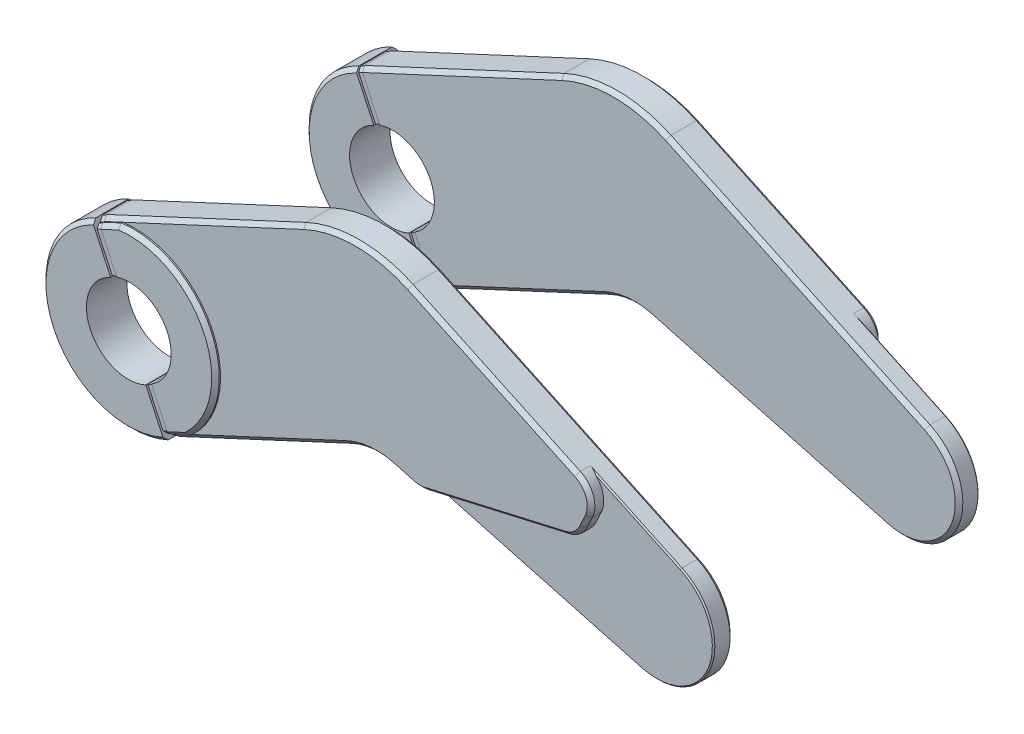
ISO-10303-21;
HEADER;
FILE_DESCRIPTION(('STEP AP214'),'2;1');
FILE_NAME('part.step','',(''),(''),'','','');
FILE_SCHEMA(('AUTOMOTIVE_DESIGN { 1 0 10303 214 1 1 1 1 }'));
ENDSEC;
DATA;
#1=APPLICATION_CONTEXT('core data for automotive mechanical design processes');
#2=APPLICATION_PROTOCOL_DEFINITION('international standard','automotive_design',2000,#1);
#3=PRODUCT_CONTEXT('',#1,'mechanical');
#4=PRODUCT('Part','Part','',(#3));
#5=PRODUCT_RELATED_PRODUCT_CATEGORY('part','',(#4));
#6=PRODUCT_DEFINITION_FORMATION('','',#4);
#7=PRODUCT_DEFINITION_CONTEXT('part definition',#1,'design');
#8=PRODUCT_DEFINITION('design','',#6,#7);
#9=PRODUCT_DEFINITION_SHAPE('','',#8);
#10=(LENGTH_UNIT() NAMED_UNIT(*) SI_UNIT(.MILLI.,.METRE.));
#11=(NAMED_UNIT(*) PLANE_ANGLE_UNIT() SI_UNIT($,.RADIAN.));
#12=(NAMED_UNIT(*) SI_UNIT($,.STERADIAN.) SOLID_ANGLE_UNIT());
#13=UNCERTAINTY_MEASURE_WITH_UNIT(LENGTH_MEASURE(1.E-05),#10,'distance_accuracy_value','');
#14=(GEOMETRIC_REPRESENTATION_CONTEXT(3) GLOBAL_UNCERTAINTY_ASSIGNED_CONTEXT((#13)) GLOBAL_UNIT_ASSIGNED_CONTEXT((#10,
#11,#12)) REPRESENTATION_CONTEXT('',''));
#15=CARTESIAN_POINT('',(0.,0.,0.));
#16=DIRECTION('',(0.,0.,1.));
#17=DIRECTION('',(1.,0.,0.));
#18=AXIS2_PLACEMENT_3D('',#15,#16,#17);
#19=CARTESIAN_POINT('',(6.96176450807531,-14.9594062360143,-44.));
#20=DIRECTION('',(0.906630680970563,0.421925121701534,0.));
#21=DIRECTION('',(0.421925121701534,-0.906630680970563,0.));
#22=AXIS2_PLACEMENT_3D('',#19,#20,#21);
#23=PLANE('',#22);
#24=DIRECTION('',(0.,0.,-1.));
#25=VECTOR('',#24,1.);
#26=CARTESIAN_POINT('',(14.3454541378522,-30.8254431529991,-44.));
#27=LINE('',#26,#25);
#28=CARTESIAN_POINT('',(14.3454541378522,-30.8254431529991,-45.5));
#29=VERTEX_POINT('',#28);
#30=CARTESIAN_POINT('',(14.3454541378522,-30.8254431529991,-58.5));
#31=VERTEX_POINT('',#30);
#32=EDGE_CURVE('P0_E1013',#29,#31,#27,.T.);
#33=ORIENTED_EDGE('',*,*,#32,.T.);
#34=DIRECTION('',(-0.298346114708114,0.641084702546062,-0.707106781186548));
#35=VECTOR('',#34,1.);
#36=CARTESIAN_POINT('',(0.,0.,-92.5));
#37=LINE('',#36,#35);
#38=CARTESIAN_POINT('',(13.7125664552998,-29.4654971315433,-60.));
#39=VERTEX_POINT('',#38);
#40=EDGE_CURVE('P0_E992',#31,#39,#37,.T.);
#41=ORIENTED_EDGE('',*,*,#40,.T.);
#42=DIRECTION('',(0.421925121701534,-0.906630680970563,0.));
#43=VECTOR('',#42,1.);
#44=CARTESIAN_POINT('',(6.96176450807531,-14.9594062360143,-60.));
#45=LINE('',#44,#43);
#46=CARTESIAN_POINT('',(6.96176450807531,-14.9594062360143,-60.));
#47=VERTEX_POINT('',#46);
#48=EDGE_CURVE('P0_E1079',#47,#39,#45,.T.);
#49=ORIENTED_EDGE('',*,*,#48,.F.);
#50=DIRECTION('',(0.,0.,-1.));
#51=VECTOR('',#50,1.);
#52=CARTESIAN_POINT('',(6.96176450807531,-14.9594062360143,-44.));
#53=LINE('',#52,#51);
#54=CARTESIAN_POINT('',(6.96176450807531,-14.9594062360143,-44.));
#55=VERTEX_POINT('',#54);
#56=EDGE_CURVE('P0_E1024',#55,#47,#53,.T.);
#57=ORIENTED_EDGE('',*,*,#56,.F.);
#58=DIRECTION('',(0.421925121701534,-0.906630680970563,0.));
#59=VECTOR('',#58,1.);
#60=CARTESIAN_POINT('',(6.96176450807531,-14.9594062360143,-44.));
#61=LINE('',#60,#59);
#62=CARTESIAN_POINT('',(13.7125664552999,-29.4654971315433,-44.));
#63=VERTEX_POINT('',#62);
#64=EDGE_CURVE('P0_E1094',#55,#63,#61,.T.);
#65=ORIENTED_EDGE('',*,*,#64,.T.);
#66=DIRECTION('',(0.298346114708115,-0.641084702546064,-0.707106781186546));
#67=VECTOR('',#66,1.);
#68=CARTESIAN_POINT('',(0.,0.,-11.5000000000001));
#69=LINE('',#68,#67);
#70=EDGE_CURVE('P0_E997',#63,#29,#69,.T.);
#71=ORIENTED_EDGE('',*,*,#70,.T.);
#72=EDGE_LOOP('',(#33,#41,#49,#57,#65,#71));
#73=FACE_BOUND('',#72,.T.);
#74=DIRECTION('',(-0.298346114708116,0.641084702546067,0.707106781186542));
#75=VECTOR('',#74,1.);
#76=CARTESIAN_POINT('',(10.1570976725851,-21.8255228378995,-36.4267766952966));
#77=LINE('',#76,#75);
#78=CARTESIAN_POINT('',(14.2399728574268,-30.5987854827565,-46.1035533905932));
#79=VERTEX_POINT('',#78);
#80=CARTESIAN_POINT('',(13.6688746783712,-29.3716124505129,-44.75));
#81=VERTEX_POINT('',#80);
#82=EDGE_CURVE('P0_E481',#79,#81,#77,.T.);
#83=ORIENTED_EDGE('',*,*,#82,.T.);
#84=DIRECTION('',(-0.421925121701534,0.906630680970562,0.));
#85=VECTOR('',#84,1.);
#86=CARTESIAN_POINT('',(6.96176450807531,-14.9594062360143,-44.75));
#87=LINE('',#86,#85);
#88=CARTESIAN_POINT('',(7.01591410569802,-15.075762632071,-44.75));
#89=VERTEX_POINT('',#88);
#90=EDGE_CURVE('P0_E450',#81,#89,#87,.T.);
#91=ORIENTED_EDGE('',*,*,#90,.T.);
#92=DIRECTION('',(0.,0.,-1.));
#93=VECTOR('',#92,1.);
#94=CARTESIAN_POINT('',(7.01591410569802,-15.075762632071,-44.));
#95=LINE('',#94,#93);
#96=CARTESIAN_POINT('',(7.01591410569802,-15.075762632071,-59.25));
#97=VERTEX_POINT('',#96);
#98=EDGE_CURVE('P0_E498',#89,#97,#95,.T.);
#99=ORIENTED_EDGE('',*,*,#98,.T.);
#100=DIRECTION('',(0.421925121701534,-0.906630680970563,0.));
#101=VECTOR('',#100,1.);
#102=CARTESIAN_POINT('',(6.96176450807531,-14.9594062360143,-59.25));
#103=LINE('',#102,#101);
#104=CARTESIAN_POINT('',(13.0359869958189,-28.011666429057,-59.25));
#105=VERTEX_POINT('',#104);
#106=EDGE_CURVE('P0_E495',#97,#105,#103,.T.);
#107=ORIENTED_EDGE('',*,*,#106,.T.);
#108=DIRECTION('',(0.298346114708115,-0.641084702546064,0.707106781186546));
#109=VECTOR('',#108,1.);
#110=CARTESIAN_POINT('',(13.2160548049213,-28.3985952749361,-58.8232233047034));
#111=LINE('',#110,#109);
#112=CARTESIAN_POINT('',(13.6070851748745,-29.2388394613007,-57.8964466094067));
#113=VERTEX_POINT('',#112);
#114=EDGE_CURVE('P0_E492',#105,#113,#111,.T.);
#115=ORIENTED_EDGE('',*,*,#114,.T.);
#116=DIRECTION('',(0.,0.,1.));
#117=VECTOR('',#116,1.);
#118=CARTESIAN_POINT('',(13.6070851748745,-29.2388394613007,-44.));
#119=LINE('',#118,#117);
#120=CARTESIAN_POINT('',(13.6070851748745,-29.2388394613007,-57.3964466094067));
#121=VERTEX_POINT('',#120);
#122=EDGE_CURVE('P0_E489',#113,#121,#119,.T.);
#123=ORIENTED_EDGE('',*,*,#122,.T.);
#124=DIRECTION('',(0.29834611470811,-0.641084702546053,0.707106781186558));
#125=VECTOR('',#124,1.);
#126=CARTESIAN_POINT('',(13.110573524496,-28.1719376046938,-58.5732233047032));
#127=LINE('',#126,#125);
#128=CARTESIAN_POINT('',(14.2399728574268,-30.5987854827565,-55.8964466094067));
#129=VERTEX_POINT('',#128);
#130=EDGE_CURVE('P0_E486',#121,#129,#127,.T.);
#131=ORIENTED_EDGE('',*,*,#130,.T.);
#132=DIRECTION('',(0.,0.,1.));
#133=VECTOR('',#132,1.);
#134=CARTESIAN_POINT('',(14.2399728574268,-30.5987854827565,-44.));
#135=LINE('',#134,#133);
#136=EDGE_CURVE('P0_E483',#129,#79,#135,.T.);
#137=ORIENTED_EDGE('',*,*,#136,.T.);
#138=EDGE_LOOP('',(#83,#91,#99,#107,#115,#123,#131,#137));
#139=FACE_BOUND('',#138,.T.);
#140=ADVANCED_FACE('P0_F17',(#73,#139),#23,.T.);
#141=CARTESIAN_POINT('',(16.1587154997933,-29.9815929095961,-44.5));
#142=DIRECTION('',(0.906630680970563,0.421925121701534,0.));
#143=DIRECTION('',(-0.421925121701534,0.906630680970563,0.));
#144=AXIS2_PLACEMENT_3D('',#141,#142,#143);
#145=PLANE('',#144);
#146=DIRECTION('',(0.,0.,-1.));
#147=VECTOR('',#146,1.);
#148=CARTESIAN_POINT('',(8.72369418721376,-14.0052547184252,-59.5));
#149=LINE('',#148,#147);
#150=CARTESIAN_POINT('',(8.72369418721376,-14.0052547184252,-44.5));
#151=VERTEX_POINT('',#150);
#152=CARTESIAN_POINT('',(8.72369418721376,-14.0052547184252,-59.5));
#153=VERTEX_POINT('',#152);
#154=EDGE_CURVE('P0_E532',#151,#153,#149,.T.);
#155=ORIENTED_EDGE('',*,*,#154,.T.);
#156=DIRECTION('',(-0.421925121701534,0.906630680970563,0.));
#157=VECTOR('',#156,1.);
#158=CARTESIAN_POINT('',(16.1587154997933,-29.9815929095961,-59.5));
#159=LINE('',#158,#157);
#160=CARTESIAN_POINT('',(14.8929401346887,-27.2617008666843,-59.5));
#161=VERTEX_POINT('',#160);
#162=EDGE_CURVE('P0_E527',#161,#153,#159,.T.);
#163=ORIENTED_EDGE('',*,*,#162,.F.);
#164=DIRECTION('',(-0.298346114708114,0.641084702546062,-0.707106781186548));
#165=VECTOR('',#164,1.);
#166=CARTESIAN_POINT('',(14.8929401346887,-27.2617008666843,-59.5));
#167=LINE('',#166,#165);
#168=CARTESIAN_POINT('',(15.525827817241,-28.6216468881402,-57.9999999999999));
#169=VERTEX_POINT('',#168);
#170=EDGE_CURVE('P0_E671',#169,#161,#167,.T.);
#171=ORIENTED_EDGE('',*,*,#170,.F.);
#172=DIRECTION('',(0.,0.,-1.));
#173=VECTOR('',#172,1.);
#174=CARTESIAN_POINT('',(15.525827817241,-28.6216468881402,-44.5));
#175=LINE('',#174,#173);
#176=CARTESIAN_POINT('',(15.525827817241,-28.6216468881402,-57.5));
#177=VERTEX_POINT('',#176);
#178=EDGE_CURVE('P0_E620',#177,#169,#175,.T.);
#179=ORIENTED_EDGE('',*,*,#178,.F.);
#180=DIRECTION('',(0.298346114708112,-0.641084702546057,0.707106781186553));
#181=VECTOR('',#180,1.);
#182=CARTESIAN_POINT('',(15.525827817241,-28.6216468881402,-57.5));
#183=LINE('',#182,#181);
#184=CARTESIAN_POINT('',(16.1587154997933,-29.9815929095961,-56.));
#185=VERTEX_POINT('',#184);
#186=EDGE_CURVE('P0_E667',#185,#177,#183,.F.);
#187=ORIENTED_EDGE('',*,*,#186,.F.);
#188=DIRECTION('',(0.,0.,-1.));
#189=VECTOR('',#188,1.);
#190=CARTESIAN_POINT('',(16.1587154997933,-29.9815929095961,-44.5));
#191=LINE('',#190,#189);
#192=CARTESIAN_POINT('',(16.1587154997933,-29.9815929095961,-46.));
#193=VERTEX_POINT('',#192);
#194=EDGE_CURVE('P0_E523',#193,#185,#191,.T.);
#195=ORIENTED_EDGE('',*,*,#194,.F.);
#196=DIRECTION('',(0.298346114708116,-0.641084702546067,-0.707106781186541));
#197=VECTOR('',#196,1.);
#198=CARTESIAN_POINT('',(16.1587154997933,-29.9815929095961,-46.));
#199=LINE('',#198,#197);
#200=CARTESIAN_POINT('',(15.525827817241,-28.6216468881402,-44.5));
#201=VERTEX_POINT('',#200);
#202=EDGE_CURVE('P0_E663',#201,#193,#199,.T.);
#203=ORIENTED_EDGE('',*,*,#202,.F.);
#204=DIRECTION('',(-0.421925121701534,0.906630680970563,0.));
#205=VECTOR('',#204,1.);
#206=CARTESIAN_POINT('',(16.1587154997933,-29.9815929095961,-44.5));
#207=LINE('',#206,#205);
#208=EDGE_CURVE('P0_E519',#201,#151,#207,.T.);
#209=ORIENTED_EDGE('',*,*,#208,.T.);
#210=EDGE_LOOP('',(#155,#163,#171,#179,#187,#195,#203,#209));
#211=FACE_BOUND('',#210,.T.);
#212=DIRECTION('',(-0.421925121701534,0.906630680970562,0.));
#213=VECTOR('',#212,1.);
#214=CARTESIAN_POINT('',(15.4821360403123,-28.5277622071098,-44.75));
#215=LINE('',#214,#213);
#216=CARTESIAN_POINT('',(15.4821360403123,-28.5277622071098,-44.75));
#217=VERTEX_POINT('',#216);
#218=CARTESIAN_POINT('',(8.82917546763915,-14.2319123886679,-44.75));
#219=VERTEX_POINT('',#218);
#220=EDGE_CURVE('P0_E441',#217,#219,#215,.T.);
#221=ORIENTED_EDGE('',*,*,#220,.F.);
#222=DIRECTION('',(-0.298346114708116,0.641084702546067,0.707106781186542));
#223=VECTOR('',#222,1.);
#224=CARTESIAN_POINT('',(16.0532342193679,-29.7549352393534,-46.1035533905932));
#225=LINE('',#224,#223);
#226=CARTESIAN_POINT('',(16.0532342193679,-29.7549352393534,-46.1035533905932));
#227=VERTEX_POINT('',#226);
#228=EDGE_CURVE('P0_E443',#227,#217,#225,.T.);
#229=ORIENTED_EDGE('',*,*,#228,.F.);
#230=DIRECTION('',(0.,0.,1.));
#231=VECTOR('',#230,1.);
#232=CARTESIAN_POINT('',(16.0532342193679,-29.7549352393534,-55.8964466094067));
#233=LINE('',#232,#231);
#234=CARTESIAN_POINT('',(16.0532342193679,-29.7549352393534,-55.8964466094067));
#235=VERTEX_POINT('',#234);
#236=EDGE_CURVE('P0_E457',#235,#227,#233,.T.);
#237=ORIENTED_EDGE('',*,*,#236,.F.);
#238=DIRECTION('',(0.29834611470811,-0.641084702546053,0.707106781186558));
#239=VECTOR('',#238,1.);
#240=CARTESIAN_POINT('',(15.4203465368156,-28.3949892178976,-57.3964466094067));
#241=LINE('',#240,#239);
#242=CARTESIAN_POINT('',(15.4203465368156,-28.3949892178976,-57.3964466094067));
#243=VERTEX_POINT('',#242);
#244=EDGE_CURVE('P0_E459',#243,#235,#241,.T.);
#245=ORIENTED_EDGE('',*,*,#244,.F.);
#246=DIRECTION('',(0.,0.,1.));
#247=VECTOR('',#246,1.);
#248=CARTESIAN_POINT('',(15.4203465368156,-28.3949892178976,-57.8964466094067));
#249=LINE('',#248,#247);
#250=CARTESIAN_POINT('',(15.4203465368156,-28.3949892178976,-57.8964466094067));
#251=VERTEX_POINT('',#250);
#252=EDGE_CURVE('P0_E2751',#251,#243,#249,.T.);
#253=ORIENTED_EDGE('',*,*,#252,.F.);
#254=DIRECTION('',(0.298346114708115,-0.641084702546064,0.707106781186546));
#255=VECTOR('',#254,1.);
#256=CARTESIAN_POINT('',(14.84924835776,-27.1678161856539,-59.25));
#257=LINE('',#256,#255);
#258=CARTESIAN_POINT('',(14.84924835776,-27.1678161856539,-59.25));
#259=VERTEX_POINT('',#258);
#260=EDGE_CURVE('P0_E2755',#259,#251,#257,.T.);
#261=ORIENTED_EDGE('',*,*,#260,.F.);
#262=DIRECTION('',(0.421925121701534,-0.906630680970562,0.));
#263=VECTOR('',#262,1.);
#264=CARTESIAN_POINT('',(8.82917546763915,-14.2319123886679,-59.25));
#265=LINE('',#264,#263);
#266=CARTESIAN_POINT('',(8.82917546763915,-14.2319123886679,-59.25));
#267=VERTEX_POINT('',#266);
#268=EDGE_CURVE('P0_E2757',#267,#259,#265,.T.);
#269=ORIENTED_EDGE('',*,*,#268,.F.);
#270=DIRECTION('',(0.,0.,-1.));
#271=VECTOR('',#270,1.);
#272=CARTESIAN_POINT('',(8.82917546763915,-14.2319123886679,-44.75));
#273=LINE('',#272,#271);
#274=EDGE_CURVE('P0_E40',#219,#267,#273,.T.);
#275=ORIENTED_EDGE('',*,*,#274,.F.);
#276=EDGE_LOOP('',(#221,#229,#237,#245,#253,#261,#269,#275));
#277=FACE_BOUND('',#276,.T.);
#278=ADVANCED_FACE('P0_F442',(#211,#277),#145,.F.);
#279=CARTESIAN_POINT('',(-14.3454541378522,30.8254431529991,-44.));
#280=DIRECTION('',(0.906630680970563,0.421925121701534,0.));
#281=DIRECTION('',(0.421925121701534,-0.906630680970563,0.));
#282=AXIS2_PLACEMENT_3D('',#279,#280,#281);
#283=PLANE('',#282);
#284=DIRECTION('',(0.421925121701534,-0.906630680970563,0.));
#285=VECTOR('',#284,1.);
#286=CARTESIAN_POINT('',(-14.3454541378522,30.8254431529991,-60.));
#287=LINE('',#286,#285);
#288=CARTESIAN_POINT('',(-13.7125664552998,29.4654971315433,-60.));
#289=VERTEX_POINT('',#288);
#290=CARTESIAN_POINT('',(-6.96176450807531,14.9594062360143,-60.));
#291=VERTEX_POINT('',#290);
#292=EDGE_CURVE('P0_E1007',#289,#291,#287,.T.);
#293=ORIENTED_EDGE('',*,*,#292,.F.);
#294=DIRECTION('',(-0.298346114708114,0.641084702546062,0.707106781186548));
#295=VECTOR('',#294,1.);
#296=CARTESIAN_POINT('',(0.,0.,-92.5));
#297=LINE('',#296,#295);
#298=CARTESIAN_POINT('',(-14.3454541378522,30.8254431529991,-58.5));
#299=VERTEX_POINT('',#298);
#300=EDGE_CURVE('P0_E990',#289,#299,#297,.T.);
#301=ORIENTED_EDGE('',*,*,#300,.T.);
#302=DIRECTION('',(0.,0.,-1.));
#303=VECTOR('',#302,1.);
#304=CARTESIAN_POINT('',(-14.3454541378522,30.8254431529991,-44.));
#305=LINE('',#304,#303);
#306=CARTESIAN_POINT('',(-14.3454541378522,30.8254431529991,-45.5));
#307=VERTEX_POINT('',#306);
#308=EDGE_CURVE('P0_E1004',#307,#299,#305,.T.);
#309=ORIENTED_EDGE('',*,*,#308,.F.);
#310=DIRECTION('',(0.298346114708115,-0.641084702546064,0.707106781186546));
#311=VECTOR('',#310,1.);
#312=CARTESIAN_POINT('',(0.,0.,-11.5000000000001));
#313=LINE('',#312,#311);
#314=CARTESIAN_POINT('',(-13.7125664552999,29.4654971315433,-44.));
#315=VERTEX_POINT('',#314);
#316=EDGE_CURVE('P0_E1009',#307,#315,#313,.T.);
#317=ORIENTED_EDGE('',*,*,#316,.T.);
#318=DIRECTION('',(0.421925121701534,-0.906630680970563,0.));
#319=VECTOR('',#318,1.);
#320=CARTESIAN_POINT('',(-14.3454541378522,30.8254431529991,-44.));
#321=LINE('',#320,#319);
#322=CARTESIAN_POINT('',(-6.96176450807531,14.9594062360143,-44.));
#323=VERTEX_POINT('',#322);
#324=EDGE_CURVE('P0_E1030',#315,#323,#321,.T.);
#325=ORIENTED_EDGE('',*,*,#324,.T.);
#326=DIRECTION('',(0.,0.,-1.));
#327=VECTOR('',#326,1.);
#328=CARTESIAN_POINT('',(-6.96176450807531,14.9594062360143,-44.));
#329=LINE('',#328,#327);
#330=EDGE_CURVE('P0_E1012',#323,#291,#329,.T.);
#331=ORIENTED_EDGE('',*,*,#330,.T.);
#332=EDGE_LOOP('',(#293,#301,#309,#317,#325,#331));
#333=FACE_BOUND('',#332,.T.);
#334=DIRECTION('',(0.298346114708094,-0.641084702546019,-0.707106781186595));
#335=VECTOR('',#334,1.);
#336=CARTESIAN_POINT('',(-16.8024183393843,36.1049560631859,-49.8232233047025));
#337=LINE('',#336,#335);
#338=CARTESIAN_POINT('',(-14.2399728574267,30.5987854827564,-55.8964466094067));
#339=VERTEX_POINT('',#338);
#340=CARTESIAN_POINT('',(-13.6070851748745,29.2388394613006,-57.3964466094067));
#341=VERTEX_POINT('',#340);
#342=EDGE_CURVE('P0_E1043',#339,#341,#337,.T.);
#343=ORIENTED_EDGE('',*,*,#342,.T.);
#344=DIRECTION('',(0.,0.,-1.));
#345=VECTOR('',#344,1.);
#346=CARTESIAN_POINT('',(-13.6070851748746,29.238839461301,-43.9999999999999));
#347=LINE('',#346,#345);
#348=CARTESIAN_POINT('',(-13.6070851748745,29.2388394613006,-57.8964466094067));
#349=VERTEX_POINT('',#348);
#350=EDGE_CURVE('P0_E11',#341,#349,#347,.T.);
#351=ORIENTED_EDGE('',*,*,#350,.T.);
#352=DIRECTION('',(0.298346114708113,-0.641084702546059,-0.707106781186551));
#353=VECTOR('',#352,1.);
#354=CARTESIAN_POINT('',(-16.9078996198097,36.3316137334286,-50.0732233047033));
#355=LINE('',#354,#353);
#356=CARTESIAN_POINT('',(-13.0359869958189,28.011666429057,-59.25));
#357=VERTEX_POINT('',#356);
#358=EDGE_CURVE('P0_E25',#349,#357,#355,.T.);
#359=ORIENTED_EDGE('',*,*,#358,.T.);
#360=DIRECTION('',(0.421925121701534,-0.906630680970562,0.));
#361=VECTOR('',#360,1.);
#362=CARTESIAN_POINT('',(-14.3454541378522,30.8254431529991,-59.25));
#363=LINE('',#362,#361);
#364=CARTESIAN_POINT('',(-7.01591410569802,15.075762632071,-59.25));
#365=VERTEX_POINT('',#364);
#366=EDGE_CURVE('P0_E1058',#357,#365,#363,.T.);
#367=ORIENTED_EDGE('',*,*,#366,.T.);
#368=DIRECTION('',(0.,0.,1.));
#369=VECTOR('',#368,1.);
#370=CARTESIAN_POINT('',(-7.01591410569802,15.075762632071,-44.));
#371=LINE('',#370,#369);
#372=CARTESIAN_POINT('',(-7.01591410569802,15.075762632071,-44.75));
#373=VERTEX_POINT('',#372);
#374=EDGE_CURVE('P0_E1055',#365,#373,#371,.T.);
#375=ORIENTED_EDGE('',*,*,#374,.T.);
#376=DIRECTION('',(-0.421925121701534,0.906630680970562,0.));
#377=VECTOR('',#376,1.);
#378=CARTESIAN_POINT('',(-14.3454541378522,30.8254431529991,-44.75));
#379=LINE('',#378,#377);
#380=CARTESIAN_POINT('',(-13.6688746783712,29.3716124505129,-44.75));
#381=VERTEX_POINT('',#380);
#382=EDGE_CURVE('P0_E1052',#373,#381,#379,.T.);
#383=ORIENTED_EDGE('',*,*,#382,.T.);
#384=DIRECTION('',(-0.298346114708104,0.641084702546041,-0.707106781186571));
#385=VECTOR('',#384,1.);
#386=CARTESIAN_POINT('',(-13.8489424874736,29.758541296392,-45.1767766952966));
#387=LINE('',#386,#385);
#388=CARTESIAN_POINT('',(-14.2399728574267,30.5987854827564,-46.1035533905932));
#389=VERTEX_POINT('',#388);
#390=EDGE_CURVE('P0_E1049',#381,#389,#387,.T.);
#391=ORIENTED_EDGE('',*,*,#390,.T.);
#392=DIRECTION('',(0.,0.,-1.));
#393=VECTOR('',#392,1.);
#394=CARTESIAN_POINT('',(-14.2399728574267,30.5987854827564,-44.));
#395=LINE('',#394,#393);
#396=EDGE_CURVE('P0_E1046',#389,#339,#395,.T.);
#397=ORIENTED_EDGE('',*,*,#396,.T.);
#398=EDGE_LOOP('',(#343,#351,#359,#367,#375,#383,#391,#397));
#399=FACE_BOUND('',#398,.T.);
#400=ADVANCED_FACE('P0_F963',(#333,#399),#283,.T.);
#401=CARTESIAN_POINT('',(0.,0.,-44.));
#402=DIRECTION('',(0.,0.,-1.));
#403=DIRECTION('',(-0.906630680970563,-0.421925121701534,0.));
#404=AXIS2_PLACEMENT_3D('',#401,#402,#403);
#405=PLANE('',#404);
#406=ORIENTED_EDGE('',*,*,#324,.F.);
#407=CARTESIAN_POINT('',(0.,0.,-44.));
#408=DIRECTION('',(0.,0.,-1.));
#409=DIRECTION('',(-0.906630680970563,-0.421925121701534,0.));
#410=AXIS2_PLACEMENT_3D('',#407,#408,#409);
#411=CIRCLE('',#410,32.5);
#412=EDGE_CURVE('P0_E1040',#315,#63,#411,.F.);
#413=ORIENTED_EDGE('',*,*,#412,.T.);
#414=ORIENTED_EDGE('',*,*,#64,.F.);
#415=CARTESIAN_POINT('',(0.,0.,-44.));
#416=DIRECTION('',(0.,0.,1.));
#417=DIRECTION('',(-0.906630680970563,-0.421925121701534,0.));
#418=AXIS2_PLACEMENT_3D('',#415,#416,#417);
#419=CIRCLE('',#418,16.5);
#420=EDGE_CURVE('P0_E1090',#323,#55,#419,.T.);
#421=ORIENTED_EDGE('',*,*,#420,.F.);
#422=EDGE_LOOP('',(#406,#413,#414,#421));
#423=FACE_BOUND('',#422,.T.);
#424=ADVANCED_FACE('P0_F1108',(#423),#405,.F.);
#425=CARTESIAN_POINT('',(0.,0.,-44.));
#426=DIRECTION('',(0.,0.,-1.));
#427=DIRECTION('',(-0.906630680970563,-0.421925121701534,0.));
#428=AXIS2_PLACEMENT_3D('',#425,#426,#427);
#429=CYLINDRICAL_SURFACE('',#428,34.);
#430=ORIENTED_EDGE('',*,*,#308,.T.);
#431=CARTESIAN_POINT('',(0.,0.,-58.5));
#432=DIRECTION('',(0.,0.,-1.));
#433=DIRECTION('',(-0.906630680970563,-0.421925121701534,0.));
#434=AXIS2_PLACEMENT_3D('',#431,#432,#433);
#435=CIRCLE('',#434,34.);
#436=EDGE_CURVE('P0_E987',#299,#31,#435,.F.);
#437=ORIENTED_EDGE('',*,*,#436,.T.);
#438=ORIENTED_EDGE('',*,*,#32,.F.);
#439=CARTESIAN_POINT('',(0.,0.,-45.5));
#440=DIRECTION('',(0.,0.,-1.));
#441=DIRECTION('',(-0.906630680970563,-0.421925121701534,0.));
#442=AXIS2_PLACEMENT_3D('',#439,#440,#441);
#443=CIRCLE('',#442,34.);
#444=EDGE_CURVE('P0_E998',#29,#307,#443,.T.);
#445=ORIENTED_EDGE('',*,*,#444,.T.);
#446=EDGE_LOOP('',(#430,#437,#438,#445));
#447=FACE_BOUND('',#446,.T.);
#448=ADVANCED_FACE('P0_F969',(#447),#429,.T.);
#449=CARTESIAN_POINT('',(0.,0.,-44.));
#450=DIRECTION('',(0.,0.,-1.));
#451=DIRECTION('',(-0.906630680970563,-0.421925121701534,0.));
#452=AXIS2_PLACEMENT_3D('',#449,#450,#451);
#453=CYLINDRICAL_SURFACE('',#452,16.5);
#454=ORIENTED_EDGE('',*,*,#56,.T.);
#455=CARTESIAN_POINT('',(0.,0.,-60.));
#456=DIRECTION('',(0.,0.,1.));
#457=DIRECTION('',(-0.906630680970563,-0.421925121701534,0.));
#458=AXIS2_PLACEMENT_3D('',#455,#456,#457);
#459=CIRCLE('',#458,16.5);
#460=EDGE_CURVE('P0_E1075',#291,#47,#459,.T.);
#461=ORIENTED_EDGE('',*,*,#460,.F.);
#462=ORIENTED_EDGE('',*,*,#330,.F.);
#463=ORIENTED_EDGE('',*,*,#420,.T.);
#464=EDGE_LOOP('',(#454,#461,#462,#463));
#465=FACE_BOUND('',#464,.T.);
#466=ADVANCED_FACE('P0_F971',(#465),#453,.F.);
#467=CARTESIAN_POINT('',(0.,0.,-60.));
#468=DIRECTION('',(0.,0.,-1.));
#469=DIRECTION('',(-0.906630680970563,-0.421925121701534,0.));
#470=AXIS2_PLACEMENT_3D('',#467,#468,#469);
#471=PLANE('',#470);
#472=ORIENTED_EDGE('',*,*,#48,.T.);
#473=CARTESIAN_POINT('',(0.,0.,-60.));
#474=DIRECTION('',(0.,0.,-1.));
#475=DIRECTION('',(-0.906630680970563,-0.421925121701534,0.));
#476=AXIS2_PLACEMENT_3D('',#473,#474,#475);
#477=CIRCLE('',#476,32.5);
#478=EDGE_CURVE('P0_E1021',#39,#289,#477,.T.);
#479=ORIENTED_EDGE('',*,*,#478,.T.);
#480=ORIENTED_EDGE('',*,*,#292,.T.);
#481=ORIENTED_EDGE('',*,*,#460,.T.);
#482=EDGE_LOOP('',(#472,#479,#480,#481));
#483=FACE_BOUND('',#482,.T.);
#484=ADVANCED_FACE('P0_F973',(#483),#471,.T.);
#485=CARTESIAN_POINT('',(0.,0.,-60.));
#486=DIRECTION('',(0.,0.,1.));
#487=DIRECTION('',(0.906630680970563,0.421925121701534,0.));
#488=AXIS2_PLACEMENT_3D('',#485,#486,#487);
#489=CONICAL_SURFACE('',#488,32.5,0.785398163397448);
#490=ORIENTED_EDGE('',*,*,#436,.F.);
#491=ORIENTED_EDGE('',*,*,#300,.F.);
#492=ORIENTED_EDGE('',*,*,#478,.F.);
#493=ORIENTED_EDGE('',*,*,#40,.F.);
#494=EDGE_LOOP('',(#490,#491,#492,#493));
#495=FACE_BOUND('',#494,.T.);
#496=ADVANCED_FACE('P0_F975',(#495),#489,.T.);
#497=CARTESIAN_POINT('',(0.,0.,-45.5));
#498=DIRECTION('',(0.,0.,-1.));
#499=DIRECTION('',(-0.906630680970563,-0.421925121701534,0.));
#500=AXIS2_PLACEMENT_3D('',#497,#498,#499);
#501=CONICAL_SURFACE('',#500,34.,0.785398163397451);
#502=ORIENTED_EDGE('',*,*,#70,.F.);
#503=ORIENTED_EDGE('',*,*,#412,.F.);
#504=ORIENTED_EDGE('',*,*,#316,.F.);
#505=ORIENTED_EDGE('',*,*,#444,.F.);
#506=EDGE_LOOP('',(#502,#503,#504,#505));
#507=FACE_BOUND('',#506,.T.);
#508=ADVANCED_FACE('P0_F19',(#507),#501,.T.);
#509=CARTESIAN_POINT('',(-14.513715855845,28.8169143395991,-57.3964466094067));
#510=DIRECTION('',(0.421925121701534,-0.906630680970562,0.));
#511=DIRECTION('',(0.906630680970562,0.421925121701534,0.));
#512=AXIS2_PLACEMENT_3D('',#509,#510,#511);
#513=PLANE('',#512);
#514=ORIENTED_EDGE('',*,*,#350,.F.);
#515=DIRECTION('',(0.906630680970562,0.421925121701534,0.));
#516=VECTOR('',#515,1.);
#517=CARTESIAN_POINT('',(-14.513715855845,28.8169143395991,-57.3964466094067));
#518=LINE('',#517,#516);
#519=CARTESIAN_POINT('',(-11.7938238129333,30.0826897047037,-57.3964466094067));
#520=VERTEX_POINT('',#519);
#521=EDGE_CURVE('P0_E2540',#341,#520,#518,.T.);
#522=ORIENTED_EDGE('',*,*,#521,.T.);
#523=DIRECTION('',(0.,0.,-1.));
#524=VECTOR('',#523,1.);
#525=CARTESIAN_POINT('',(-11.7938238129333,30.0826897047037,-57.3964466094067));
#526=LINE('',#525,#524);
#527=CARTESIAN_POINT('',(-11.7938238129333,30.0826897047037,-57.8964466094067));
#528=VERTEX_POINT('',#527);
#529=EDGE_CURVE('P0_E1074',#520,#528,#526,.T.);
#530=ORIENTED_EDGE('',*,*,#529,.T.);
#531=DIRECTION('',(0.906630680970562,0.421925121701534,0.));
#532=VECTOR('',#531,1.);
#533=CARTESIAN_POINT('',(-14.513715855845,28.8169143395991,-57.8964466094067));
#534=LINE('',#533,#532);
#535=EDGE_CURVE('P0_E1068',#349,#528,#534,.T.);
#536=ORIENTED_EDGE('',*,*,#535,.F.);
#537=EDGE_LOOP('',(#514,#522,#530,#536));
#538=FACE_BOUND('',#537,.T.);
#539=ADVANCED_FACE('P0_F982',(#538),#513,.F.);
#540=CARTESIAN_POINT('',(-14.513715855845,28.8169143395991,-57.8964466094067));
#541=DIRECTION('',(0.298346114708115,-0.641084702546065,0.707106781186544));
#542=DIRECTION('',(0.,-0.740846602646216,-0.671674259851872));
#543=AXIS2_PLACEMENT_3D('',#540,#541,#542);
#544=PLANE('',#543);
#545=ORIENTED_EDGE('',*,*,#358,.F.);
#546=ORIENTED_EDGE('',*,*,#535,.T.);
#547=DIRECTION('',(0.298346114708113,-0.641084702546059,-0.707106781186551));
#548=VECTOR('',#547,1.);
#549=CARTESIAN_POINT('',(-11.7938238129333,30.0826897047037,-57.8964466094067));
#550=LINE('',#549,#548);
#551=CARTESIAN_POINT('',(-11.2227256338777,28.8555166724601,-59.25));
#552=VERTEX_POINT('',#551);
#553=EDGE_CURVE('P0_E2518',#528,#552,#550,.T.);
#554=ORIENTED_EDGE('',*,*,#553,.T.);
#555=DIRECTION('',(0.906630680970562,0.421925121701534,0.));
#556=VECTOR('',#555,1.);
#557=CARTESIAN_POINT('',(-13.9426176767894,27.5897413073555,-59.25));
#558=LINE('',#557,#556);
#559=EDGE_CURVE('P0_E1071',#357,#552,#558,.T.);
#560=ORIENTED_EDGE('',*,*,#559,.F.);
#561=EDGE_LOOP('',(#545,#546,#554,#560));
#562=FACE_BOUND('',#561,.T.);
#563=ADVANCED_FACE('P0_F1066',(#562),#544,.F.);
#564=CARTESIAN_POINT('',(-13.9426176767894,27.5897413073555,-59.25));
#565=DIRECTION('',(0.,0.,1.));
#566=DIRECTION('',(1.,0.,0.));
#567=AXIS2_PLACEMENT_3D('',#564,#565,#566);
#568=PLANE('',#567);
#569=ORIENTED_EDGE('',*,*,#366,.F.);
#570=ORIENTED_EDGE('',*,*,#559,.T.);
#571=DIRECTION('',(0.421925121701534,-0.906630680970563,0.));
#572=VECTOR('',#571,1.);
#573=CARTESIAN_POINT('',(-11.2227256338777,28.8555166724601,-59.25));
#574=LINE('',#573,#572);
#575=CARTESIAN_POINT('',(-5.2026527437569,15.919612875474,-59.25));
#576=VERTEX_POINT('',#575);
#577=EDGE_CURVE('P0_E2520',#552,#576,#574,.T.);
#578=ORIENTED_EDGE('',*,*,#577,.T.);
#579=DIRECTION('',(0.906630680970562,0.421925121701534,0.));
#580=VECTOR('',#579,1.);
#581=CARTESIAN_POINT('',(-7.92254478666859,14.6538375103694,-59.25));
#582=LINE('',#581,#580);
#583=EDGE_CURVE('P0_E1081',#365,#576,#582,.T.);
#584=ORIENTED_EDGE('',*,*,#583,.F.);
#585=EDGE_LOOP('',(#569,#570,#578,#584));
#586=FACE_BOUND('',#585,.T.);
#587=ADVANCED_FACE('P0_F1122',(#586),#568,.F.);
#588=CARTESIAN_POINT('',(-7.92254478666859,14.6538375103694,-59.25));
#589=DIRECTION('',(-0.421925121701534,0.906630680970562,0.));
#590=DIRECTION('',(-0.906630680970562,-0.421925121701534,0.));
#591=AXIS2_PLACEMENT_3D('',#588,#589,#590);
#592=PLANE('',#591);
#593=ORIENTED_EDGE('',*,*,#374,.F.);
#594=ORIENTED_EDGE('',*,*,#583,.T.);
#595=DIRECTION('',(0.,0.,1.));
#596=VECTOR('',#595,1.);
#597=CARTESIAN_POINT('',(-5.2026527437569,15.919612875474,-59.25));
#598=LINE('',#597,#596);
#599=CARTESIAN_POINT('',(-5.2026527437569,15.919612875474,-44.75));
#600=VERTEX_POINT('',#599);
#601=EDGE_CURVE('P0_E2522',#576,#600,#598,.T.);
#602=ORIENTED_EDGE('',*,*,#601,.T.);
#603=DIRECTION('',(0.906630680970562,0.421925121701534,0.));
#604=VECTOR('',#603,1.);
#605=CARTESIAN_POINT('',(-7.92254478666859,14.6538375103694,-44.75));
#606=LINE('',#605,#604);
#607=EDGE_CURVE('P0_E2551',#373,#600,#606,.T.);
#608=ORIENTED_EDGE('',*,*,#607,.F.);
#609=EDGE_LOOP('',(#593,#594,#602,#608));
#610=FACE_BOUND('',#609,.T.);
#611=ADVANCED_FACE('P0_F1125',(#610),#592,.F.);
#612=CARTESIAN_POINT('',(-7.92254478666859,14.6538375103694,-44.75));
#613=DIRECTION('',(0.,0.,-1.));
#614=DIRECTION('',(-1.,0.,0.));
#615=AXIS2_PLACEMENT_3D('',#612,#613,#614);
#616=PLANE('',#615);
#617=ORIENTED_EDGE('',*,*,#382,.F.);
#618=ORIENTED_EDGE('',*,*,#607,.T.);
#619=DIRECTION('',(-0.421925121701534,0.906630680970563,0.));
#620=VECTOR('',#619,1.);
#621=CARTESIAN_POINT('',(-5.2026527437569,15.919612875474,-44.75));
#622=LINE('',#621,#620);
#623=CARTESIAN_POINT('',(-11.85561331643,30.2154626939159,-44.75));
#624=VERTEX_POINT('',#623);
#625=EDGE_CURVE('P0_E2528',#600,#624,#622,.T.);
#626=ORIENTED_EDGE('',*,*,#625,.T.);
#627=DIRECTION('',(0.906630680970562,0.421925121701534,0.));
#628=VECTOR('',#627,1.);
#629=CARTESIAN_POINT('',(-14.5755053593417,28.9496873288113,-44.75));
#630=LINE('',#629,#628);
#631=EDGE_CURVE('P0_E2548',#381,#624,#630,.T.);
#632=ORIENTED_EDGE('',*,*,#631,.F.);
#633=EDGE_LOOP('',(#617,#618,#626,#632));
#634=FACE_BOUND('',#633,.T.);
#635=ADVANCED_FACE('P0_F1129',(#634),#616,.F.);
#636=CARTESIAN_POINT('',(-14.5755053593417,28.9496873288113,-44.75));
#637=DIRECTION('',(0.298346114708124,-0.641084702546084,-0.707106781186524));
#638=DIRECTION('',(0.,0.740846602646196,-0.671674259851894));
#639=AXIS2_PLACEMENT_3D('',#636,#637,#638);
#640=PLANE('',#639);
#641=ORIENTED_EDGE('',*,*,#390,.F.);
#642=ORIENTED_EDGE('',*,*,#631,.T.);
#643=DIRECTION('',(-0.298346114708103,0.641084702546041,-0.707106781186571));
#644=VECTOR('',#643,1.);
#645=CARTESIAN_POINT('',(-11.85561331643,30.2154626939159,-44.75));
#646=LINE('',#645,#644);
#647=CARTESIAN_POINT('',(-12.4267114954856,31.4426357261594,-46.1035533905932));
#648=VERTEX_POINT('',#647);
#649=EDGE_CURVE('P0_E2531',#624,#648,#646,.T.);
#650=ORIENTED_EDGE('',*,*,#649,.T.);
#651=DIRECTION('',(0.906630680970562,0.421925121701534,0.));
#652=VECTOR('',#651,1.);
#653=CARTESIAN_POINT('',(-15.1466035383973,30.1768603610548,-46.1035533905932));
#654=LINE('',#653,#652);
#655=EDGE_CURVE('P0_E2545',#389,#648,#654,.T.);
#656=ORIENTED_EDGE('',*,*,#655,.F.);
#657=EDGE_LOOP('',(#641,#642,#650,#656));
#658=FACE_BOUND('',#657,.T.);
#659=ADVANCED_FACE('P0_F1133',(#658),#640,.F.);
#660=CARTESIAN_POINT('',(-15.1466035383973,30.1768603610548,-46.1035533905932));
#661=DIRECTION('',(0.421925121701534,-0.906630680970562,0.));
#662=DIRECTION('',(0.906630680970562,0.421925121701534,0.));
#663=AXIS2_PLACEMENT_3D('',#660,#661,#662);
#664=PLANE('',#663);
#665=ORIENTED_EDGE('',*,*,#396,.F.);
#666=ORIENTED_EDGE('',*,*,#655,.T.);
#667=DIRECTION('',(0.,0.,-1.));
#668=VECTOR('',#667,1.);
#669=CARTESIAN_POINT('',(-12.4267114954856,31.4426357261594,-46.1035533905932));
#670=LINE('',#669,#668);
#671=CARTESIAN_POINT('',(-12.4267114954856,31.4426357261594,-55.8964466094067));
#672=VERTEX_POINT('',#671);
#673=EDGE_CURVE('P0_E2534',#648,#672,#670,.T.);
#674=ORIENTED_EDGE('',*,*,#673,.T.);
#675=DIRECTION('',(0.906630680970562,0.421925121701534,0.));
#676=VECTOR('',#675,1.);
#677=CARTESIAN_POINT('',(-15.1466035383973,30.1768603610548,-55.8964466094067));
#678=LINE('',#677,#676);
#679=EDGE_CURVE('P0_E2542',#339,#672,#678,.T.);
#680=ORIENTED_EDGE('',*,*,#679,.F.);
#681=EDGE_LOOP('',(#665,#666,#674,#680));
#682=FACE_BOUND('',#681,.T.);
#683=ADVANCED_FACE('P0_F1137',(#682),#664,.F.);
#684=CARTESIAN_POINT('',(-15.1466035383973,30.1768603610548,-55.8964466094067));
#685=DIRECTION('',(0.298346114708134,-0.641084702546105,0.7071067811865));
#686=DIRECTION('',(0.,-0.740846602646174,-0.671674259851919));
#687=AXIS2_PLACEMENT_3D('',#684,#685,#686);
#688=PLANE('',#687);
#689=ORIENTED_EDGE('',*,*,#342,.F.);
#690=ORIENTED_EDGE('',*,*,#679,.T.);
#691=DIRECTION('',(0.298346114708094,-0.641084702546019,-0.707106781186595));
#692=VECTOR('',#691,1.);
#693=CARTESIAN_POINT('',(-12.4267114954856,31.4426357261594,-55.8964466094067));
#694=LINE('',#693,#692);
#695=EDGE_CURVE('P0_E2537',#672,#520,#694,.T.);
#696=ORIENTED_EDGE('',*,*,#695,.T.);
#697=ORIENTED_EDGE('',*,*,#521,.F.);
#698=EDGE_LOOP('',(#689,#690,#696,#697));
#699=FACE_BOUND('',#698,.T.);
#700=ADVANCED_FACE('P0_F917',(#699),#688,.F.);
#701=DIRECTION('',(0.298346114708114,-0.641084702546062,-0.707106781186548));
#702=VECTOR('',#701,1.);
#703=CARTESIAN_POINT('',(-11.8993050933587,30.3093473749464,-57.9999999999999));
#704=LINE('',#703,#702);
#705=CARTESIAN_POINT('',(-11.2664174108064,28.9494013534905,-59.5));
#706=VERTEX_POINT('',#705);
#707=CARTESIAN_POINT('',(-11.8993050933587,30.3093473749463,-57.9999999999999));
#708=VERTEX_POINT('',#707);
#709=EDGE_CURVE('P0_E652',#706,#708,#704,.F.);
#710=ORIENTED_EDGE('',*,*,#709,.F.);
#711=CARTESIAN_POINT('',(-5.09717146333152,15.6929552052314,-59.5));
#712=VERTEX_POINT('',#711);
#713=EDGE_CURVE('P0_E518',#712,#706,#159,.T.);
#714=ORIENTED_EDGE('',*,*,#713,.F.);
#715=DIRECTION('',(0.,0.,-1.));
#716=VECTOR('',#715,1.);
#717=CARTESIAN_POINT('',(-5.09717146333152,15.6929552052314,-59.5));
#718=LINE('',#717,#716);
#719=CARTESIAN_POINT('',(-5.09717146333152,15.6929552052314,-44.5));
#720=VERTEX_POINT('',#719);
#721=EDGE_CURVE('P0_E539',#712,#720,#718,.F.);
#722=ORIENTED_EDGE('',*,*,#721,.T.);
#723=CARTESIAN_POINT('',(-11.8993050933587,30.3093473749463,-44.5));
#724=VERTEX_POINT('',#723);
#725=EDGE_CURVE('P0_E524',#720,#724,#207,.T.);
#726=ORIENTED_EDGE('',*,*,#725,.T.);
#727=DIRECTION('',(0.298346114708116,-0.641084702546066,0.707106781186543));
#728=VECTOR('',#727,1.);
#729=CARTESIAN_POINT('',(-12.532192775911,31.6692933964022,-46.));
#730=LINE('',#729,#728);
#731=CARTESIAN_POINT('',(-12.532192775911,31.6692933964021,-46.));
#732=VERTEX_POINT('',#731);
#733=EDGE_CURVE('P0_E644',#732,#724,#730,.T.);
#734=ORIENTED_EDGE('',*,*,#733,.F.);
#735=DIRECTION('',(0.,0.,-1.));
#736=VECTOR('',#735,1.);
#737=CARTESIAN_POINT('',(-12.532192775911,31.6692933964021,-44.5));
#738=LINE('',#737,#736);
#739=CARTESIAN_POINT('',(-12.532192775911,31.6692933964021,-56.));
#740=VERTEX_POINT('',#739);
#741=EDGE_CURVE('P0_E528',#732,#740,#738,.T.);
#742=ORIENTED_EDGE('',*,*,#741,.T.);
#743=DIRECTION('',(0.298346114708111,-0.641084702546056,-0.707106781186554));
#744=VECTOR('',#743,1.);
#745=CARTESIAN_POINT('',(-11.8993050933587,30.3093473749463,-57.5));
#746=LINE('',#745,#744);
#747=CARTESIAN_POINT('',(-11.8993050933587,30.3093473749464,-57.5));
#748=VERTEX_POINT('',#747);
#749=EDGE_CURVE('P0_E648',#748,#740,#746,.F.);
#750=ORIENTED_EDGE('',*,*,#749,.F.);
#751=DIRECTION('',(0.,0.,-1.));
#752=VECTOR('',#751,1.);
#753=CARTESIAN_POINT('',(-11.8993050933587,30.3093473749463,-44.5));
#754=LINE('',#753,#752);
#755=EDGE_CURVE('P0_E624',#748,#708,#754,.T.);
#756=ORIENTED_EDGE('',*,*,#755,.T.);
#757=EDGE_LOOP('',(#710,#714,#722,#726,#734,#742,#750,#756));
#758=FACE_BOUND('',#757,.T.);
#759=ORIENTED_EDGE('',*,*,#553,.F.);
#760=ORIENTED_EDGE('',*,*,#529,.F.);
#761=ORIENTED_EDGE('',*,*,#695,.F.);
#762=ORIENTED_EDGE('',*,*,#673,.F.);
#763=ORIENTED_EDGE('',*,*,#649,.F.);
#764=ORIENTED_EDGE('',*,*,#625,.F.);
#765=ORIENTED_EDGE('',*,*,#601,.F.);
#766=ORIENTED_EDGE('',*,*,#577,.F.);
#767=EDGE_LOOP('',(#759,#760,#761,#762,#763,#764,#765,#766));
#768=FACE_BOUND('',#767,.T.);
#769=ADVANCED_FACE('P0_F865',(#758,#768),#145,.F.);
#770=CARTESIAN_POINT('',(0.,0.,-59.5));
#771=DIRECTION('',(0.,0.,-1.));
#772=DIRECTION('',(-1.,0.,0.));
#773=AXIS2_PLACEMENT_3D('',#770,#771,#772);
#774=PLANE('',#773);
#775=ORIENTED_EDGE('',*,*,#162,.T.);
#776=CARTESIAN_POINT('',(0.,0.,-59.5));
#777=DIRECTION('',(0.,0.,1.));
#778=DIRECTION('',(-1.,0.,0.));
#779=AXIS2_PLACEMENT_3D('',#776,#777,#778);
#780=CIRCLE('',#779,16.5);
#781=EDGE_CURVE('P0_E555',#153,#712,#780,.T.);
#782=ORIENTED_EDGE('',*,*,#781,.T.);
#783=ORIENTED_EDGE('',*,*,#713,.T.);
#784=DIRECTION('',(-0.906630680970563,-0.421925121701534,0.));
#785=VECTOR('',#784,1.);
#786=CARTESIAN_POINT('',(-13.0796787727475,28.1055511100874,-59.5));
#787=LINE('',#786,#785);
#788=CARTESIAN_POINT('',(-4.23131632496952,32.2233760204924,-59.5));
#789=VERTEX_POINT('',#788);
#790=EDGE_CURVE('P0_E640',#789,#706,#787,.T.);
#791=ORIENTED_EDGE('',*,*,#790,.F.);
#792=CARTESIAN_POINT('',(0.,0.,-59.5));
#793=DIRECTION('',(0.,0.,1.));
#794=DIRECTION('',(-1.,0.,0.));
#795=AXIS2_PLACEMENT_3D('',#792,#793,#794);
#796=CIRCLE('',#795,32.5);
#797=CARTESIAN_POINT('',(21.9280412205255,-23.9877261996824,-59.5));
#798=VERTEX_POINT('',#797);
#799=EDGE_CURVE('P0_E636',#798,#789,#796,.T.);
#800=ORIENTED_EDGE('',*,*,#799,.F.);
#801=DIRECTION('',(0.906630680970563,0.421925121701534,0.));
#802=VECTOR('',#801,1.);
#803=CARTESIAN_POINT('',(22.1346456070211,-23.8915772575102,-59.5));
#804=LINE('',#803,#802);
#805=EDGE_CURVE('P0_E632',#161,#798,#804,.T.);
#806=ORIENTED_EDGE('',*,*,#805,.F.);
#807=EDGE_LOOP('',(#775,#782,#783,#791,#800,#806));
#808=FACE_BOUND('',#807,.T.);
#809=ADVANCED_FACE('P0_F861',(#808),#774,.T.);
#810=CARTESIAN_POINT('',(0.,0.,-44.5));
#811=DIRECTION('',(0.,0.,-1.));
#812=DIRECTION('',(-1.,0.,0.));
#813=AXIS2_PLACEMENT_3D('',#810,#811,#812);
#814=CYLINDRICAL_SURFACE('',#813,34.);
#815=DIRECTION('',(0.,0.,-1.));
#816=VECTOR('',#815,1.);
#817=CARTESIAN_POINT('',(-4.65759962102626,33.6794709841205,-44.5));
#818=LINE('',#817,#816);
#819=CARTESIAN_POINT('',(-4.65759962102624,33.6794709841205,-57.5));
#820=VERTEX_POINT('',#819);
#821=CARTESIAN_POINT('',(-4.65759962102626,33.6794709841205,-57.9999999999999));
#822=VERTEX_POINT('',#821);
#823=EDGE_CURVE('P0_E514',#820,#822,#818,.T.);
#824=ORIENTED_EDGE('',*,*,#823,.F.);
#825=CARTESIAN_POINT('',(0.,0.,-57.5));
#826=DIRECTION('',(0.,0.,1.));
#827=DIRECTION('',(-1.,0.,0.));
#828=AXIS2_PLACEMENT_3D('',#825,#826,#827);
#829=CIRCLE('',#828,34.);
#830=CARTESIAN_POINT('',(22.7675332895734,-25.2515232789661,-57.5));
#831=VERTEX_POINT('',#830);
#832=EDGE_CURVE('P0_E543',#831,#820,#829,.T.);
#833=ORIENTED_EDGE('',*,*,#832,.F.);
#834=DIRECTION('',(0.,0.,-1.));
#835=VECTOR('',#834,1.);
#836=CARTESIAN_POINT('',(22.7675332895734,-25.2515232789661,-44.5));
#837=LINE('',#836,#835);
#838=CARTESIAN_POINT('',(22.7675332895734,-25.2515232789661,-57.9999999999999));
#839=VERTEX_POINT('',#838);
#840=EDGE_CURVE('P0_E506',#831,#839,#837,.T.);
#841=ORIENTED_EDGE('',*,*,#840,.T.);
#842=CARTESIAN_POINT('',(0.,0.,-57.9999999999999));
#843=DIRECTION('',(0.,0.,1.));
#844=DIRECTION('',(-1.,0.,0.));
#845=AXIS2_PLACEMENT_3D('',#842,#843,#844);
#846=CIRCLE('',#845,34.);
#847=EDGE_CURVE('P0_E656',#822,#839,#846,.F.);
#848=ORIENTED_EDGE('',*,*,#847,.F.);
#849=EDGE_LOOP('',(#824,#833,#841,#848));
#850=FACE_BOUND('',#849,.T.);
#851=ADVANCED_FACE('P0_F864',(#850),#814,.T.);
#852=CARTESIAN_POINT('',(45.7500161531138,97.7075512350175,-44.5));
#853=DIRECTION('',(0.424050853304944,0.905638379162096,0.));
#854=DIRECTION('',(-0.905638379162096,0.424050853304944,0.));
#855=AXIS2_PLACEMENT_3D('',#852,#853,#854);
#856=PLANE('',#855);
#857=DIRECTION('',(0.,0.,-1.));
#858=VECTOR('',#857,1.);
#859=CARTESIAN_POINT('',(174.678349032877,37.338897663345,-44.5));
#860=LINE('',#859,#858);
#861=CARTESIAN_POINT('',(174.678349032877,37.338897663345,-56.));
#862=VERTEX_POINT('',#861);
#863=CARTESIAN_POINT('',(174.678349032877,37.338897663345,-52.));
#864=VERTEX_POINT('',#863);
#865=EDGE_CURVE('P0_E606',#862,#864,#860,.F.);
#866=ORIENTED_EDGE('',*,*,#865,.F.);
#867=DIRECTION('',(0.905638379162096,-0.424050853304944,0.));
#868=VECTOR('',#867,1.);
#869=CARTESIAN_POINT('',(45.7500161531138,97.7075512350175,-56.));
#870=LINE('',#869,#868);
#871=CARTESIAN_POINT('',(108.570125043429,68.2930284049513,-56.));
#872=VERTEX_POINT('',#871);
#873=EDGE_CURVE('P0_E737',#872,#862,#870,.T.);
#874=ORIENTED_EDGE('',*,*,#873,.F.);
#875=DIRECTION('',(0.,0.,-1.));
#876=VECTOR('',#875,1.);
#877=CARTESIAN_POINT('',(108.570125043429,68.2930284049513,-44.5));
#878=LINE('',#877,#876);
#879=CARTESIAN_POINT('',(108.570125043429,68.2930284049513,-46.));
#880=VERTEX_POINT('',#879);
#881=EDGE_CURVE('P0_E572',#880,#872,#878,.T.);
#882=ORIENTED_EDGE('',*,*,#881,.F.);
#883=DIRECTION('',(-0.905638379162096,0.424050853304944,0.));
#884=VECTOR('',#883,1.);
#885=CARTESIAN_POINT('',(108.570125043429,68.2930284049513,-46.));
#886=LINE('',#885,#884);
#887=CARTESIAN_POINT('',(210.903884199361,20.3768635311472,-46.));
#888=VERTEX_POINT('',#887);
#889=EDGE_CURVE('P0_E733',#888,#880,#886,.T.);
#890=ORIENTED_EDGE('',*,*,#889,.F.);
#891=DIRECTION('',(0.,0.,-1.));
#892=VECTOR('',#891,1.);
#893=CARTESIAN_POINT('',(210.903884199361,20.3768635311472,-44.5));
#894=LINE('',#893,#892);
#895=CARTESIAN_POINT('',(210.903884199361,20.3768635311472,-52.));
#896=VERTEX_POINT('',#895);
#897=EDGE_CURVE('P0_E576',#888,#896,#894,.T.);
#898=ORIENTED_EDGE('',*,*,#897,.T.);
#899=DIRECTION('',(0.905638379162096,-0.424050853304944,0.));
#900=VECTOR('',#899,1.);
#901=CARTESIAN_POINT('',(45.7500161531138,97.7075512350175,-52.));
#902=LINE('',#901,#900);
#903=EDGE_CURVE('P0_E1535',#864,#896,#902,.T.);
#904=ORIENTED_EDGE('',*,*,#903,.F.);
#905=EDGE_LOOP('',(#866,#874,#882,#890,#898,#904));
#906=FACE_BOUND('',#905,.T.);
#907=ADVANCED_FACE('P0_F875',(#906),#856,.T.);
#908=CARTESIAN_POINT('',(7.79059888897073,28.8920880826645,-44.5));
#909=DIRECTION('',(-0.260346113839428,-0.965515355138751,0.));
#910=DIRECTION('',(0.965515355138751,-0.260346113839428,0.));
#911=AXIS2_PLACEMENT_3D('',#908,#909,#910);
#912=PLANE('',#911);
#913=DIRECTION('',(0.,0.,-1.));
#914=VECTOR('',#913,1.);
#915=CARTESIAN_POINT('',(195.504952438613,-21.7240954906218,-44.5));
#916=LINE('',#915,#914);
#917=CARTESIAN_POINT('',(195.504952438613,-21.7240954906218,-46.));
#918=VERTEX_POINT('',#917);
#919=CARTESIAN_POINT('',(195.504952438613,-21.7240954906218,-52.));
#920=VERTEX_POINT('',#919);
#921=EDGE_CURVE('P0_E580',#918,#920,#916,.T.);
#922=ORIENTED_EDGE('',*,*,#921,.F.);
#923=DIRECTION('',(0.965515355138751,-0.260346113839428,0.));
#924=VECTOR('',#923,1.);
#925=CARTESIAN_POINT('',(195.504952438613,-21.7240954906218,-46.));
#926=LINE('',#925,#924);
#927=CARTESIAN_POINT('',(102.335222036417,3.39863001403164,-46.));
#928=VERTEX_POINT('',#927);
#929=EDGE_CURVE('P0_E761',#928,#918,#926,.T.);
#930=ORIENTED_EDGE('',*,*,#929,.F.);
#931=DIRECTION('',(0.,0.,-1.));
#932=VECTOR('',#931,1.);
#933=CARTESIAN_POINT('',(102.335222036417,3.39863001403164,-44.5));
#934=LINE('',#933,#932);
#935=CARTESIAN_POINT('',(102.335222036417,3.39863001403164,-56.));
#936=VERTEX_POINT('',#935);
#937=EDGE_CURVE('P0_E562',#928,#936,#934,.T.);
#938=ORIENTED_EDGE('',*,*,#937,.T.);
#939=DIRECTION('',(-0.965515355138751,0.260346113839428,0.));
#940=VECTOR('',#939,1.);
#941=CARTESIAN_POINT('',(7.79059888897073,28.8920880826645,-56.));
#942=LINE('',#941,#940);
#943=CARTESIAN_POINT('',(110.203925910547,1.27687559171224,-56.));
#944=VERTEX_POINT('',#943);
#945=EDGE_CURVE('P0_E765',#944,#936,#942,.T.);
#946=ORIENTED_EDGE('',*,*,#945,.F.);
#947=DIRECTION('',(0.,0.,-1.));
#948=VECTOR('',#947,1.);
#949=CARTESIAN_POINT('',(110.203925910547,1.27687559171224,-44.5));
#950=LINE('',#949,#948);
#951=CARTESIAN_POINT('',(110.203925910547,1.27687559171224,-52.));
#952=VERTEX_POINT('',#951);
#953=EDGE_CURVE('P0_E567',#952,#944,#950,.T.);
#954=ORIENTED_EDGE('',*,*,#953,.F.);
#955=DIRECTION('',(-0.965515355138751,0.260346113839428,0.));
#956=VECTOR('',#955,1.);
#957=CARTESIAN_POINT('',(7.79059888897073,28.8920880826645,-52.));
#958=LINE('',#957,#956);
#959=EDGE_CURVE('P0_E1512',#920,#952,#958,.T.);
#960=ORIENTED_EDGE('',*,*,#959,.F.);
#961=EDGE_LOOP('',(#922,#930,#938,#946,#954,#960));
#962=FACE_BOUND('',#961,.T.);
#963=ADVANCED_FACE('P0_F871',(#962),#912,.T.);
#964=CARTESIAN_POINT('',(95.566223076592,-21.7047692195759,-44.5));
#965=DIRECTION('',(0.,0.,-1.));
#966=DIRECTION('',(-1.,0.,0.));
#967=AXIS2_PLACEMENT_3D('',#964,#965,#966);
#968=CYLINDRICAL_SURFACE('',#967,26.);
#969=ORIENTED_EDGE('',*,*,#937,.F.);
#970=CARTESIAN_POINT('',(95.566223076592,-21.7047692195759,-46.));
#971=DIRECTION('',(0.,0.,0.999999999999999));
#972=DIRECTION('',(-1.,0.,0.));
#973=AXIS2_PLACEMENT_3D('',#970,#971,#972);
#974=CIRCLE('',#973,26.);
#975=CARTESIAN_POINT('',(84.5961699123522,1.86762848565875,-46.));
#976=VERTEX_POINT('',#975);
#977=EDGE_CURVE('P0_E769',#976,#928,#974,.F.);
#978=ORIENTED_EDGE('',*,*,#977,.F.);
#979=DIRECTION('',(0.,0.,-1.));
#980=VECTOR('',#979,1.);
#981=CARTESIAN_POINT('',(84.5961699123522,1.86762848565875,-44.5));
#982=LINE('',#981,#980);
#983=CARTESIAN_POINT('',(84.5961699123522,1.86762848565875,-56.));
#984=VERTEX_POINT('',#983);
#985=EDGE_CURVE('P0_E563',#976,#984,#982,.T.);
#986=ORIENTED_EDGE('',*,*,#985,.T.);
#987=CARTESIAN_POINT('',(95.566223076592,-21.7047692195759,-56.));
#988=DIRECTION('',(0.,0.,1.));
#989=DIRECTION('',(-1.,0.,0.));
#990=AXIS2_PLACEMENT_3D('',#987,#988,#989);
#991=CIRCLE('',#990,26.);
#992=EDGE_CURVE('P0_E773',#936,#984,#991,.T.);
#993=ORIENTED_EDGE('',*,*,#992,.F.);
#994=EDGE_LOOP('',(#969,#978,#986,#993));
#995=FACE_BOUND('',#994,.T.);
#996=ADVANCED_FACE('P0_F867',(#995),#968,.F.);
#997=CARTESIAN_POINT('',(14.3454541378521,-30.8254431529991,-44.5));
#998=DIRECTION('',(0.421925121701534,-0.906630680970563,0.));
#999=DIRECTION('',(0.906630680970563,0.421925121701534,0.));
#1000=AXIS2_PLACEMENT_3D('',#997,#998,#999);
#1001=PLANE('',#1000);
#1002=ORIENTED_EDGE('',*,*,#985,.F.);
#1003=DIRECTION('',(0.906630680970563,0.421925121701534,0.));
#1004=VECTOR('',#1003,1.);
#1005=CARTESIAN_POINT('',(84.5961699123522,1.86762848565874,-46.));
#1006=LINE('',#1005,#1004);
#1007=EDGE_CURVE('P0_E777',#193,#976,#1006,.T.);
#1008=ORIENTED_EDGE('',*,*,#1007,.F.);
#1009=ORIENTED_EDGE('',*,*,#194,.T.);
#1010=DIRECTION('',(-0.906630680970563,-0.421925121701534,0.));
#1011=VECTOR('',#1010,1.);
#1012=CARTESIAN_POINT('',(14.3454541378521,-30.8254431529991,-56.));
#1013=LINE('',#1012,#1011);
#1014=EDGE_CURVE('P0_E781',#984,#185,#1013,.T.);
#1015=ORIENTED_EDGE('',*,*,#1014,.F.);
#1016=EDGE_LOOP('',(#1002,#1008,#1009,#1015));
#1017=FACE_BOUND('',#1016,.T.);
#1018=ADVANCED_FACE('P0_F870',(#1017),#1001,.T.);
#1019=CARTESIAN_POINT('',(-14.3454541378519,30.8254431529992,-44.5));
#1020=DIRECTION('',(-0.421925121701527,0.906630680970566,0.));
#1021=DIRECTION('',(-0.906630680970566,-0.421925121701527,0.));
#1022=AXIS2_PLACEMENT_3D('',#1019,#1020,#1021);
#1023=PLANE('',#1022);
#1024=ORIENTED_EDGE('',*,*,#741,.F.);
#1025=DIRECTION('',(-0.906630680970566,-0.421925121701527,0.));
#1026=VECTOR('',#1025,1.);
#1027=CARTESIAN_POINT('',(-12.532192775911,31.6692933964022,-46.));
#1028=LINE('',#1027,#1026);
#1029=CARTESIAN_POINT('',(66.2713262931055,68.3426434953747,-46.));
#1030=VERTEX_POINT('',#1029);
#1031=EDGE_CURVE('P0_E718',#1030,#732,#1028,.T.);
#1032=ORIENTED_EDGE('',*,*,#1031,.F.);
#1033=DIRECTION('',(0.,0.,-1.));
#1034=VECTOR('',#1033,1.);
#1035=CARTESIAN_POINT('',(66.2713262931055,68.3426434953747,-44.5));
#1036=LINE('',#1035,#1034);
#1037=CARTESIAN_POINT('',(66.2713262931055,68.3426434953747,-56.));
#1038=VERTEX_POINT('',#1037);
#1039=EDGE_CURVE('P0_E568',#1030,#1038,#1036,.T.);
#1040=ORIENTED_EDGE('',*,*,#1039,.T.);
#1041=DIRECTION('',(0.906630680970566,0.421925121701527,0.));
#1042=VECTOR('',#1041,1.);
#1043=CARTESIAN_POINT('',(-14.3454541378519,30.8254431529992,-56.));
#1044=LINE('',#1043,#1042);
#1045=EDGE_CURVE('P0_E721',#740,#1038,#1044,.T.);
#1046=ORIENTED_EDGE('',*,*,#1045,.F.);
#1047=EDGE_LOOP('',(#1024,#1032,#1040,#1046));
#1048=FACE_BOUND('',#1047,.T.);
#1049=ADVANCED_FACE('P0_F888',(#1048),#1023,.T.);
#1050=CARTESIAN_POINT('',(87.3675823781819,23.0111094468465,-44.5));
#1051=DIRECTION('',(0.,0.,-1.));
#1052=DIRECTION('',(-1.,0.,0.));
#1053=AXIS2_PLACEMENT_3D('',#1050,#1051,#1052);
#1054=CYLINDRICAL_SURFACE('',#1053,50.);
#1055=ORIENTED_EDGE('',*,*,#1039,.F.);
#1056=CARTESIAN_POINT('',(87.3675823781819,23.0111094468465,-46.));
#1057=DIRECTION('',(0.,0.,0.999999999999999));
#1058=DIRECTION('',(-1.,0.,0.));
#1059=AXIS2_PLACEMENT_3D('',#1056,#1057,#1058);
#1060=CIRCLE('',#1059,50.);
#1061=EDGE_CURVE('P0_E725',#880,#1030,#1060,.T.);
#1062=ORIENTED_EDGE('',*,*,#1061,.F.);
#1063=ORIENTED_EDGE('',*,*,#881,.T.);
#1064=CARTESIAN_POINT('',(87.3675823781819,23.0111094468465,-56.));
#1065=DIRECTION('',(0.,0.,1.));
#1066=DIRECTION('',(-1.,0.,0.));
#1067=AXIS2_PLACEMENT_3D('',#1064,#1065,#1066);
#1068=CIRCLE('',#1067,50.);
#1069=EDGE_CURVE('P0_E729',#1038,#872,#1068,.F.);
#1070=ORIENTED_EDGE('',*,*,#1069,.F.);
#1071=EDGE_LOOP('',(#1055,#1062,#1063,#1070));
#1072=FACE_BOUND('',#1071,.T.);
#1073=ADVANCED_FACE('P0_F884',(#1072),#1054,.T.);
#1074=CARTESIAN_POINT('',(175.253715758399,14.9856215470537,79.8707370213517));
#1075=DIRECTION('',(0.223410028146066,-0.974724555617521,0.));
#1076=DIRECTION('',(0.974724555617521,0.223410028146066,0.));
#1077=AXIS2_PLACEMENT_3D('',#1074,#1075,#1076);
#1078=PLANE('',#1077);
#1079=DIRECTION('',(0.,0.,-1.));
#1080=VECTOR('',#1079,1.);
#1081=CARTESIAN_POINT('',(170.499666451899,13.8959780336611,79.8707370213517));
#1082=LINE('',#1081,#1080);
#1083=CARTESIAN_POINT('',(170.499666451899,13.8959780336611,-52.5));
#1084=VERTEX_POINT('',#1083);
#1085=CARTESIAN_POINT('',(170.499666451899,13.8959780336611,-56.));
#1086=VERTEX_POINT('',#1085);
#1087=EDGE_CURVE('P0_E590',#1084,#1086,#1082,.T.);
#1088=ORIENTED_EDGE('',*,*,#1087,.F.);
#1089=DIRECTION('',(-0.974724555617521,-0.223410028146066,0.));
#1090=VECTOR('',#1089,1.);
#1091=CARTESIAN_POINT('',(175.253715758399,14.9856215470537,-52.5));
#1092=LINE('',#1091,#1090);
#1093=CARTESIAN_POINT('',(115.041487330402,1.18478358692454,-52.5));
#1094=VERTEX_POINT('',#1093);
#1095=EDGE_CURVE('P0_E547',#1084,#1094,#1092,.T.);
#1096=ORIENTED_EDGE('',*,*,#1095,.T.);
#1097=DIRECTION('',(0.,0.,-1.));
#1098=VECTOR('',#1097,1.);
#1099=CARTESIAN_POINT('',(115.041487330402,1.18478358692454,79.8707370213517));
#1100=LINE('',#1099,#1098);
#1101=CARTESIAN_POINT('',(115.041487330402,1.18478358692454,-56.));
#1102=VERTEX_POINT('',#1101);
#1103=EDGE_CURVE('P0_E594',#1102,#1094,#1100,.F.);
#1104=ORIENTED_EDGE('',*,*,#1103,.F.);
#1105=DIRECTION('',(-0.974724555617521,-0.223410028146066,0.));
#1106=VECTOR('',#1105,1.);
#1107=CARTESIAN_POINT('',(175.253715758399,14.9856215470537,-56.));
#1108=LINE('',#1107,#1106);
#1109=EDGE_CURVE('P0_E753',#1086,#1102,#1108,.T.);
#1110=ORIENTED_EDGE('',*,*,#1109,.F.);
#1111=EDGE_LOOP('',(#1088,#1096,#1104,#1110));
#1112=FACE_BOUND('',#1111,.T.);
#1113=ADVANCED_FACE('P0_F887',(#1112),#1078,.T.);
#1114=CARTESIAN_POINT('',(183.734732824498,33.0983891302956,79.8707370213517));
#1115=DIRECTION('',(0.905638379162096,-0.424050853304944,0.));
#1116=DIRECTION('',(0.424050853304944,0.905638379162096,0.));
#1117=AXIS2_PLACEMENT_3D('',#1114,#1115,#1116);
#1118=PLANE('',#1117);
#1119=DIRECTION('',(0.,0.,-1.));
#1120=VECTOR('',#1119,1.);
#1121=CARTESIAN_POINT('',(179.494224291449,24.0420053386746,79.8707370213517));
#1122=LINE('',#1121,#1120);
#1123=CARTESIAN_POINT('',(179.494224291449,24.0420053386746,-52.5));
#1124=VERTEX_POINT('',#1123);
#1125=CARTESIAN_POINT('',(179.494224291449,24.0420053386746,-56.));
#1126=VERTEX_POINT('',#1125);
#1127=EDGE_CURVE('P0_E602',#1124,#1126,#1122,.T.);
#1128=ORIENTED_EDGE('',*,*,#1127,.F.);
#1129=DIRECTION('',(-0.424050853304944,-0.905638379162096,0.));
#1130=VECTOR('',#1129,1.);
#1131=CARTESIAN_POINT('',(183.734732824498,33.0983891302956,-52.5));
#1132=LINE('',#1131,#1130);
#1133=CARTESIAN_POINT('',(177.321949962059,19.4027150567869,-52.5));
#1134=VERTEX_POINT('',#1133);
#1135=EDGE_CURVE('P0_E551',#1124,#1134,#1132,.T.);
#1136=ORIENTED_EDGE('',*,*,#1135,.T.);
#1137=DIRECTION('',(0.,0.,-1.));
#1138=VECTOR('',#1137,1.);
#1139=CARTESIAN_POINT('',(177.321949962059,19.4027150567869,79.8707370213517));
#1140=LINE('',#1139,#1138);
#1141=CARTESIAN_POINT('',(177.321949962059,19.4027150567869,-56.));
#1142=VERTEX_POINT('',#1141);
#1143=EDGE_CURVE('P0_E598',#1142,#1134,#1140,.F.);
#1144=ORIENTED_EDGE('',*,*,#1143,.F.);
#1145=DIRECTION('',(-0.424050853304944,-0.905638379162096,0.));
#1146=VECTOR('',#1145,1.);
#1147=CARTESIAN_POINT('',(183.734732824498,33.0983891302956,-56.));
#1148=LINE('',#1147,#1146);
#1149=EDGE_CURVE('P0_E745',#1126,#1142,#1148,.T.);
#1150=ORIENTED_EDGE('',*,*,#1149,.F.);
#1151=EDGE_LOOP('',(#1128,#1136,#1144,#1150));
#1152=FACE_BOUND('',#1151,.T.);
#1153=ADVANCED_FACE('P0_F879',(#1152),#1118,.T.);
#1154=CARTESIAN_POINT('',(201.36274,0.,-44.5));
#1155=DIRECTION('',(0.,0.,-1.));
#1156=DIRECTION('',(-1.,0.,0.));
#1157=AXIS2_PLACEMENT_3D('',#1154,#1155,#1156);
#1158=CYLINDRICAL_SURFACE('',#1157,22.5);
#1159=ORIENTED_EDGE('',*,*,#897,.F.);
#1160=CARTESIAN_POINT('',(201.36274,0.,-46.));
#1161=DIRECTION('',(0.,0.,0.999999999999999));
#1162=DIRECTION('',(-1.,0.,0.));
#1163=AXIS2_PLACEMENT_3D('',#1160,#1161,#1162);
#1164=CIRCLE('',#1163,22.5);
#1165=EDGE_CURVE('P0_E811',#918,#888,#1164,.T.);
#1166=ORIENTED_EDGE('',*,*,#1165,.F.);
#1167=ORIENTED_EDGE('',*,*,#921,.T.);
#1168=CARTESIAN_POINT('',(201.36274,0.,-52.));
#1169=DIRECTION('',(0.,0.,1.));
#1170=DIRECTION('',(-1.,0.,0.));
#1171=AXIS2_PLACEMENT_3D('',#1168,#1169,#1170);
#1172=CIRCLE('',#1171,22.5);
#1173=EDGE_CURVE('P0_E1516',#896,#920,#1172,.F.);
#1174=ORIENTED_EDGE('',*,*,#1173,.F.);
#1175=EDGE_LOOP('',(#1159,#1166,#1167,#1174));
#1176=FACE_BOUND('',#1175,.T.);
#1177=ADVANCED_FACE('P0_F859',(#1176),#1158,.T.);
#1178=CARTESIAN_POINT('',(0.,0.,-44.5));
#1179=DIRECTION('',(0.,0.,-1.));
#1180=DIRECTION('',(-1.,0.,0.));
#1181=AXIS2_PLACEMENT_3D('',#1178,#1179,#1180);
#1182=PLANE('',#1181);
#1183=ORIENTED_EDGE('',*,*,#725,.F.);
#1184=CARTESIAN_POINT('',(0.,0.,-44.5));
#1185=DIRECTION('',(0.,0.,1.));
#1186=DIRECTION('',(-1.,0.,0.));
#1187=AXIS2_PLACEMENT_3D('',#1184,#1185,#1186);
#1188=CIRCLE('',#1187,16.5);
#1189=EDGE_CURVE('P0_E559',#151,#720,#1188,.T.);
#1190=ORIENTED_EDGE('',*,*,#1189,.F.);
#1191=ORIENTED_EDGE('',*,*,#208,.F.);
#1192=DIRECTION('',(-0.906630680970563,-0.421925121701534,0.));
#1193=VECTOR('',#1192,1.);
#1194=CARTESIAN_POINT('',(15.525827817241,-28.6216468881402,-44.5));
#1195=LINE('',#1194,#1193);
#1196=CARTESIAN_POINT('',(83.9632822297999,3.22757450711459,-44.5));
#1197=VERTEX_POINT('',#1196);
#1198=EDGE_CURVE('P0_E784',#1197,#201,#1195,.T.);
#1199=ORIENTED_EDGE('',*,*,#1198,.F.);
#1200=CARTESIAN_POINT('',(95.566223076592,-21.7047692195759,-44.5));
#1201=DIRECTION('',(0.,0.,1.));
#1202=DIRECTION('',(-1.,0.,0.));
#1203=AXIS2_PLACEMENT_3D('',#1200,#1201,#1202);
#1204=CIRCLE('',#1203,27.5);
#1205=CARTESIAN_POINT('',(102.725741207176,4.84690304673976,-44.5));
#1206=VERTEX_POINT('',#1205);
#1207=EDGE_CURVE('P0_E787',#1206,#1197,#1204,.T.);
#1208=ORIENTED_EDGE('',*,*,#1207,.F.);
#1209=DIRECTION('',(-0.965515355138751,0.260346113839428,0.));
#1210=VECTOR('',#1209,1.);
#1211=CARTESIAN_POINT('',(102.725741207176,4.84690304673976,-44.5));
#1212=LINE('',#1211,#1210);
#1213=CARTESIAN_POINT('',(195.895471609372,-20.2758224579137,-44.5));
#1214=VERTEX_POINT('',#1213);
#1215=EDGE_CURVE('P0_E791',#1214,#1206,#1212,.T.);
#1216=ORIENTED_EDGE('',*,*,#1215,.F.);
#1217=CARTESIAN_POINT('',(201.36274,0.,-44.5));
#1218=DIRECTION('',(0.,0.,1.));
#1219=DIRECTION('',(-1.,0.,0.));
#1220=AXIS2_PLACEMENT_3D('',#1217,#1218,#1219);
#1221=CIRCLE('',#1220,21.);
#1222=CARTESIAN_POINT('',(210.267807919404,19.0184059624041,-44.5));
#1223=VERTEX_POINT('',#1222);
#1224=EDGE_CURVE('P0_E795',#1223,#1214,#1221,.F.);
#1225=ORIENTED_EDGE('',*,*,#1224,.F.);
#1226=DIRECTION('',(0.905638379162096,-0.424050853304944,0.));
#1227=VECTOR('',#1226,1.);
#1228=CARTESIAN_POINT('',(210.267807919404,19.0184059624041,-44.5));
#1229=LINE('',#1228,#1227);
#1230=CARTESIAN_POINT('',(107.934048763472,66.9345708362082,-44.5));
#1231=VERTEX_POINT('',#1230);
#1232=EDGE_CURVE('P0_E799',#1231,#1223,#1229,.T.);
#1233=ORIENTED_EDGE('',*,*,#1232,.F.);
#1234=CARTESIAN_POINT('',(87.3675823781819,23.0111094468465,-44.5));
#1235=DIRECTION('',(0.,0.,1.));
#1236=DIRECTION('',(-1.,0.,0.));
#1237=AXIS2_PLACEMENT_3D('',#1234,#1235,#1236);
#1238=CIRCLE('',#1237,48.5);
#1239=CARTESIAN_POINT('',(66.9042139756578,66.9826974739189,-44.5));
#1240=VERTEX_POINT('',#1239);
#1241=EDGE_CURVE('P0_E803',#1240,#1231,#1238,.F.);
#1242=ORIENTED_EDGE('',*,*,#1241,.F.);
#1243=DIRECTION('',(0.906630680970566,0.421925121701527,0.));
#1244=VECTOR('',#1243,1.);
#1245=CARTESIAN_POINT('',(66.9042139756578,66.9826974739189,-44.5));
#1246=LINE('',#1245,#1244);
#1247=EDGE_CURVE('P0_E807',#724,#1240,#1246,.T.);
#1248=ORIENTED_EDGE('',*,*,#1247,.F.);
#1249=EDGE_LOOP('',(#1183,#1190,#1191,#1199,#1208,#1216,#1225,#1233,#1242,#1248));
#1250=FACE_BOUND('',#1249,.T.);
#1251=ADVANCED_FACE('P0_F855',(#1250),#1182,.F.);
#1252=CARTESIAN_POINT('',(0.,0.,-59.5));
#1253=DIRECTION('',(0.,0.,-1.));
#1254=DIRECTION('',(-1.,0.,0.));
#1255=AXIS2_PLACEMENT_3D('',#1252,#1253,#1254);
#1256=CYLINDRICAL_SURFACE('',#1255,16.5);
#1257=ORIENTED_EDGE('',*,*,#781,.F.);
#1258=ORIENTED_EDGE('',*,*,#154,.F.);
#1259=ORIENTED_EDGE('',*,*,#1189,.T.);
#1260=ORIENTED_EDGE('',*,*,#721,.F.);
#1261=EDGE_LOOP('',(#1257,#1258,#1259,#1260));
#1262=FACE_BOUND('',#1261,.T.);
#1263=ADVANCED_FACE('P0_F858',(#1262),#1256,.F.);
#1264=CARTESIAN_POINT('',(0.,0.,-52.5));
#1265=DIRECTION('',(0.,0.,-1.));
#1266=DIRECTION('',(-1.,0.,0.));
#1267=AXIS2_PLACEMENT_3D('',#1264,#1265,#1266);
#1268=PLANE('',#1267);
#1269=CARTESIAN_POINT('',(201.36274,0.,-52.5));
#1270=DIRECTION('',(0.,0.,1.));
#1271=DIRECTION('',(-1.,0.,0.));
#1272=AXIS2_PLACEMENT_3D('',#1269,#1270,#1271);
#1273=CIRCLE('',#1272,22.);
#1274=CARTESIAN_POINT('',(195.635125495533,-21.2413378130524,-52.5));
#1275=VERTEX_POINT('',#1274);
#1276=CARTESIAN_POINT('',(210.691858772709,19.9240443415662,-52.5));
#1277=VERTEX_POINT('',#1276);
#1278=EDGE_CURVE('P0_E1503',#1275,#1277,#1273,.T.);
#1279=ORIENTED_EDGE('',*,*,#1278,.F.);
#1280=DIRECTION('',(0.965515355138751,-0.260346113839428,0.));
#1281=VECTOR('',#1280,1.);
#1282=CARTESIAN_POINT('',(7.92077194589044,29.3748457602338,-52.5));
#1283=LINE('',#1282,#1281);
#1284=CARTESIAN_POINT('',(113.348919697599,0.946702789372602,-52.5));
#1285=VERTEX_POINT('',#1284);
#1286=EDGE_CURVE('P0_E815',#1285,#1275,#1283,.T.);
#1287=ORIENTED_EDGE('',*,*,#1286,.F.);
#1288=CARTESIAN_POINT('',(112.807387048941,10.9320291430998,-52.5));
#1289=DIRECTION('',(0.,0.,1.));
#1290=DIRECTION('',(-1.,0.,0.));
#1291=AXIS2_PLACEMENT_3D('',#1288,#1289,#1290);
#1292=CIRCLE('',#1291,10.);
#1293=EDGE_CURVE('P0_E610',#1094,#1285,#1292,.F.);
#1294=ORIENTED_EDGE('',*,*,#1293,.F.);
#1295=ORIENTED_EDGE('',*,*,#1095,.F.);
#1296=CARTESIAN_POINT('',(168.265566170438,23.6432235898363,-52.5));
#1297=DIRECTION('',(0.,0.,1.));
#1298=DIRECTION('',(-1.,0.,0.));
#1299=AXIS2_PLACEMENT_3D('',#1296,#1297,#1298);
#1300=CIRCLE('',#1299,10.);
#1301=EDGE_CURVE('P0_E617',#1134,#1084,#1300,.F.);
#1302=ORIENTED_EDGE('',*,*,#1301,.F.);
#1303=ORIENTED_EDGE('',*,*,#1135,.F.);
#1304=CARTESIAN_POINT('',(170.437840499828,28.282513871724,-52.5));
#1305=DIRECTION('',(0.,0.,1.));
#1306=DIRECTION('',(-1.,0.,0.));
#1307=AXIS2_PLACEMENT_3D('',#1304,#1305,#1306);
#1308=CIRCLE('',#1307,10.);
#1309=CARTESIAN_POINT('',(177.294178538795,35.5619801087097,-52.5));
#1310=VERTEX_POINT('',#1309);
#1311=EDGE_CURVE('P0_E614',#1310,#1124,#1308,.F.);
#1312=ORIENTED_EDGE('',*,*,#1311,.F.);
#1313=DIRECTION('',(-0.905638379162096,0.424050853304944,0.));
#1314=VECTOR('',#1313,1.);
#1315=CARTESIAN_POINT('',(45.5379907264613,97.2547320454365,-52.5));
#1316=LINE('',#1315,#1314);
#1317=EDGE_CURVE('P0_E1523',#1277,#1310,#1316,.T.);
#1318=ORIENTED_EDGE('',*,*,#1317,.F.);
#1319=EDGE_LOOP('',(#1279,#1287,#1294,#1295,#1302,#1303,#1312,#1318));
#1320=FACE_BOUND('',#1319,.T.);
#1321=ADVANCED_FACE('P0_F901',(#1320),#1268,.T.);
#1322=CARTESIAN_POINT('',(0.,0.,-57.5));
#1323=DIRECTION('',(0.,0.,-1.));
#1324=DIRECTION('',(-1.,0.,0.));
#1325=AXIS2_PLACEMENT_3D('',#1322,#1323,#1324);
#1326=PLANE('',#1325);
#1327=CARTESIAN_POINT('',(87.3675823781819,23.0111094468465,-57.5));
#1328=DIRECTION('',(0.,0.,1.));
#1329=DIRECTION('',(-1.,0.,0.));
#1330=AXIS2_PLACEMENT_3D('',#1327,#1328,#1329);
#1331=CIRCLE('',#1330,48.5);
#1332=CARTESIAN_POINT('',(107.934048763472,66.9345708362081,-57.5));
#1333=VERTEX_POINT('',#1332);
#1334=CARTESIAN_POINT('',(66.9042139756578,66.9826974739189,-57.5));
#1335=VERTEX_POINT('',#1334);
#1336=EDGE_CURVE('P0_E710',#1333,#1335,#1331,.T.);
#1337=ORIENTED_EDGE('',*,*,#1336,.F.);
#1338=DIRECTION('',(-0.905638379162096,0.424050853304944,0.));
#1339=VECTOR('',#1338,1.);
#1340=CARTESIAN_POINT('',(45.1139398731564,96.3490936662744,-57.5));
#1341=LINE('',#1340,#1339);
#1342=CARTESIAN_POINT('',(174.04227275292,35.9804400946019,-57.5));
#1343=VERTEX_POINT('',#1342);
#1344=EDGE_CURVE('P0_E706',#1343,#1333,#1341,.T.);
#1345=ORIENTED_EDGE('',*,*,#1344,.F.);
#1346=CARTESIAN_POINT('',(170.437840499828,28.282513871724,-57.5));
#1347=DIRECTION('',(0.,0.,1.));
#1348=DIRECTION('',(-1.,0.,0.));
#1349=AXIS2_PLACEMENT_3D('',#1346,#1347,#1348);
#1350=CIRCLE('',#1349,8.50000000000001);
#1351=CARTESIAN_POINT('',(178.135766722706,24.678081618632,-57.5));
#1352=VERTEX_POINT('',#1351);
#1353=EDGE_CURVE('P0_E702',#1352,#1343,#1350,.T.);
#1354=ORIENTED_EDGE('',*,*,#1353,.F.);
#1355=DIRECTION('',(0.424050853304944,0.905638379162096,0.));
#1356=VECTOR('',#1355,1.);
#1357=CARTESIAN_POINT('',(136.626259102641,-63.9730858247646,-57.5));
#1358=LINE('',#1357,#1356);
#1359=CARTESIAN_POINT('',(175.963492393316,20.0387913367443,-57.5));
#1360=VERTEX_POINT('',#1359);
#1361=EDGE_CURVE('P0_E698',#1360,#1352,#1358,.T.);
#1362=ORIENTED_EDGE('',*,*,#1361,.F.);
#1363=CARTESIAN_POINT('',(168.265566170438,23.6432235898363,-57.5));
#1364=DIRECTION('',(0.,0.,1.));
#1365=DIRECTION('',(-1.,0.,0.));
#1366=AXIS2_PLACEMENT_3D('',#1363,#1364,#1365);
#1367=CIRCLE('',#1366,8.5);
#1368=CARTESIAN_POINT('',(170.16455140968,15.3580648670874,-57.5));
#1369=VERTEX_POINT('',#1368);
#1370=EDGE_CURVE('P0_E694',#1369,#1360,#1367,.T.);
#1371=ORIENTED_EDGE('',*,*,#1370,.F.);
#1372=DIRECTION('',(0.974724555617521,0.223410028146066,0.));
#1373=VECTOR('',#1372,1.);
#1374=CARTESIAN_POINT('',(5.14883803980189,-22.4640716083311,-57.5));
#1375=LINE('',#1374,#1373);
#1376=CARTESIAN_POINT('',(114.706372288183,2.64687042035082,-57.5));
#1377=VERTEX_POINT('',#1376);
#1378=EDGE_CURVE('P0_E690',#1377,#1369,#1375,.T.);
#1379=ORIENTED_EDGE('',*,*,#1378,.F.);
#1380=CARTESIAN_POINT('',(112.807387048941,10.9320291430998,-57.5));
#1381=DIRECTION('',(0.,0.,1.));
#1382=DIRECTION('',(-1.,0.,0.));
#1383=AXIS2_PLACEMENT_3D('',#1380,#1381,#1382);
#1384=CIRCLE('',#1383,8.5);
#1385=CARTESIAN_POINT('',(110.594445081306,2.72514862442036,-57.5));
#1386=VERTEX_POINT('',#1385);
#1387=EDGE_CURVE('P0_E686',#1386,#1377,#1384,.T.);
#1388=ORIENTED_EDGE('',*,*,#1387,.F.);
#1389=DIRECTION('',(0.965515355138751,-0.260346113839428,0.));
#1390=VECTOR('',#1389,1.);
#1391=CARTESIAN_POINT('',(8.18111805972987,30.3403611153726,-57.5));
#1392=LINE('',#1391,#1390);
#1393=CARTESIAN_POINT('',(102.725741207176,4.84690304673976,-57.5));
#1394=VERTEX_POINT('',#1393);
#1395=EDGE_CURVE('P0_E682',#1394,#1386,#1392,.T.);
#1396=ORIENTED_EDGE('',*,*,#1395,.F.);
#1397=CARTESIAN_POINT('',(95.566223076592,-21.7047692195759,-57.5));
#1398=DIRECTION('',(0.,0.,1.));
#1399=DIRECTION('',(-1.,0.,0.));
#1400=AXIS2_PLACEMENT_3D('',#1397,#1398,#1399);
#1401=CIRCLE('',#1400,27.5);
#1402=CARTESIAN_POINT('',(83.9632822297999,3.22757450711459,-57.5));
#1403=VERTEX_POINT('',#1402);
#1404=EDGE_CURVE('P0_E678',#1403,#1394,#1401,.F.);
#1405=ORIENTED_EDGE('',*,*,#1404,.F.);
#1406=DIRECTION('',(0.906630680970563,0.421925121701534,0.));
#1407=VECTOR('',#1406,1.);
#1408=CARTESIAN_POINT('',(13.7125664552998,-29.4654971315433,-57.5));
#1409=LINE('',#1408,#1407);
#1410=EDGE_CURVE('P0_E674',#831,#1403,#1409,.T.);
#1411=ORIENTED_EDGE('',*,*,#1410,.F.);
#1412=ORIENTED_EDGE('',*,*,#832,.T.);
#1413=DIRECTION('',(-0.906630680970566,-0.421925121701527,0.));
#1414=VECTOR('',#1413,1.);
#1415=CARTESIAN_POINT('',(-13.7125664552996,29.4654971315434,-57.5));
#1416=LINE('',#1415,#1414);
#1417=EDGE_CURVE('P0_E714',#1335,#820,#1416,.T.);
#1418=ORIENTED_EDGE('',*,*,#1417,.F.);
#1419=EDGE_LOOP('',(#1337,#1345,#1354,#1362,#1371,#1379,#1388,#1396,#1405,#1411,#1412,#1418));
#1420=FACE_BOUND('',#1419,.T.);
#1421=ADVANCED_FACE('P0_F853',(#1420),#1326,.T.);
#1422=CARTESIAN_POINT('',(112.807387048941,10.9320291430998,-44.5));
#1423=DIRECTION('',(0.,0.,-0.999999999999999));
#1424=DIRECTION('',(-1.,0.,0.));
#1425=AXIS2_PLACEMENT_3D('',#1422,#1423,#1424);
#1426=CYLINDRICAL_SURFACE('',#1425,10.);
#1427=ORIENTED_EDGE('',*,*,#1103,.T.);
#1428=ORIENTED_EDGE('',*,*,#1293,.T.);
#1429=CARTESIAN_POINT('',(112.807387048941,10.9320291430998,-62.0000000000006));
#1430=DIRECTION('',(-0.18409250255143,-0.68272245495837,-0.707106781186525));
#1431=DIRECTION('',(0.184092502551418,0.682722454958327,-0.707106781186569));
#1432=AXIS2_PLACEMENT_3D('',#1429,#1430,#1431);
#1433=ELLIPSE('',#1432,14.1421356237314,10.);
#1434=EDGE_CURVE('P0_E1493',#952,#1285,#1433,.F.);
#1435=ORIENTED_EDGE('',*,*,#1434,.F.);
#1436=ORIENTED_EDGE('',*,*,#953,.T.);
#1437=CARTESIAN_POINT('',(112.807387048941,10.9320291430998,-56.));
#1438=DIRECTION('',(0.,0.,1.));
#1439=DIRECTION('',(-1.,0.,0.));
#1440=AXIS2_PLACEMENT_3D('',#1437,#1438,#1439);
#1441=CIRCLE('',#1440,10.);
#1442=EDGE_CURVE('P0_E757',#1102,#944,#1441,.F.);
#1443=ORIENTED_EDGE('',*,*,#1442,.F.);
#1444=EDGE_LOOP('',(#1427,#1428,#1435,#1436,#1443));
#1445=FACE_BOUND('',#1444,.T.);
#1446=ADVANCED_FACE('P0_F849',(#1445),#1426,.T.);
#1447=CARTESIAN_POINT('',(170.437840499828,28.282513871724,79.8707370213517));
#1448=DIRECTION('',(0.,0.,-1.));
#1449=DIRECTION('',(-1.,0.,0.));
#1450=AXIS2_PLACEMENT_3D('',#1447,#1448,#1449);
#1451=CYLINDRICAL_SURFACE('',#1450,10.);
#1452=ORIENTED_EDGE('',*,*,#865,.T.);
#1453=CARTESIAN_POINT('',(170.437840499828,28.282513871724,-62.0000000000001));
#1454=DIRECTION('',(0.29984923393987,0.640383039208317,-0.707106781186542));
#1455=DIRECTION('',(-0.299849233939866,-0.640383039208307,-0.707106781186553));
#1456=AXIS2_PLACEMENT_3D('',#1453,#1454,#1455);
#1457=ELLIPSE('',#1456,14.1421356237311,10.);
#1458=EDGE_CURVE('P0_E1496',#1310,#864,#1457,.F.);
#1459=ORIENTED_EDGE('',*,*,#1458,.F.);
#1460=ORIENTED_EDGE('',*,*,#1311,.T.);
#1461=ORIENTED_EDGE('',*,*,#1127,.T.);
#1462=CARTESIAN_POINT('',(170.437840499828,28.282513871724,-56.));
#1463=DIRECTION('',(0.,0.,1.));
#1464=DIRECTION('',(-1.,0.,0.));
#1465=AXIS2_PLACEMENT_3D('',#1462,#1463,#1464);
#1466=CIRCLE('',#1465,10.);
#1467=EDGE_CURVE('P0_E741',#862,#1126,#1466,.F.);
#1468=ORIENTED_EDGE('',*,*,#1467,.F.);
#1469=EDGE_LOOP('',(#1452,#1459,#1460,#1461,#1468));
#1470=FACE_BOUND('',#1469,.T.);
#1471=ADVANCED_FACE('P0_F845',(#1470),#1451,.T.);
#1472=CARTESIAN_POINT('',(168.265566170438,23.6432235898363,79.8707370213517));
#1473=DIRECTION('',(0.,0.,-1.));
#1474=DIRECTION('',(-1.,0.,0.));
#1475=AXIS2_PLACEMENT_3D('',#1472,#1473,#1474);
#1476=CYLINDRICAL_SURFACE('',#1475,10.);
#1477=ORIENTED_EDGE('',*,*,#1143,.T.);
#1478=ORIENTED_EDGE('',*,*,#1301,.T.);
#1479=ORIENTED_EDGE('',*,*,#1087,.T.);
#1480=CARTESIAN_POINT('',(168.265566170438,23.6432235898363,-56.));
#1481=DIRECTION('',(0.,0.,1.));
#1482=DIRECTION('',(-1.,0.,0.));
#1483=AXIS2_PLACEMENT_3D('',#1480,#1481,#1482);
#1484=CIRCLE('',#1483,10.);
#1485=EDGE_CURVE('P0_E749',#1142,#1086,#1484,.F.);
#1486=ORIENTED_EDGE('',*,*,#1485,.F.);
#1487=EDGE_LOOP('',(#1477,#1478,#1479,#1486));
#1488=FACE_BOUND('',#1487,.T.);
#1489=ADVANCED_FACE('P0_F840',(#1488),#1476,.T.);
#1490=CARTESIAN_POINT('',(13.7125664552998,-29.4654971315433,-93.6612498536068));
#1491=DIRECTION('',(-0.421925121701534,0.906630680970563,0.));
#1492=DIRECTION('',(-0.906630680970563,-0.421925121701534,0.));
#1493=AXIS2_PLACEMENT_3D('',#1490,#1491,#1492);
#1494=PLANE('',#1493);
#1495=ORIENTED_EDGE('',*,*,#840,.F.);
#1496=DIRECTION('',(0.906630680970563,0.421925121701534,0.));
#1497=VECTOR('',#1496,1.);
#1498=CARTESIAN_POINT('',(13.7125664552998,-29.4654971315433,-57.5));
#1499=LINE('',#1498,#1497);
#1500=EDGE_CURVE('P0_E503',#177,#831,#1499,.T.);
#1501=ORIENTED_EDGE('',*,*,#1500,.F.);
#1502=ORIENTED_EDGE('',*,*,#178,.T.);
#1503=DIRECTION('',(-0.906630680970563,-0.421925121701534,0.));
#1504=VECTOR('',#1503,1.);
#1505=CARTESIAN_POINT('',(15.525827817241,-28.6216468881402,-57.9999999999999));
#1506=LINE('',#1505,#1504);
#1507=EDGE_CURVE('P0_E660',#839,#169,#1506,.T.);
#1508=ORIENTED_EDGE('',*,*,#1507,.F.);
#1509=EDGE_LOOP('',(#1495,#1501,#1502,#1508));
#1510=FACE_BOUND('',#1509,.T.);
#1511=ADVANCED_FACE('P0_F844',(#1510),#1494,.F.);
#1512=CARTESIAN_POINT('',(-13.7125664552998,29.4654971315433,-93.6612498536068));
#1513=DIRECTION('',(-0.421925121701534,0.906630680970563,0.));
#1514=DIRECTION('',(-0.906630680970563,-0.421925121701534,0.));
#1515=AXIS2_PLACEMENT_3D('',#1512,#1513,#1514);
#1516=PLANE('',#1515);
#1517=ORIENTED_EDGE('',*,*,#755,.F.);
#1518=DIRECTION('',(0.906630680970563,0.421925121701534,0.));
#1519=VECTOR('',#1518,1.);
#1520=CARTESIAN_POINT('',(-13.7125664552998,29.4654971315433,-57.5));
#1521=LINE('',#1520,#1519);
#1522=EDGE_CURVE('P0_E507',#748,#820,#1521,.T.);
#1523=ORIENTED_EDGE('',*,*,#1522,.T.);
#1524=ORIENTED_EDGE('',*,*,#823,.T.);
#1525=DIRECTION('',(0.906630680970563,0.421925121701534,0.));
#1526=VECTOR('',#1525,1.);
#1527=CARTESIAN_POINT('',(-13.7125664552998,29.4654971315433,-57.9999999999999));
#1528=LINE('',#1527,#1526);
#1529=EDGE_CURVE('P0_E628',#708,#822,#1528,.T.);
#1530=ORIENTED_EDGE('',*,*,#1529,.F.);
#1531=EDGE_LOOP('',(#1517,#1523,#1524,#1530));
#1532=FACE_BOUND('',#1531,.T.);
#1533=ADVANCED_FACE('P0_F919',(#1532),#1516,.T.);
#1534=CARTESIAN_POINT('',(13.0796787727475,-28.1055511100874,-59.5));
#1535=DIRECTION('',(0.298346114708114,-0.641084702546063,-0.707106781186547));
#1536=DIRECTION('',(-0.906630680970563,-0.421925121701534,0.));
#1537=AXIS2_PLACEMENT_3D('',#1534,#1535,#1536);
#1538=PLANE('',#1537);
#1539=ORIENTED_EDGE('',*,*,#170,.T.);
#1540=ORIENTED_EDGE('',*,*,#805,.T.);
#1541=CARTESIAN_POINT('',(22.7675332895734,-25.2515232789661,-57.9999999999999));
#1542=CARTESIAN_POINT('',(22.6279968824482,-25.0406777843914,-58.2500329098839));
#1543=CARTESIAN_POINT('',(22.488271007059,-24.8299386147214,-58.5000493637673));
#1544=CARTESIAN_POINT('',(22.2084403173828,-24.4086729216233,-59.0000493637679));
#1545=CARTESIAN_POINT('',(22.0683355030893,-24.1981463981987,-59.2500329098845));
#1546=CARTESIAN_POINT('',(21.9280412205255,-23.9877261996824,-59.5));
#1547=B_SPLINE_CURVE_WITH_KNOTS('',3,(#1541,#1542,#1543,#1544,#1545,#1546),.UNSPECIFIED.,.F.,
.F.,(4,2,4),(0.,1.06676281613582,2.13352565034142),.UNSPECIFIED.);
#1548=EDGE_CURVE('P0_E510',#798,#839,#1547,.F.);
#1549=ORIENTED_EDGE('',*,*,#1548,.T.);
#1550=ORIENTED_EDGE('',*,*,#1507,.T.);
#1551=EDGE_LOOP('',(#1539,#1540,#1549,#1550));
#1552=FACE_BOUND('',#1551,.T.);
#1553=ADVANCED_FACE('P0_F838',(#1552),#1538,.T.);
#1554=CARTESIAN_POINT('',(0.,0.,-59.5));
#1555=DIRECTION('',(0.,0.,1.));
#1556=DIRECTION('',(1.,0.,0.));
#1557=AXIS2_PLACEMENT_3D('',#1554,#1555,#1556);
#1558=CONICAL_SURFACE('',#1557,32.5,0.785398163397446);
#1559=ORIENTED_EDGE('',*,*,#1548,.F.);
#1560=ORIENTED_EDGE('',*,*,#799,.T.);
#1561=CARTESIAN_POINT('',(-4.65759962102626,33.6794709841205,-57.9999999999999));
#1562=CARTESIAN_POINT('',(-4.58614569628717,33.4369414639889,-58.2500329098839));
#1563=CARTESIAN_POINT('',(-4.51489512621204,33.1943354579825,-58.5000493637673));
#1564=CARTESIAN_POINT('',(-4.37280069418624,32.708970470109,-59.0000493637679));
#1565=CARTESIAN_POINT('',(-4.30195683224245,32.4662114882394,-59.2500329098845));
#1566=CARTESIAN_POINT('',(-4.23131632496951,32.2233760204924,-59.5));
#1567=B_SPLINE_CURVE_WITH_KNOTS('',3,(#1561,#1562,#1563,#1564,#1565,#1566),.UNSPECIFIED.,.F.,
.F.,(4,2,4),(0.,1.06676281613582,2.13352565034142),.UNSPECIFIED.);
#1568=EDGE_CURVE('P0_E816',#789,#822,#1567,.F.);
#1569=ORIENTED_EDGE('',*,*,#1568,.T.);
#1570=ORIENTED_EDGE('',*,*,#847,.T.);
#1571=EDGE_LOOP('',(#1559,#1560,#1569,#1570));
#1572=FACE_BOUND('',#1571,.T.);
#1573=ADVANCED_FACE('P0_F834',(#1572),#1558,.T.);
#1574=CARTESIAN_POINT('',(-13.7125664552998,29.4654971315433,-57.9999999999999));
#1575=DIRECTION('',(0.298346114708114,-0.641084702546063,0.707106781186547));
#1576=DIRECTION('',(0.906630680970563,0.421925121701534,0.));
#1577=AXIS2_PLACEMENT_3D('',#1574,#1575,#1576);
#1578=PLANE('',#1577);
#1579=ORIENTED_EDGE('',*,*,#709,.T.);
#1580=ORIENTED_EDGE('',*,*,#1529,.T.);
#1581=ORIENTED_EDGE('',*,*,#1568,.F.);
#1582=ORIENTED_EDGE('',*,*,#790,.T.);
#1583=EDGE_LOOP('',(#1579,#1580,#1581,#1582));
#1584=FACE_BOUND('',#1583,.T.);
#1585=ADVANCED_FACE('P0_F832',(#1584),#1578,.F.);
#1586=CARTESIAN_POINT('',(13.7125664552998,-29.4654971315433,-57.5));
#1587=DIRECTION('',(-0.298346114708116,0.641084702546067,0.707106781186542));
#1588=DIRECTION('',(0.906630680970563,0.421925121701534,0.));
#1589=AXIS2_PLACEMENT_3D('',#1586,#1587,#1588);
#1590=PLANE('',#1589);
#1591=ORIENTED_EDGE('',*,*,#186,.T.);
#1592=ORIENTED_EDGE('',*,*,#1500,.T.);
#1593=ORIENTED_EDGE('',*,*,#1410,.T.);
#1594=DIRECTION('',(0.298346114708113,-0.641084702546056,0.707106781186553));
#1595=VECTOR('',#1594,1.);
#1596=CARTESIAN_POINT('',(83.9632822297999,3.22757450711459,-57.5));
#1597=LINE('',#1596,#1595);
#1598=EDGE_CURVE('P0_E825',#1403,#984,#1597,.T.);
#1599=ORIENTED_EDGE('',*,*,#1598,.T.);
#1600=ORIENTED_EDGE('',*,*,#1014,.T.);
#1601=EDGE_LOOP('',(#1591,#1592,#1593,#1599,#1600));
#1602=FACE_BOUND('',#1601,.T.);
#1603=ADVANCED_FACE('P0_F1185',(#1602),#1590,.F.);
#1604=CARTESIAN_POINT('',(95.566223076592,-21.7047692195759,-57.5));
#1605=DIRECTION('',(0.,0.,-1.));
#1606=DIRECTION('',(-1.,0.,0.));
#1607=AXIS2_PLACEMENT_3D('',#1604,#1605,#1606);
#1608=CONICAL_SURFACE('',#1607,27.5,0.785398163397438);
#1609=ORIENTED_EDGE('',*,*,#1598,.F.);
#1610=ORIENTED_EDGE('',*,*,#1404,.T.);
#1611=DIRECTION('',(-0.184092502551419,-0.682722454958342,0.707106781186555));
#1612=VECTOR('',#1611,1.);
#1613=CARTESIAN_POINT('',(102.725741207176,4.84690304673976,-57.5));
#1614=LINE('',#1613,#1612);
#1615=EDGE_CURVE('P0_E1285',#1394,#936,#1614,.T.);
#1616=ORIENTED_EDGE('',*,*,#1615,.T.);
#1617=ORIENTED_EDGE('',*,*,#992,.T.);
#1618=EDGE_LOOP('',(#1609,#1610,#1616,#1617));
#1619=FACE_BOUND('',#1618,.T.);
#1620=ADVANCED_FACE('P0_F1188',(#1619),#1608,.F.);
#1621=CARTESIAN_POINT('',(8.18111805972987,30.3403611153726,-57.5));
#1622=DIRECTION('',(0.184092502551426,0.682722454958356,0.707106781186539));
#1623=DIRECTION('',(0.965515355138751,-0.260346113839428,0.));
#1624=AXIS2_PLACEMENT_3D('',#1621,#1622,#1623);
#1625=PLANE('',#1624);
#1626=ORIENTED_EDGE('',*,*,#1615,.F.);
#1627=ORIENTED_EDGE('',*,*,#1395,.T.);
#1628=DIRECTION('',(-0.184092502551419,-0.682722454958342,0.707106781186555));
#1629=VECTOR('',#1628,1.);
#1630=CARTESIAN_POINT('',(110.594445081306,2.72514862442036,-57.5));
#1631=LINE('',#1630,#1629);
#1632=EDGE_CURVE('P0_E1297',#1386,#944,#1631,.T.);
#1633=ORIENTED_EDGE('',*,*,#1632,.T.);
#1634=ORIENTED_EDGE('',*,*,#945,.T.);
#1635=EDGE_LOOP('',(#1626,#1627,#1633,#1634));
#1636=FACE_BOUND('',#1635,.T.);
#1637=ADVANCED_FACE('P0_F1192',(#1636),#1625,.F.);
#1638=CARTESIAN_POINT('',(112.807387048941,10.9320291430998,-57.5));
#1639=DIRECTION('',(0.,0.,1.));
#1640=DIRECTION('',(1.,0.,0.));
#1641=AXIS2_PLACEMENT_3D('',#1638,#1639,#1640);
#1642=CONICAL_SURFACE('',#1641,8.5,0.785398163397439);
#1643=ORIENTED_EDGE('',*,*,#1632,.F.);
#1644=ORIENTED_EDGE('',*,*,#1387,.T.);
#1645=DIRECTION('',(0.15797474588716,-0.689234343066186,0.707106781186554));
#1646=VECTOR('',#1645,1.);
#1647=CARTESIAN_POINT('',(114.706372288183,2.64687042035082,-57.5));
#1648=LINE('',#1647,#1646);
#1649=EDGE_CURVE('P0_E1309',#1377,#1102,#1648,.T.);
#1650=ORIENTED_EDGE('',*,*,#1649,.T.);
#1651=ORIENTED_EDGE('',*,*,#1442,.T.);
#1652=EDGE_LOOP('',(#1643,#1644,#1650,#1651));
#1653=FACE_BOUND('',#1652,.T.);
#1654=ADVANCED_FACE('P0_F1196',(#1653),#1642,.T.);
#1655=CARTESIAN_POINT('',(5.14883803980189,-22.4640716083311,-57.5));
#1656=DIRECTION('',(-0.157974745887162,0.6892343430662,0.70710678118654));
#1657=DIRECTION('',(0.974724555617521,0.223410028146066,0.));
#1658=AXIS2_PLACEMENT_3D('',#1655,#1656,#1657);
#1659=PLANE('',#1658);
#1660=ORIENTED_EDGE('',*,*,#1649,.F.);
#1661=ORIENTED_EDGE('',*,*,#1378,.T.);
#1662=DIRECTION('',(0.157974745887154,-0.689234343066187,0.707106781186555));
#1663=VECTOR('',#1662,1.);
#1664=CARTESIAN_POINT('',(170.16455140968,15.3580648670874,-57.5));
#1665=LINE('',#1664,#1663);
#1666=EDGE_CURVE('P0_E1321',#1369,#1086,#1665,.T.);
#1667=ORIENTED_EDGE('',*,*,#1666,.T.);
#1668=ORIENTED_EDGE('',*,*,#1109,.T.);
#1669=EDGE_LOOP('',(#1660,#1661,#1667,#1668));
#1670=FACE_BOUND('',#1669,.T.);
#1671=ADVANCED_FACE('P0_F1200',(#1670),#1659,.F.);
#1672=CARTESIAN_POINT('',(168.265566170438,23.6432235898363,-57.5));
#1673=DIRECTION('',(0.,0.,1.));
#1674=DIRECTION('',(1.,0.,0.));
#1675=AXIS2_PLACEMENT_3D('',#1672,#1673,#1674);
#1676=CONICAL_SURFACE('',#1675,8.5,0.785398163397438);
#1677=ORIENTED_EDGE('',*,*,#1666,.F.);
#1678=ORIENTED_EDGE('',*,*,#1370,.T.);
#1679=DIRECTION('',(0.640383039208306,-0.299849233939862,0.707106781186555));
#1680=VECTOR('',#1679,1.);
#1681=CARTESIAN_POINT('',(175.963492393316,20.0387913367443,-57.5));
#1682=LINE('',#1681,#1680);
#1683=EDGE_CURVE('P0_E1333',#1360,#1142,#1682,.T.);
#1684=ORIENTED_EDGE('',*,*,#1683,.T.);
#1685=ORIENTED_EDGE('',*,*,#1485,.T.);
#1686=EDGE_LOOP('',(#1677,#1678,#1684,#1685));
#1687=FACE_BOUND('',#1686,.T.);
#1688=ADVANCED_FACE('P0_F1204',(#1687),#1676,.T.);
#1689=CARTESIAN_POINT('',(136.626259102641,-63.9730858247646,-57.5));
#1690=DIRECTION('',(-0.640383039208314,0.299849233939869,0.707106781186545));
#1691=DIRECTION('',(0.424050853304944,0.905638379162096,0.));
#1692=AXIS2_PLACEMENT_3D('',#1689,#1690,#1691);
#1693=PLANE('',#1692);
#1694=ORIENTED_EDGE('',*,*,#1683,.F.);
#1695=ORIENTED_EDGE('',*,*,#1361,.T.);
#1696=DIRECTION('',(0.640383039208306,-0.299849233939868,0.707106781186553));
#1697=VECTOR('',#1696,1.);
#1698=CARTESIAN_POINT('',(178.135766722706,24.678081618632,-57.5));
#1699=LINE('',#1698,#1697);
#1700=EDGE_CURVE('P0_E1345',#1352,#1126,#1699,.T.);
#1701=ORIENTED_EDGE('',*,*,#1700,.T.);
#1702=ORIENTED_EDGE('',*,*,#1149,.T.);
#1703=EDGE_LOOP('',(#1694,#1695,#1701,#1702));
#1704=FACE_BOUND('',#1703,.T.);
#1705=ADVANCED_FACE('P0_F1208',(#1704),#1693,.F.);
#1706=CARTESIAN_POINT('',(170.437840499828,28.282513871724,-57.5));
#1707=DIRECTION('',(0.,0.,1.));
#1708=DIRECTION('',(1.,0.,0.));
#1709=AXIS2_PLACEMENT_3D('',#1706,#1707,#1708);
#1710=CONICAL_SURFACE('',#1709,8.50000000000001,0.785398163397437);
#1711=ORIENTED_EDGE('',*,*,#1700,.F.);
#1712=ORIENTED_EDGE('',*,*,#1353,.T.);
#1713=DIRECTION('',(0.299849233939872,0.640383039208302,0.707106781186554));
#1714=VECTOR('',#1713,1.);
#1715=CARTESIAN_POINT('',(174.04227275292,35.9804400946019,-57.5));
#1716=LINE('',#1715,#1714);
#1717=EDGE_CURVE('P0_E1357',#1343,#862,#1716,.T.);
#1718=ORIENTED_EDGE('',*,*,#1717,.T.);
#1719=ORIENTED_EDGE('',*,*,#1467,.T.);
#1720=EDGE_LOOP('',(#1711,#1712,#1718,#1719));
#1721=FACE_BOUND('',#1720,.T.);
#1722=ADVANCED_FACE('P0_F1212',(#1721),#1710,.T.);
#1723=CARTESIAN_POINT('',(45.1139398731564,96.3490936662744,-57.5));
#1724=DIRECTION('',(-0.299849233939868,-0.640383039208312,0.707106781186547));
#1725=DIRECTION('',(-0.905638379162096,0.424050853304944,0.));
#1726=AXIS2_PLACEMENT_3D('',#1723,#1724,#1725);
#1727=PLANE('',#1726);
#1728=ORIENTED_EDGE('',*,*,#1717,.F.);
#1729=ORIENTED_EDGE('',*,*,#1344,.T.);
#1730=DIRECTION('',(0.299849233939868,0.64038303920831,0.707106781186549));
#1731=VECTOR('',#1730,1.);
#1732=CARTESIAN_POINT('',(107.934048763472,66.9345708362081,-57.5));
#1733=LINE('',#1732,#1731);
#1734=EDGE_CURVE('P0_E1369',#1333,#872,#1733,.T.);
#1735=ORIENTED_EDGE('',*,*,#1734,.T.);
#1736=ORIENTED_EDGE('',*,*,#873,.T.);
#1737=EDGE_LOOP('',(#1728,#1729,#1735,#1736));
#1738=FACE_BOUND('',#1737,.T.);
#1739=ADVANCED_FACE('P0_F1216',(#1738),#1727,.F.);
#1740=CARTESIAN_POINT('',(87.3675823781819,23.0111094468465,-57.5));
#1741=DIRECTION('',(0.,0.,1.));
#1742=DIRECTION('',(1.,0.,0.));
#1743=AXIS2_PLACEMENT_3D('',#1740,#1741,#1742);
#1744=CONICAL_SURFACE('',#1743,48.5,0.785398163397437);
#1745=ORIENTED_EDGE('',*,*,#1734,.F.);
#1746=ORIENTED_EDGE('',*,*,#1336,.T.);
#1747=DIRECTION('',(-0.298346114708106,0.641084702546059,0.707106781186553));
#1748=VECTOR('',#1747,1.);
#1749=CARTESIAN_POINT('',(66.9042139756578,66.9826974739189,-57.5));
#1750=LINE('',#1749,#1748);
#1751=EDGE_CURVE('P0_E1381',#1335,#1038,#1750,.T.);
#1752=ORIENTED_EDGE('',*,*,#1751,.T.);
#1753=ORIENTED_EDGE('',*,*,#1069,.T.);
#1754=EDGE_LOOP('',(#1745,#1746,#1752,#1753));
#1755=FACE_BOUND('',#1754,.T.);
#1756=ADVANCED_FACE('P0_F1220',(#1755),#1744,.T.);
#1757=CARTESIAN_POINT('',(-13.7125664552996,29.4654971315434,-57.5));
#1758=DIRECTION('',(0.298346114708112,-0.641084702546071,0.70710678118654));
#1759=DIRECTION('',(-0.906630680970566,-0.421925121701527,0.));
#1760=AXIS2_PLACEMENT_3D('',#1757,#1758,#1759);
#1761=PLANE('',#1760);
#1762=ORIENTED_EDGE('',*,*,#1751,.F.);
#1763=ORIENTED_EDGE('',*,*,#1417,.T.);
#1764=ORIENTED_EDGE('',*,*,#1522,.F.);
#1765=ORIENTED_EDGE('',*,*,#749,.T.);
#1766=ORIENTED_EDGE('',*,*,#1045,.T.);
#1767=EDGE_LOOP('',(#1762,#1763,#1764,#1765,#1766));
#1768=FACE_BOUND('',#1767,.T.);
#1769=ADVANCED_FACE('P0_F1161',(#1768),#1761,.F.);
#1770=CARTESIAN_POINT('',(14.3454541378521,-30.8254431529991,-46.));
#1771=DIRECTION('',(0.298346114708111,-0.641084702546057,0.707106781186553));
#1772=DIRECTION('',(-0.906630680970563,-0.421925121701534,0.));
#1773=AXIS2_PLACEMENT_3D('',#1770,#1771,#1772);
#1774=PLANE('',#1773);
#1775=ORIENTED_EDGE('',*,*,#202,.T.);
#1776=ORIENTED_EDGE('',*,*,#1007,.T.);
#1777=DIRECTION('',(-0.298346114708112,0.64108470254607,0.707106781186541));
#1778=VECTOR('',#1777,1.);
#1779=CARTESIAN_POINT('',(84.5961699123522,1.86762848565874,-46.));
#1780=LINE('',#1779,#1778);
#1781=EDGE_CURVE('P0_E1393',#976,#1197,#1780,.T.);
#1782=ORIENTED_EDGE('',*,*,#1781,.T.);
#1783=ORIENTED_EDGE('',*,*,#1198,.T.);
#1784=EDGE_LOOP('',(#1775,#1776,#1782,#1783));
#1785=FACE_BOUND('',#1784,.T.);
#1786=ADVANCED_FACE('P0_F1157',(#1785),#1774,.T.);
#1787=CARTESIAN_POINT('',(95.566223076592,-21.7047692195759,-44.5));
#1788=DIRECTION('',(0.,0.,0.999999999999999));
#1789=DIRECTION('',(1.,0.,0.));
#1790=AXIS2_PLACEMENT_3D('',#1787,#1788,#1789);
#1791=CONICAL_SURFACE('',#1790,27.5,0.785398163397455);
#1792=ORIENTED_EDGE('',*,*,#1781,.F.);
#1793=ORIENTED_EDGE('',*,*,#977,.T.);
#1794=DIRECTION('',(0.184092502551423,0.682722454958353,0.707106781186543));
#1795=VECTOR('',#1794,1.);
#1796=CARTESIAN_POINT('',(102.335222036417,3.39863001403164,-46.));
#1797=LINE('',#1796,#1795);
#1798=EDGE_CURVE('P0_E1416',#928,#1206,#1797,.T.);
#1799=ORIENTED_EDGE('',*,*,#1798,.T.);
#1800=ORIENTED_EDGE('',*,*,#1207,.T.);
#1801=EDGE_LOOP('',(#1792,#1793,#1799,#1800));
#1802=FACE_BOUND('',#1801,.T.);
#1803=ADVANCED_FACE('P0_F1160',(#1802),#1791,.F.);
#1804=CARTESIAN_POINT('',(7.79059888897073,28.8920880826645,-46.));
#1805=DIRECTION('',(-0.184092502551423,-0.682722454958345,0.707106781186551));
#1806=DIRECTION('',(-0.965515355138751,0.260346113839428,0.));
#1807=AXIS2_PLACEMENT_3D('',#1804,#1805,#1806);
#1808=PLANE('',#1807);
#1809=ORIENTED_EDGE('',*,*,#1798,.F.);
#1810=ORIENTED_EDGE('',*,*,#929,.T.);
#1811=DIRECTION('',(0.184092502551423,0.682722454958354,0.707106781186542));
#1812=VECTOR('',#1811,1.);
#1813=CARTESIAN_POINT('',(195.504952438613,-21.7240954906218,-46.));
#1814=LINE('',#1813,#1812);
#1815=EDGE_CURVE('P0_E1428',#918,#1214,#1814,.T.);
#1816=ORIENTED_EDGE('',*,*,#1815,.T.);
#1817=ORIENTED_EDGE('',*,*,#1215,.T.);
#1818=EDGE_LOOP('',(#1809,#1810,#1816,#1817));
#1819=FACE_BOUND('',#1818,.T.);
#1820=ADVANCED_FACE('P0_F1165',(#1819),#1808,.T.);
#1821=CARTESIAN_POINT('',(201.36274,0.,-46.));
#1822=DIRECTION('',(0.,0.,-0.999999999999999));
#1823=DIRECTION('',(-1.,0.,0.));
#1824=AXIS2_PLACEMENT_3D('',#1821,#1822,#1823);
#1825=CONICAL_SURFACE('',#1824,22.5,0.785398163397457);
#1826=ORIENTED_EDGE('',*,*,#1815,.F.);
#1827=ORIENTED_EDGE('',*,*,#1165,.T.);
#1828=DIRECTION('',(-0.299849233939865,-0.64038303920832,0.707106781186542));
#1829=VECTOR('',#1828,1.);
#1830=CARTESIAN_POINT('',(210.903884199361,20.3768635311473,-46.));
#1831=LINE('',#1830,#1829);
#1832=EDGE_CURVE('P0_E1440',#888,#1223,#1831,.T.);
#1833=ORIENTED_EDGE('',*,*,#1832,.T.);
#1834=ORIENTED_EDGE('',*,*,#1224,.T.);
#1835=EDGE_LOOP('',(#1826,#1827,#1833,#1834));
#1836=FACE_BOUND('',#1835,.T.);
#1837=ADVANCED_FACE('P0_F1169',(#1836),#1825,.T.);
#1838=CARTESIAN_POINT('',(45.7500161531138,97.7075512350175,-46.));
#1839=DIRECTION('',(0.299849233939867,0.64038303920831,0.70710678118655));
#1840=DIRECTION('',(0.905638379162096,-0.424050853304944,0.));
#1841=AXIS2_PLACEMENT_3D('',#1838,#1839,#1840);
#1842=PLANE('',#1841);
#1843=ORIENTED_EDGE('',*,*,#1832,.F.);
#1844=ORIENTED_EDGE('',*,*,#889,.T.);
#1845=DIRECTION('',(-0.299849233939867,-0.640383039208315,0.707106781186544));
#1846=VECTOR('',#1845,1.);
#1847=CARTESIAN_POINT('',(108.570125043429,68.2930284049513,-46.));
#1848=LINE('',#1847,#1846);
#1849=EDGE_CURVE('P0_E1452',#880,#1231,#1848,.T.);
#1850=ORIENTED_EDGE('',*,*,#1849,.T.);
#1851=ORIENTED_EDGE('',*,*,#1232,.T.);
#1852=EDGE_LOOP('',(#1843,#1844,#1850,#1851));
#1853=FACE_BOUND('',#1852,.T.);
#1854=ADVANCED_FACE('P0_F1173',(#1853),#1842,.T.);
#1855=CARTESIAN_POINT('',(87.3675823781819,23.0111094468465,-46.));
#1856=DIRECTION('',(0.,0.,-0.999999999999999));
#1857=DIRECTION('',(-1.,0.,0.));
#1858=AXIS2_PLACEMENT_3D('',#1855,#1856,#1857);
#1859=CONICAL_SURFACE('',#1858,50.,0.785398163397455);
#1860=ORIENTED_EDGE('',*,*,#1849,.F.);
#1861=ORIENTED_EDGE('',*,*,#1061,.T.);
#1862=DIRECTION('',(0.298346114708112,-0.641084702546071,0.70710678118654));
#1863=VECTOR('',#1862,1.);
#1864=CARTESIAN_POINT('',(66.2713262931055,68.3426434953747,-46.));
#1865=LINE('',#1864,#1863);
#1866=EDGE_CURVE('P0_E1464',#1030,#1240,#1865,.T.);
#1867=ORIENTED_EDGE('',*,*,#1866,.T.);
#1868=ORIENTED_EDGE('',*,*,#1241,.T.);
#1869=EDGE_LOOP('',(#1860,#1861,#1867,#1868));
#1870=FACE_BOUND('',#1869,.T.);
#1871=ADVANCED_FACE('P0_F1177',(#1870),#1859,.T.);
#1872=CARTESIAN_POINT('',(-14.3454541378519,30.8254431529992,-46.));
#1873=DIRECTION('',(-0.298346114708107,0.64108470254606,0.707106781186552));
#1874=DIRECTION('',(0.906630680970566,0.421925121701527,0.));
#1875=AXIS2_PLACEMENT_3D('',#1872,#1873,#1874);
#1876=PLANE('',#1875);
#1877=ORIENTED_EDGE('',*,*,#1866,.F.);
#1878=ORIENTED_EDGE('',*,*,#1031,.T.);
#1879=ORIENTED_EDGE('',*,*,#733,.T.);
#1880=ORIENTED_EDGE('',*,*,#1247,.T.);
#1881=EDGE_LOOP('',(#1877,#1878,#1879,#1880));
#1882=FACE_BOUND('',#1881,.T.);
#1883=ADVANCED_FACE('P0_F1149',(#1882),#1876,.T.);
#1884=CARTESIAN_POINT('',(7.92077194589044,29.3748457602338,-52.5));
#1885=DIRECTION('',(0.18409250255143,0.68272245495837,0.707106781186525));
#1886=DIRECTION('',(0.965515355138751,-0.260346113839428,0.));
#1887=AXIS2_PLACEMENT_3D('',#1884,#1885,#1886);
#1888=PLANE('',#1887);
#1889=ORIENTED_EDGE('',*,*,#1434,.T.);
#1890=ORIENTED_EDGE('',*,*,#1286,.T.);
#1891=DIRECTION('',(-0.184092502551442,-0.682722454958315,0.707106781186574));
#1892=VECTOR('',#1891,1.);
#1893=CARTESIAN_POINT('',(195.635125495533,-21.2413378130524,-52.5));
#1894=LINE('',#1893,#1892);
#1895=EDGE_CURVE('P0_E1476',#1275,#920,#1894,.T.);
#1896=ORIENTED_EDGE('',*,*,#1895,.T.);
#1897=ORIENTED_EDGE('',*,*,#959,.T.);
#1898=EDGE_LOOP('',(#1889,#1890,#1896,#1897));
#1899=FACE_BOUND('',#1898,.T.);
#1900=ADVANCED_FACE('P0_F1145',(#1899),#1888,.F.);
#1901=CARTESIAN_POINT('',(201.36274,0.,-52.5));
#1902=DIRECTION('',(0.,0.,1.));
#1903=DIRECTION('',(1.,0.,0.));
#1904=AXIS2_PLACEMENT_3D('',#1901,#1902,#1903);
#1905=CONICAL_SURFACE('',#1904,22.,0.785398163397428);
#1906=ORIENTED_EDGE('',*,*,#1895,.F.);
#1907=ORIENTED_EDGE('',*,*,#1278,.T.);
#1908=DIRECTION('',(0.29984923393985,0.640383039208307,0.707106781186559));
#1909=VECTOR('',#1908,1.);
#1910=CARTESIAN_POINT('',(210.691858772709,19.9240443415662,-52.5));
#1911=LINE('',#1910,#1909);
#1912=EDGE_CURVE('P0_E502',#1277,#896,#1911,.T.);
#1913=ORIENTED_EDGE('',*,*,#1912,.T.);
#1914=ORIENTED_EDGE('',*,*,#1173,.T.);
#1915=EDGE_LOOP('',(#1906,#1907,#1913,#1914));
#1916=FACE_BOUND('',#1915,.T.);
#1917=ADVANCED_FACE('P0_F1148',(#1916),#1905,.T.);
#1918=CARTESIAN_POINT('',(45.5379907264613,97.2547320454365,-52.5));
#1919=DIRECTION('',(-0.29984923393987,-0.640383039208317,0.707106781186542));
#1920=DIRECTION('',(-0.905638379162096,0.424050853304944,0.));
#1921=AXIS2_PLACEMENT_3D('',#1918,#1919,#1920);
#1922=PLANE('',#1921);
#1923=ORIENTED_EDGE('',*,*,#1912,.F.);
#1924=ORIENTED_EDGE('',*,*,#1317,.T.);
#1925=ORIENTED_EDGE('',*,*,#1458,.T.);
#1926=ORIENTED_EDGE('',*,*,#903,.T.);
#1927=EDGE_LOOP('',(#1923,#1924,#1925,#1926));
#1928=FACE_BOUND('',#1927,.T.);
#1929=ADVANCED_FACE('P0_F929',(#1928),#1922,.F.);
#1930=CARTESIAN_POINT('',(12.7622439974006,-29.7935375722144,-44.75));
#1931=DIRECTION('',(0.,0.,-1.));
#1932=DIRECTION('',(-1.,0.,0.));
#1933=AXIS2_PLACEMENT_3D('',#1930,#1931,#1932);
#1934=PLANE('',#1933);
#1935=ORIENTED_EDGE('',*,*,#90,.F.);
#1936=DIRECTION('',(0.906630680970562,0.421925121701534,0.));
#1937=VECTOR('',#1936,1.);
#1938=CARTESIAN_POINT('',(12.7622439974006,-29.7935375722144,-44.75));
#1939=LINE('',#1938,#1937);
#1940=EDGE_CURVE('P0_E32',#81,#217,#1939,.T.);
#1941=ORIENTED_EDGE('',*,*,#1940,.T.);
#1942=ORIENTED_EDGE('',*,*,#220,.T.);
#1943=DIRECTION('',(0.906630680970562,0.421925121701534,0.));
#1944=VECTOR('',#1943,1.);
#1945=CARTESIAN_POINT('',(6.10928342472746,-15.4976877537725,-44.75));
#1946=LINE('',#1945,#1944);
#1947=EDGE_CURVE('P0_E479',#89,#219,#1946,.T.);
#1948=ORIENTED_EDGE('',*,*,#1947,.F.);
#1949=EDGE_LOOP('',(#1935,#1941,#1942,#1948));
#1950=FACE_BOUND('',#1949,.T.);
#1951=ADVANCED_FACE('P0_F448',(#1950),#1934,.F.);
#1952=CARTESIAN_POINT('',(6.10928342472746,-15.4976877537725,-44.75));
#1953=DIRECTION('',(0.421925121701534,-0.906630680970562,0.));
#1954=DIRECTION('',(0.906630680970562,0.421925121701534,0.));
#1955=AXIS2_PLACEMENT_3D('',#1952,#1953,#1954);
#1956=PLANE('',#1955);
#1957=ORIENTED_EDGE('',*,*,#98,.F.);
#1958=ORIENTED_EDGE('',*,*,#1947,.T.);
#1959=ORIENTED_EDGE('',*,*,#274,.T.);
#1960=DIRECTION('',(0.906630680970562,0.421925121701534,0.));
#1961=VECTOR('',#1960,1.);
#1962=CARTESIAN_POINT('',(6.10928342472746,-15.4976877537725,-59.25));
#1963=LINE('',#1962,#1961);
#1964=EDGE_CURVE('P0_E476',#97,#267,#1963,.T.);
#1965=ORIENTED_EDGE('',*,*,#1964,.F.);
#1966=EDGE_LOOP('',(#1957,#1958,#1959,#1965));
#1967=FACE_BOUND('',#1966,.T.);
#1968=ADVANCED_FACE('P0_F928',(#1967),#1956,.F.);
#1969=CARTESIAN_POINT('',(6.10928342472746,-15.4976877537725,-59.25));
#1970=DIRECTION('',(0.,0.,1.));
#1971=DIRECTION('',(1.,0.,0.));
#1972=AXIS2_PLACEMENT_3D('',#1969,#1970,#1971);
#1973=PLANE('',#1972);
#1974=ORIENTED_EDGE('',*,*,#106,.F.);
#1975=ORIENTED_EDGE('',*,*,#1964,.T.);
#1976=ORIENTED_EDGE('',*,*,#268,.T.);
#1977=DIRECTION('',(0.906630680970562,0.421925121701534,0.));
#1978=VECTOR('',#1977,1.);
#1979=CARTESIAN_POINT('',(12.1293563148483,-28.4335915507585,-59.25));
#1980=LINE('',#1979,#1978);
#1981=EDGE_CURVE('P0_E473',#105,#259,#1980,.T.);
#1982=ORIENTED_EDGE('',*,*,#1981,.F.);
#1983=EDGE_LOOP('',(#1974,#1975,#1976,#1982));
#1984=FACE_BOUND('',#1983,.T.);
#1985=ADVANCED_FACE('P0_F932',(#1984),#1973,.F.);
#1986=CARTESIAN_POINT('',(12.1293563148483,-28.4335915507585,-59.25));
#1987=DIRECTION('',(-0.298346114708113,0.64108470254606,0.707106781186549));
#1988=DIRECTION('',(0.,-0.74084660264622,0.671674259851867));
#1989=AXIS2_PLACEMENT_3D('',#1986,#1987,#1988);
#1990=PLANE('',#1989);
#1991=ORIENTED_EDGE('',*,*,#114,.F.);
#1992=ORIENTED_EDGE('',*,*,#1981,.T.);
#1993=ORIENTED_EDGE('',*,*,#260,.T.);
#1994=DIRECTION('',(0.906630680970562,0.421925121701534,0.));
#1995=VECTOR('',#1994,1.);
#1996=CARTESIAN_POINT('',(12.7004544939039,-29.6607645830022,-57.8964466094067));
#1997=LINE('',#1996,#1995);
#1998=EDGE_CURVE('P0_E470',#113,#251,#1997,.T.);
#1999=ORIENTED_EDGE('',*,*,#1998,.F.);
#2000=EDGE_LOOP('',(#1991,#1992,#1993,#1999));
#2001=FACE_BOUND('',#2000,.T.);
#2002=ADVANCED_FACE('P0_F936',(#2001),#1990,.F.);
#2003=CARTESIAN_POINT('',(12.7004544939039,-29.6607645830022,-57.8964466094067));
#2004=DIRECTION('',(-0.421925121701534,0.906630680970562,0.));
#2005=DIRECTION('',(-0.906630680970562,-0.421925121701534,0.));
#2006=AXIS2_PLACEMENT_3D('',#2003,#2004,#2005);
#2007=PLANE('',#2006);
#2008=ORIENTED_EDGE('',*,*,#122,.F.);
#2009=ORIENTED_EDGE('',*,*,#1998,.T.);
#2010=ORIENTED_EDGE('',*,*,#252,.T.);
#2011=DIRECTION('',(0.906630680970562,0.421925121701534,0.));
#2012=VECTOR('',#2011,1.);
#2013=CARTESIAN_POINT('',(12.7004544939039,-29.6607645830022,-57.3964466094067));
#2014=LINE('',#2013,#2012);
#2015=EDGE_CURVE('P0_E467',#121,#243,#2014,.T.);
#2016=ORIENTED_EDGE('',*,*,#2015,.F.);
#2017=EDGE_LOOP('',(#2008,#2009,#2010,#2016));
#2018=FACE_BOUND('',#2017,.T.);
#2019=ADVANCED_FACE('P0_F940',(#2018),#2007,.F.);
#2020=CARTESIAN_POINT('',(12.7004544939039,-29.6607645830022,-57.3964466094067));
#2021=DIRECTION('',(-0.298346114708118,0.641084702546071,0.707106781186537));
#2022=DIRECTION('',(0.,-0.740846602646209,0.671674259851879));
#2023=AXIS2_PLACEMENT_3D('',#2020,#2021,#2022);
#2024=PLANE('',#2023);
#2025=ORIENTED_EDGE('',*,*,#130,.F.);
#2026=ORIENTED_EDGE('',*,*,#2015,.T.);
#2027=ORIENTED_EDGE('',*,*,#244,.T.);
#2028=DIRECTION('',(0.906630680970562,0.421925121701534,0.));
#2029=VECTOR('',#2028,1.);
#2030=CARTESIAN_POINT('',(13.3333421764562,-31.020710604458,-55.8964466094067));
#2031=LINE('',#2030,#2029);
#2032=EDGE_CURVE('P0_E464',#129,#235,#2031,.T.);
#2033=ORIENTED_EDGE('',*,*,#2032,.F.);
#2034=EDGE_LOOP('',(#2025,#2026,#2027,#2033));
#2035=FACE_BOUND('',#2034,.T.);
#2036=ADVANCED_FACE('P0_F944',(#2035),#2024,.F.);
#2037=CARTESIAN_POINT('',(13.3333421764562,-31.020710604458,-55.8964466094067));
#2038=DIRECTION('',(-0.421925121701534,0.906630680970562,0.));
#2039=DIRECTION('',(-0.906630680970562,-0.421925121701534,0.));
#2040=AXIS2_PLACEMENT_3D('',#2037,#2038,#2039);
#2041=PLANE('',#2040);
#2042=ORIENTED_EDGE('',*,*,#136,.F.);
#2043=ORIENTED_EDGE('',*,*,#2032,.T.);
#2044=ORIENTED_EDGE('',*,*,#236,.T.);
#2045=DIRECTION('',(0.906630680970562,0.421925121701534,0.));
#2046=VECTOR('',#2045,1.);
#2047=CARTESIAN_POINT('',(13.3333421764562,-31.020710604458,-46.1035533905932));
#2048=LINE('',#2047,#2046);
#2049=EDGE_CURVE('P0_E452',#79,#227,#2048,.T.);
#2050=ORIENTED_EDGE('',*,*,#2049,.F.);
#2051=EDGE_LOOP('',(#2042,#2043,#2044,#2050));
#2052=FACE_BOUND('',#2051,.T.);
#2053=ADVANCED_FACE('P0_F948',(#2052),#2041,.F.);
#2054=CARTESIAN_POINT('',(13.3333421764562,-31.020710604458,-46.1035533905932));
#2055=DIRECTION('',(-0.298346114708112,0.641084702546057,-0.707106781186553));
#2056=DIRECTION('',(0.,0.740846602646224,0.671674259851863));
#2057=AXIS2_PLACEMENT_3D('',#2054,#2055,#2056);
#2058=PLANE('',#2057);
#2059=ORIENTED_EDGE('',*,*,#82,.F.);
#2060=ORIENTED_EDGE('',*,*,#2049,.T.);
#2061=ORIENTED_EDGE('',*,*,#228,.T.);
#2062=ORIENTED_EDGE('',*,*,#1940,.F.);
#2063=EDGE_LOOP('',(#2059,#2060,#2061,#2062));
#2064=FACE_BOUND('',#2063,.T.);
#2065=ADVANCED_FACE('P0_F454',(#2064),#2058,.F.);
#2066=CLOSED_SHELL('',(#140,#278,#400,#424,#448,#466,#484,#496,#508,#539,#563,#587,#611,#635,
#659,#683,#700,#769,#809,#851,#907,#963,#996,#1018,#1049,#1073,#1113,#1153,#1177,#1251,#1263,
#1321,#1421,#1446,#1471,#1489,#1511,#1533,#1553,#1573,#1585,#1603,#1620,#1637,#1654,#1671,#1688,
#1705,#1722,#1739,#1756,#1769,#1786,#1803,#1820,#1837,#1854,#1871,#1883,#1900,#1917,#1929,#1951,
#1968,#1985,#2002,#2019,#2036,#2053,#2065));
#2067=MANIFOLD_SOLID_BREP('P0_B1',#2066);
#2068=CARTESIAN_POINT('',(16.1587154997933,-29.9815929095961,44.5));
#2069=DIRECTION('',(0.906630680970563,0.421925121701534,0.));
#2070=DIRECTION('',(-0.421925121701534,0.906630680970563,0.));
#2071=AXIS2_PLACEMENT_3D('',#2068,#2069,#2070);
#2072=PLANE('',#2071);
#2073=DIRECTION('',(0.,0.,1.));
#2074=VECTOR('',#2073,1.);
#2075=CARTESIAN_POINT('',(15.525827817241,-28.6216468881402,44.5));
#2076=LINE('',#2075,#2074);
#2077=CARTESIAN_POINT('',(15.525827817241,-28.6216468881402,57.5));
#2078=VERTEX_POINT('',#2077);
#2079=CARTESIAN_POINT('',(15.525827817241,-28.6216468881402,57.9999999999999));
#2080=VERTEX_POINT('',#2079);
#2081=EDGE_CURVE('P1_E721',#2078,#2080,#2076,.T.);
#2082=ORIENTED_EDGE('',*,*,#2081,.T.);
#2083=DIRECTION('',(-0.298346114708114,0.641084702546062,0.707106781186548));
#2084=VECTOR('',#2083,1.);
#2085=CARTESIAN_POINT('',(14.8929401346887,-27.2617008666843,59.5));
#2086=LINE('',#2085,#2084);
#2087=CARTESIAN_POINT('',(14.8929401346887,-27.2617008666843,59.5));
#2088=VERTEX_POINT('',#2087);
#2089=EDGE_CURVE('P1_E763',#2080,#2088,#2086,.T.);
#2090=ORIENTED_EDGE('',*,*,#2089,.T.);
#2091=DIRECTION('',(-0.421925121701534,0.906630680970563,0.));
#2092=VECTOR('',#2091,1.);
#2093=CARTESIAN_POINT('',(16.1587154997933,-29.9815929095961,59.5));
#2094=LINE('',#2093,#2092);
#2095=CARTESIAN_POINT('',(8.72369418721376,-14.0052547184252,59.5));
#2096=VERTEX_POINT('',#2095);
#2097=EDGE_CURVE('P1_E630',#2088,#2096,#2094,.T.);
#2098=ORIENTED_EDGE('',*,*,#2097,.T.);
#2099=DIRECTION('',(0.,0.,1.));
#2100=VECTOR('',#2099,1.);
#2101=CARTESIAN_POINT('',(8.72369418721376,-14.0052547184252,59.5));
#2102=LINE('',#2101,#2100);
#2103=CARTESIAN_POINT('',(8.72369418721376,-14.0052547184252,44.5));
#2104=VERTEX_POINT('',#2103);
#2105=EDGE_CURVE('P1_E635',#2104,#2096,#2102,.T.);
#2106=ORIENTED_EDGE('',*,*,#2105,.F.);
#2107=DIRECTION('',(-0.421925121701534,0.906630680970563,0.));
#2108=VECTOR('',#2107,1.);
#2109=CARTESIAN_POINT('',(16.1587154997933,-29.9815929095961,44.5));
#2110=LINE('',#2109,#2108);
#2111=CARTESIAN_POINT('',(15.525827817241,-28.6216468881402,44.5));
#2112=VERTEX_POINT('',#2111);
#2113=EDGE_CURVE('P1_E622',#2112,#2104,#2110,.T.);
#2114=ORIENTED_EDGE('',*,*,#2113,.F.);
#2115=DIRECTION('',(0.298346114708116,-0.641084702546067,0.707106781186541));
#2116=VECTOR('',#2115,1.);
#2117=CARTESIAN_POINT('',(16.1587154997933,-29.9815929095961,46.));
#2118=LINE('',#2117,#2116);
#2119=CARTESIAN_POINT('',(16.1587154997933,-29.9815929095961,46.));
#2120=VERTEX_POINT('',#2119);
#2121=EDGE_CURVE('P1_E757',#2112,#2120,#2118,.T.);
#2122=ORIENTED_EDGE('',*,*,#2121,.T.);
#2123=DIRECTION('',(0.,0.,1.));
#2124=VECTOR('',#2123,1.);
#2125=CARTESIAN_POINT('',(16.1587154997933,-29.9815929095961,44.5));
#2126=LINE('',#2125,#2124);
#2127=CARTESIAN_POINT('',(16.1587154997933,-29.9815929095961,56.));
#2128=VERTEX_POINT('',#2127);
#2129=EDGE_CURVE('P1_E625',#2120,#2128,#2126,.T.);
#2130=ORIENTED_EDGE('',*,*,#2129,.T.);
#2131=DIRECTION('',(0.298346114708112,-0.641084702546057,-0.707106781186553));
#2132=VECTOR('',#2131,1.);
#2133=CARTESIAN_POINT('',(15.525827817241,-28.6216468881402,57.5));
#2134=LINE('',#2133,#2132);
#2135=EDGE_CURVE('P1_E760',#2128,#2078,#2134,.F.);
#2136=ORIENTED_EDGE('',*,*,#2135,.T.);
#2137=EDGE_LOOP('',(#2082,#2090,#2098,#2106,#2114,#2122,#2130,#2136));
#2138=FACE_BOUND('',#2137,.T.);
#2139=DIRECTION('',(-0.29834611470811,0.641084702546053,0.707106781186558));
#2140=VECTOR('',#2139,1.);
#2141=CARTESIAN_POINT('',(16.0532342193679,-29.7549352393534,55.8964466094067));
#2142=LINE('',#2141,#2140);
#2143=CARTESIAN_POINT('',(16.0532342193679,-29.7549352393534,55.8964466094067));
#2144=VERTEX_POINT('',#2143);
#2145=CARTESIAN_POINT('',(15.4203465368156,-28.3949892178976,57.3964466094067));
#2146=VERTEX_POINT('',#2145);
#2147=EDGE_CURVE('P1_E439',#2144,#2146,#2142,.T.);
#2148=ORIENTED_EDGE('',*,*,#2147,.F.);
#2149=DIRECTION('',(0.,0.,1.));
#2150=VECTOR('',#2149,1.);
#2151=CARTESIAN_POINT('',(16.0532342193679,-29.7549352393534,46.1035533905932));
#2152=LINE('',#2151,#2150);
#2153=CARTESIAN_POINT('',(16.0532342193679,-29.7549352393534,46.1035533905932));
#2154=VERTEX_POINT('',#2153);
#2155=EDGE_CURVE('P1_E442',#2154,#2144,#2152,.T.);
#2156=ORIENTED_EDGE('',*,*,#2155,.F.);
#2157=DIRECTION('',(0.298346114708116,-0.641084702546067,0.707106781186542));
#2158=VECTOR('',#2157,1.);
#2159=CARTESIAN_POINT('',(15.4821360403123,-28.5277622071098,44.75));
#2160=LINE('',#2159,#2158);
#2161=CARTESIAN_POINT('',(15.4821360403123,-28.5277622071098,44.75));
#2162=VERTEX_POINT('',#2161);
#2163=EDGE_CURVE('P1_E457',#2162,#2154,#2160,.T.);
#2164=ORIENTED_EDGE('',*,*,#2163,.F.);
#2165=DIRECTION('',(0.421925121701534,-0.906630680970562,0.));
#2166=VECTOR('',#2165,1.);
#2167=CARTESIAN_POINT('',(8.82917546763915,-14.2319123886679,44.75));
#2168=LINE('',#2167,#2166);
#2169=CARTESIAN_POINT('',(8.82917546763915,-14.2319123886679,44.75));
#2170=VERTEX_POINT('',#2169);
#2171=EDGE_CURVE('P1_E459',#2170,#2162,#2168,.T.);
#2172=ORIENTED_EDGE('',*,*,#2171,.F.);
#2173=DIRECTION('',(0.,0.,-1.));
#2174=VECTOR('',#2173,1.);
#2175=CARTESIAN_POINT('',(8.82917546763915,-14.2319123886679,59.25));
#2176=LINE('',#2175,#2174);
#2177=CARTESIAN_POINT('',(8.82917546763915,-14.2319123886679,59.25));
#2178=VERTEX_POINT('',#2177);
#2179=EDGE_CURVE('P1_E1092',#2178,#2170,#2176,.T.);
#2180=ORIENTED_EDGE('',*,*,#2179,.F.);
#2181=DIRECTION('',(-0.421925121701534,0.906630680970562,0.));
#2182=VECTOR('',#2181,1.);
#2183=CARTESIAN_POINT('',(14.84924835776,-27.1678161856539,59.25));
#2184=LINE('',#2183,#2182);
#2185=CARTESIAN_POINT('',(14.84924835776,-27.1678161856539,59.25));
#2186=VERTEX_POINT('',#2185);
#2187=EDGE_CURVE('P1_E1087',#2186,#2178,#2184,.T.);
#2188=ORIENTED_EDGE('',*,*,#2187,.F.);
#2189=DIRECTION('',(-0.298346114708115,0.641084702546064,0.707106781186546));
#2190=VECTOR('',#2189,1.);
#2191=CARTESIAN_POINT('',(15.4203465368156,-28.3949892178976,57.8964466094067));
#2192=LINE('',#2191,#2190);
#2193=CARTESIAN_POINT('',(15.4203465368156,-28.3949892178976,57.8964466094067));
#2194=VERTEX_POINT('',#2193);
#2195=EDGE_CURVE('P1_E37',#2194,#2186,#2192,.T.);
#2196=ORIENTED_EDGE('',*,*,#2195,.F.);
#2197=DIRECTION('',(0.,0.,1.));
#2198=VECTOR('',#2197,1.);
#2199=CARTESIAN_POINT('',(15.4203465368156,-28.3949892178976,57.3964466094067));
#2200=LINE('',#2199,#2198);
#2201=EDGE_CURVE('P1_E32',#2146,#2194,#2200,.T.);
#2202=ORIENTED_EDGE('',*,*,#2201,.F.);
#2203=EDGE_LOOP('',(#2148,#2156,#2164,#2172,#2180,#2188,#2196,#2202));
#2204=FACE_BOUND('',#2203,.T.);
#2205=ADVANCED_FACE('P1_F17',(#2138,#2204),#2072,.F.);
#2206=CARTESIAN_POINT('',(14.3454541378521,-30.8254431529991,44.));
#2207=DIRECTION('',(0.906630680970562,0.421925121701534,0.));
#2208=DIRECTION('',(-0.421925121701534,0.906630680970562,0.));
#2209=AXIS2_PLACEMENT_3D('',#2206,#2207,#2208);
#2210=PLANE('',#2209);
#2211=DIRECTION('',(-0.421925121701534,0.906630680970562,0.));
#2212=VECTOR('',#2211,1.);
#2213=CARTESIAN_POINT('',(14.3454541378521,-30.8254431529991,60.));
#2214=LINE('',#2213,#2212);
#2215=CARTESIAN_POINT('',(13.7125664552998,-29.4654971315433,60.));
#2216=VERTEX_POINT('',#2215);
#2217=CARTESIAN_POINT('',(6.9617645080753,-14.9594062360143,60.));
#2218=VERTEX_POINT('',#2217);
#2219=EDGE_CURVE('P1_E488',#2216,#2218,#2214,.T.);
#2220=ORIENTED_EDGE('',*,*,#2219,.F.);
#2221=DIRECTION('',(0.298346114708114,-0.641084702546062,-0.707106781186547));
#2222=VECTOR('',#2221,1.);
#2223=CARTESIAN_POINT('',(0.,0.,92.5));
#2224=LINE('',#2223,#2222);
#2225=CARTESIAN_POINT('',(14.3454541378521,-30.8254431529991,58.5));
#2226=VERTEX_POINT('',#2225);
#2227=EDGE_CURVE('P1_E524',#2216,#2226,#2224,.T.);
#2228=ORIENTED_EDGE('',*,*,#2227,.T.);
#2229=DIRECTION('',(0.,0.,1.));
#2230=VECTOR('',#2229,1.);
#2231=CARTESIAN_POINT('',(14.3454541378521,-30.8254431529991,44.));
#2232=LINE('',#2231,#2230);
#2233=CARTESIAN_POINT('',(14.3454541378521,-30.8254431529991,45.5));
#2234=VERTEX_POINT('',#2233);
#2235=EDGE_CURVE('P1_E508',#2234,#2226,#2232,.T.);
#2236=ORIENTED_EDGE('',*,*,#2235,.F.);
#2237=DIRECTION('',(-0.298346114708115,0.641084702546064,-0.707106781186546));
#2238=VECTOR('',#2237,1.);
#2239=CARTESIAN_POINT('',(0.,0.,11.5000000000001));
#2240=LINE('',#2239,#2238);
#2241=CARTESIAN_POINT('',(13.7125664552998,-29.4654971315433,44.));
#2242=VERTEX_POINT('',#2241);
#2243=EDGE_CURVE('P1_E521',#2234,#2242,#2240,.T.);
#2244=ORIENTED_EDGE('',*,*,#2243,.T.);
#2245=DIRECTION('',(-0.421925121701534,0.906630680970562,0.));
#2246=VECTOR('',#2245,1.);
#2247=CARTESIAN_POINT('',(14.3454541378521,-30.8254431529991,44.));
#2248=LINE('',#2247,#2246);
#2249=CARTESIAN_POINT('',(6.9617645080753,-14.9594062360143,44.));
#2250=VERTEX_POINT('',#2249);
#2251=EDGE_CURVE('P1_E499',#2242,#2250,#2248,.T.);
#2252=ORIENTED_EDGE('',*,*,#2251,.T.);
#2253=DIRECTION('',(0.,0.,1.));
#2254=VECTOR('',#2253,1.);
#2255=CARTESIAN_POINT('',(6.9617645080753,-14.9594062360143,44.));
#2256=LINE('',#2255,#2254);
#2257=EDGE_CURVE('P1_E503',#2250,#2218,#2256,.T.);
#2258=ORIENTED_EDGE('',*,*,#2257,.T.);
#2259=EDGE_LOOP('',(#2220,#2228,#2236,#2244,#2252,#2258));
#2260=FACE_BOUND('',#2259,.T.);
#2261=DIRECTION('',(0.,0.,1.));
#2262=VECTOR('',#2261,1.);
#2263=CARTESIAN_POINT('',(14.2399728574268,-30.5987854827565,44.));
#2264=LINE('',#2263,#2262);
#2265=CARTESIAN_POINT('',(14.2399728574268,-30.5987854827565,46.1035533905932));
#2266=VERTEX_POINT('',#2265);
#2267=CARTESIAN_POINT('',(14.2399728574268,-30.5987854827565,55.8964466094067));
#2268=VERTEX_POINT('',#2267);
#2269=EDGE_CURVE('P1_E1050',#2266,#2268,#2264,.T.);
#2270=ORIENTED_EDGE('',*,*,#2269,.T.);
#2271=DIRECTION('',(-0.29834611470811,0.641084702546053,0.707106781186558));
#2272=VECTOR('',#2271,1.);
#2273=CARTESIAN_POINT('',(16.8024183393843,-36.104956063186,49.8232233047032));
#2274=LINE('',#2273,#2272);
#2275=CARTESIAN_POINT('',(13.6070851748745,-29.2388394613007,57.3964466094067));
#2276=VERTEX_POINT('',#2275);
#2277=EDGE_CURVE('P1_E11',#2268,#2276,#2274,.T.);
#2278=ORIENTED_EDGE('',*,*,#2277,.T.);
#2279=DIRECTION('',(0.,0.,1.));
#2280=VECTOR('',#2279,1.);
#2281=CARTESIAN_POINT('',(13.6070851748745,-29.2388394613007,44.));
#2282=LINE('',#2281,#2280);
#2283=CARTESIAN_POINT('',(13.6070851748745,-29.2388394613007,57.8964466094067));
#2284=VERTEX_POINT('',#2283);
#2285=EDGE_CURVE('P1_E25',#2276,#2284,#2282,.T.);
#2286=ORIENTED_EDGE('',*,*,#2285,.T.);
#2287=DIRECTION('',(-0.298346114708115,0.641084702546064,0.707106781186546));
#2288=VECTOR('',#2287,1.);
#2289=CARTESIAN_POINT('',(16.9078996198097,-36.3316137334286,50.0732233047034));
#2290=LINE('',#2289,#2288);
#2291=CARTESIAN_POINT('',(13.0359869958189,-28.011666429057,59.25));
#2292=VERTEX_POINT('',#2291);
#2293=EDGE_CURVE('P1_E1073',#2284,#2292,#2290,.T.);
#2294=ORIENTED_EDGE('',*,*,#2293,.T.);
#2295=DIRECTION('',(-0.421925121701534,0.906630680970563,0.));
#2296=VECTOR('',#2295,1.);
#2297=CARTESIAN_POINT('',(14.3454541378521,-30.8254431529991,59.25));
#2298=LINE('',#2297,#2296);
#2299=CARTESIAN_POINT('',(7.01591410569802,-15.075762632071,59.25));
#2300=VERTEX_POINT('',#2299);
#2301=EDGE_CURVE('P1_E1070',#2292,#2300,#2298,.T.);
#2302=ORIENTED_EDGE('',*,*,#2301,.T.);
#2303=DIRECTION('',(0.,0.,-1.));
#2304=VECTOR('',#2303,1.);
#2305=CARTESIAN_POINT('',(7.01591410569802,-15.075762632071,44.));
#2306=LINE('',#2305,#2304);
#2307=CARTESIAN_POINT('',(7.01591410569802,-15.075762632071,44.75));
#2308=VERTEX_POINT('',#2307);
#2309=EDGE_CURVE('P1_E1067',#2300,#2308,#2306,.T.);
#2310=ORIENTED_EDGE('',*,*,#2309,.T.);
#2311=DIRECTION('',(0.421925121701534,-0.906630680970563,0.));
#2312=VECTOR('',#2311,1.);
#2313=CARTESIAN_POINT('',(14.3454541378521,-30.8254431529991,44.75));
#2314=LINE('',#2313,#2312);
#2315=CARTESIAN_POINT('',(13.6688746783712,-29.3716124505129,44.75));
#2316=VERTEX_POINT('',#2315);
#2317=EDGE_CURVE('P1_E1064',#2308,#2316,#2314,.T.);
#2318=ORIENTED_EDGE('',*,*,#2317,.T.);
#2319=DIRECTION('',(0.298346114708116,-0.641084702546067,0.707106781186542));
#2320=VECTOR('',#2319,1.);
#2321=CARTESIAN_POINT('',(13.8489424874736,-29.7585412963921,45.1767766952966));
#2322=LINE('',#2321,#2320);
#2323=EDGE_CURVE('P1_E1053',#2316,#2266,#2322,.T.);
#2324=ORIENTED_EDGE('',*,*,#2323,.T.);
#2325=EDGE_LOOP('',(#2270,#2278,#2286,#2294,#2302,#2310,#2318,#2324));
#2326=FACE_BOUND('',#2325,.T.);
#2327=ADVANCED_FACE('P1_F992',(#2260,#2326),#2210,.T.);
#2328=CARTESIAN_POINT('',(-5.09717146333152,15.6929552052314,59.5));
#2329=VERTEX_POINT('',#2328);
#2330=CARTESIAN_POINT('',(-11.2664174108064,28.9494013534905,59.5));
#2331=VERTEX_POINT('',#2330);
#2332=EDGE_CURVE('P1_E621',#2329,#2331,#2094,.T.);
#2333=ORIENTED_EDGE('',*,*,#2332,.T.);
#2334=DIRECTION('',(0.298346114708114,-0.641084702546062,0.707106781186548));
#2335=VECTOR('',#2334,1.);
#2336=CARTESIAN_POINT('',(-11.8993050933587,30.3093473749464,57.9999999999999));
#2337=LINE('',#2336,#2335);
#2338=CARTESIAN_POINT('',(-11.8993050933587,30.3093473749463,57.9999999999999));
#2339=VERTEX_POINT('',#2338);
#2340=EDGE_CURVE('P1_E748',#2331,#2339,#2337,.F.);
#2341=ORIENTED_EDGE('',*,*,#2340,.T.);
#2342=DIRECTION('',(0.,0.,1.));
#2343=VECTOR('',#2342,1.);
#2344=CARTESIAN_POINT('',(-11.8993050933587,30.3093473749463,44.5));
#2345=LINE('',#2344,#2343);
#2346=CARTESIAN_POINT('',(-11.8993050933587,30.3093473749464,57.5));
#2347=VERTEX_POINT('',#2346);
#2348=EDGE_CURVE('P1_E725',#2347,#2339,#2345,.T.);
#2349=ORIENTED_EDGE('',*,*,#2348,.F.);
#2350=DIRECTION('',(0.298346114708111,-0.641084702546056,0.707106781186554));
#2351=VECTOR('',#2350,1.);
#2352=CARTESIAN_POINT('',(-11.8993050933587,30.3093473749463,57.5));
#2353=LINE('',#2352,#2351);
#2354=CARTESIAN_POINT('',(-12.532192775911,31.6692933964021,56.));
#2355=VERTEX_POINT('',#2354);
#2356=EDGE_CURVE('P1_E745',#2347,#2355,#2353,.F.);
#2357=ORIENTED_EDGE('',*,*,#2356,.T.);
#2358=DIRECTION('',(0.,0.,1.));
#2359=VECTOR('',#2358,1.);
#2360=CARTESIAN_POINT('',(-12.532192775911,31.6692933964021,44.5));
#2361=LINE('',#2360,#2359);
#2362=CARTESIAN_POINT('',(-12.532192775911,31.6692933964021,46.));
#2363=VERTEX_POINT('',#2362);
#2364=EDGE_CURVE('P1_E631',#2363,#2355,#2361,.T.);
#2365=ORIENTED_EDGE('',*,*,#2364,.F.);
#2366=DIRECTION('',(0.298346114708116,-0.641084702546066,-0.707106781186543));
#2367=VECTOR('',#2366,1.);
#2368=CARTESIAN_POINT('',(-12.532192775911,31.6692933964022,46.));
#2369=LINE('',#2368,#2367);
#2370=CARTESIAN_POINT('',(-11.8993050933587,30.3093473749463,44.5));
#2371=VERTEX_POINT('',#2370);
#2372=EDGE_CURVE('P1_E742',#2363,#2371,#2369,.T.);
#2373=ORIENTED_EDGE('',*,*,#2372,.T.);
#2374=CARTESIAN_POINT('',(-5.09717146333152,15.6929552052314,44.5));
#2375=VERTEX_POINT('',#2374);
#2376=EDGE_CURVE('P1_E626',#2375,#2371,#2110,.T.);
#2377=ORIENTED_EDGE('',*,*,#2376,.F.);
#2378=DIRECTION('',(0.,0.,1.));
#2379=VECTOR('',#2378,1.);
#2380=CARTESIAN_POINT('',(-5.09717146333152,15.6929552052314,59.5));
#2381=LINE('',#2380,#2379);
#2382=EDGE_CURVE('P1_E642',#2329,#2375,#2381,.F.);
#2383=ORIENTED_EDGE('',*,*,#2382,.F.);
#2384=EDGE_LOOP('',(#2333,#2341,#2349,#2357,#2365,#2373,#2377,#2383));
#2385=FACE_BOUND('',#2384,.T.);
#2386=DIRECTION('',(0.,0.,1.));
#2387=VECTOR('',#2386,1.);
#2388=CARTESIAN_POINT('',(-5.2026527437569,15.919612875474,44.75));
#2389=LINE('',#2388,#2387);
#2390=CARTESIAN_POINT('',(-5.2026527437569,15.919612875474,44.75));
#2391=VERTEX_POINT('',#2390);
#2392=CARTESIAN_POINT('',(-5.2026527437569,15.919612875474,59.25));
#2393=VERTEX_POINT('',#2392);
#2394=EDGE_CURVE('P1_E565',#2391,#2393,#2389,.T.);
#2395=ORIENTED_EDGE('',*,*,#2394,.F.);
#2396=DIRECTION('',(0.421925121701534,-0.906630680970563,0.));
#2397=VECTOR('',#2396,1.);
#2398=CARTESIAN_POINT('',(-11.85561331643,30.2154626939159,44.75));
#2399=LINE('',#2398,#2397);
#2400=CARTESIAN_POINT('',(-11.85561331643,30.215462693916,44.75));
#2401=VERTEX_POINT('',#2400);
#2402=EDGE_CURVE('P1_E586',#2401,#2391,#2399,.T.);
#2403=ORIENTED_EDGE('',*,*,#2402,.F.);
#2404=DIRECTION('',(0.298346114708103,-0.641084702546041,-0.707106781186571));
#2405=VECTOR('',#2404,1.);
#2406=CARTESIAN_POINT('',(-12.4267114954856,31.4426357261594,46.1035533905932));
#2407=LINE('',#2406,#2405);
#2408=CARTESIAN_POINT('',(-12.4267114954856,31.4426357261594,46.1035533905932));
#2409=VERTEX_POINT('',#2408);
#2410=EDGE_CURVE('P1_E583',#2409,#2401,#2407,.T.);
#2411=ORIENTED_EDGE('',*,*,#2410,.F.);
#2412=DIRECTION('',(0.,0.,-1.));
#2413=VECTOR('',#2412,1.);
#2414=CARTESIAN_POINT('',(-12.4267114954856,31.4426357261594,55.8964466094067));
#2415=LINE('',#2414,#2413);
#2416=CARTESIAN_POINT('',(-12.4267114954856,31.4426357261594,55.8964466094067));
#2417=VERTEX_POINT('',#2416);
#2418=EDGE_CURVE('P1_E580',#2417,#2409,#2415,.T.);
#2419=ORIENTED_EDGE('',*,*,#2418,.F.);
#2420=DIRECTION('',(-0.298346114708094,0.641084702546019,-0.707106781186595));
#2421=VECTOR('',#2420,1.);
#2422=CARTESIAN_POINT('',(-11.7938238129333,30.0826897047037,57.3964466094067));
#2423=LINE('',#2422,#2421);
#2424=CARTESIAN_POINT('',(-11.7938238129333,30.0826897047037,57.3964466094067));
#2425=VERTEX_POINT('',#2424);
#2426=EDGE_CURVE('P1_E577',#2425,#2417,#2423,.T.);
#2427=ORIENTED_EDGE('',*,*,#2426,.F.);
#2428=DIRECTION('',(0.,0.,-1.));
#2429=VECTOR('',#2428,1.);
#2430=CARTESIAN_POINT('',(-11.7938238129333,30.0826897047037,57.8964466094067));
#2431=LINE('',#2430,#2429);
#2432=CARTESIAN_POINT('',(-11.7938238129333,30.0826897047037,57.8964466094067));
#2433=VERTEX_POINT('',#2432);
#2434=EDGE_CURVE('P1_E574',#2433,#2425,#2431,.T.);
#2435=ORIENTED_EDGE('',*,*,#2434,.F.);
#2436=DIRECTION('',(-0.298346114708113,0.641084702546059,-0.707106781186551));
#2437=VECTOR('',#2436,1.);
#2438=CARTESIAN_POINT('',(-11.2227256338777,28.8555166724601,59.25));
#2439=LINE('',#2438,#2437);
#2440=CARTESIAN_POINT('',(-11.2227256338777,28.8555166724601,59.25));
#2441=VERTEX_POINT('',#2440);
#2442=EDGE_CURVE('P1_E571',#2441,#2433,#2439,.T.);
#2443=ORIENTED_EDGE('',*,*,#2442,.F.);
#2444=DIRECTION('',(-0.421925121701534,0.906630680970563,0.));
#2445=VECTOR('',#2444,1.);
#2446=CARTESIAN_POINT('',(-5.2026527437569,15.919612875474,59.25));
#2447=LINE('',#2446,#2445);
#2448=EDGE_CURVE('P1_E568',#2393,#2441,#2447,.T.);
#2449=ORIENTED_EDGE('',*,*,#2448,.F.);
#2450=EDGE_LOOP('',(#2395,#2403,#2411,#2419,#2427,#2435,#2443,#2449));
#2451=FACE_BOUND('',#2450,.T.);
#2452=ADVANCED_FACE('P1_F995',(#2385,#2451),#2072,.F.);
#2453=CARTESIAN_POINT('',(0.,0.,59.5));
#2454=DIRECTION('',(0.,0.,1.));
#2455=DIRECTION('',(-1.,0.,0.));
#2456=AXIS2_PLACEMENT_3D('',#2453,#2454,#2455);
#2457=PLANE('',#2456);
#2458=CARTESIAN_POINT('',(0.,0.,59.5));
#2459=DIRECTION('',(0.,0.,1.));
#2460=DIRECTION('',(-1.,0.,0.));
#2461=AXIS2_PLACEMENT_3D('',#2458,#2459,#2460);
#2462=CIRCLE('',#2461,32.5);
#2463=CARTESIAN_POINT('',(21.9280412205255,-23.9877261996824,59.5));
#2464=VERTEX_POINT('',#2463);
#2465=CARTESIAN_POINT('',(-4.23131632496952,32.2233760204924,59.5));
#2466=VERTEX_POINT('',#2465);
#2467=EDGE_CURVE('P1_E736',#2464,#2466,#2462,.T.);
#2468=ORIENTED_EDGE('',*,*,#2467,.T.);
#2469=DIRECTION('',(-0.906630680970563,-0.421925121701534,0.));
#2470=VECTOR('',#2469,1.);
#2471=CARTESIAN_POINT('',(-13.0796787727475,28.1055511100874,59.5));
#2472=LINE('',#2471,#2470);
#2473=EDGE_CURVE('P1_E739',#2466,#2331,#2472,.T.);
#2474=ORIENTED_EDGE('',*,*,#2473,.T.);
#2475=ORIENTED_EDGE('',*,*,#2332,.F.);
#2476=CARTESIAN_POINT('',(0.,0.,59.5));
#2477=DIRECTION('',(0.,0.,1.));
#2478=DIRECTION('',(-1.,0.,0.));
#2479=AXIS2_PLACEMENT_3D('',#2476,#2477,#2478);
#2480=CIRCLE('',#2479,16.5);
#2481=EDGE_CURVE('P1_E658',#2096,#2329,#2480,.T.);
#2482=ORIENTED_EDGE('',*,*,#2481,.F.);
#2483=ORIENTED_EDGE('',*,*,#2097,.F.);
#2484=DIRECTION('',(0.906630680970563,0.421925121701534,0.));
#2485=VECTOR('',#2484,1.);
#2486=CARTESIAN_POINT('',(22.1346456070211,-23.8915772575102,59.5));
#2487=LINE('',#2486,#2485);
#2488=EDGE_CURVE('P1_E733',#2088,#2464,#2487,.T.);
#2489=ORIENTED_EDGE('',*,*,#2488,.T.);
#2490=EDGE_LOOP('',(#2468,#2474,#2475,#2482,#2483,#2489));
#2491=FACE_BOUND('',#2490,.T.);
#2492=ADVANCED_FACE('P1_F1004',(#2491),#2457,.T.);
#2493=CARTESIAN_POINT('',(0.,0.,44.5));
#2494=DIRECTION('',(0.,0.,1.));
#2495=DIRECTION('',(-1.,0.,0.));
#2496=AXIS2_PLACEMENT_3D('',#2493,#2494,#2495);
#2497=CYLINDRICAL_SURFACE('',#2496,34.);
#2498=DIRECTION('',(0.,0.,1.));
#2499=VECTOR('',#2498,1.);
#2500=CARTESIAN_POINT('',(-4.65759962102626,33.6794709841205,44.5));
#2501=LINE('',#2500,#2499);
#2502=CARTESIAN_POINT('',(-4.65759962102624,33.6794709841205,57.5));
#2503=VERTEX_POINT('',#2502);
#2504=CARTESIAN_POINT('',(-4.65759962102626,33.6794709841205,57.9999999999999));
#2505=VERTEX_POINT('',#2504);
#2506=EDGE_CURVE('P1_E617',#2503,#2505,#2501,.T.);
#2507=ORIENTED_EDGE('',*,*,#2506,.T.);
#2508=CARTESIAN_POINT('',(0.,0.,57.9999999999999));
#2509=DIRECTION('',(0.,0.,1.));
#2510=DIRECTION('',(-1.,0.,0.));
#2511=AXIS2_PLACEMENT_3D('',#2508,#2509,#2510);
#2512=CIRCLE('',#2511,34.);
#2513=CARTESIAN_POINT('',(22.7675332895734,-25.2515232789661,57.9999999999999));
#2514=VERTEX_POINT('',#2513);
#2515=EDGE_CURVE('P1_E751',#2505,#2514,#2512,.F.);
#2516=ORIENTED_EDGE('',*,*,#2515,.T.);
#2517=DIRECTION('',(0.,0.,1.));
#2518=VECTOR('',#2517,1.);
#2519=CARTESIAN_POINT('',(22.7675332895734,-25.2515232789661,44.5));
#2520=LINE('',#2519,#2518);
#2521=CARTESIAN_POINT('',(22.7675332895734,-25.2515232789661,57.5));
#2522=VERTEX_POINT('',#2521);
#2523=EDGE_CURVE('P1_E609',#2522,#2514,#2520,.T.);
#2524=ORIENTED_EDGE('',*,*,#2523,.F.);
#2525=CARTESIAN_POINT('',(0.,0.,57.5));
#2526=DIRECTION('',(0.,0.,1.));
#2527=DIRECTION('',(-1.,0.,0.));
#2528=AXIS2_PLACEMENT_3D('',#2525,#2526,#2527);
#2529=CIRCLE('',#2528,34.);
#2530=EDGE_CURVE('P1_E646',#2522,#2503,#2529,.T.);
#2531=ORIENTED_EDGE('',*,*,#2530,.T.);
#2532=EDGE_LOOP('',(#2507,#2516,#2524,#2531));
#2533=FACE_BOUND('',#2532,.T.);
#2534=ADVANCED_FACE('P1_F1009',(#2533),#2497,.T.);
#2535=CARTESIAN_POINT('',(45.7500161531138,97.7075512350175,44.5));
#2536=DIRECTION('',(0.424050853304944,0.905638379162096,0.));
#2537=DIRECTION('',(-0.905638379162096,0.424050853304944,0.));
#2538=AXIS2_PLACEMENT_3D('',#2535,#2536,#2537);
#2539=PLANE('',#2538);
#2540=DIRECTION('',(0.,0.,1.));
#2541=VECTOR('',#2540,1.);
#2542=CARTESIAN_POINT('',(174.678349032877,37.338897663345,44.5));
#2543=LINE('',#2542,#2541);
#2544=CARTESIAN_POINT('',(174.678349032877,37.338897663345,56.));
#2545=VERTEX_POINT('',#2544);
#2546=CARTESIAN_POINT('',(174.678349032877,37.338897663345,52.));
#2547=VERTEX_POINT('',#2546);
#2548=EDGE_CURVE('P1_E708',#2545,#2547,#2543,.F.);
#2549=ORIENTED_EDGE('',*,*,#2548,.T.);
#2550=DIRECTION('',(0.905638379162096,-0.424050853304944,0.));
#2551=VECTOR('',#2550,1.);
#2552=CARTESIAN_POINT('',(45.7500161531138,97.7075512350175,52.));
#2553=LINE('',#2552,#2551);
#2554=CARTESIAN_POINT('',(210.903884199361,20.3768635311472,52.));
#2555=VERTEX_POINT('',#2554);
#2556=EDGE_CURVE('P1_E1253',#2547,#2555,#2553,.T.);
#2557=ORIENTED_EDGE('',*,*,#2556,.T.);
#2558=DIRECTION('',(0.,0.,1.));
#2559=VECTOR('',#2558,1.);
#2560=CARTESIAN_POINT('',(210.903884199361,20.3768635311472,44.5));
#2561=LINE('',#2560,#2559);
#2562=CARTESIAN_POINT('',(210.903884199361,20.3768635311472,46.));
#2563=VERTEX_POINT('',#2562);
#2564=EDGE_CURVE('P1_E680',#2563,#2555,#2561,.T.);
#2565=ORIENTED_EDGE('',*,*,#2564,.F.);
#2566=DIRECTION('',(-0.905638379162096,0.424050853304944,0.));
#2567=VECTOR('',#2566,1.);
#2568=CARTESIAN_POINT('',(108.570125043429,68.2930284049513,46.));
#2569=LINE('',#2568,#2567);
#2570=CARTESIAN_POINT('',(108.570125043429,68.2930284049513,46.));
#2571=VERTEX_POINT('',#2570);
#2572=EDGE_CURVE('P1_E813',#2563,#2571,#2569,.T.);
#2573=ORIENTED_EDGE('',*,*,#2572,.T.);
#2574=DIRECTION('',(0.,0.,1.));
#2575=VECTOR('',#2574,1.);
#2576=CARTESIAN_POINT('',(108.570125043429,68.2930284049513,44.5));
#2577=LINE('',#2576,#2575);
#2578=CARTESIAN_POINT('',(108.570125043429,68.2930284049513,56.));
#2579=VERTEX_POINT('',#2578);
#2580=EDGE_CURVE('P1_E676',#2571,#2579,#2577,.T.);
#2581=ORIENTED_EDGE('',*,*,#2580,.T.);
#2582=DIRECTION('',(0.905638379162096,-0.424050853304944,0.));
#2583=VECTOR('',#2582,1.);
#2584=CARTESIAN_POINT('',(45.7500161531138,97.7075512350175,56.));
#2585=LINE('',#2584,#2583);
#2586=EDGE_CURVE('P1_E816',#2579,#2545,#2585,.T.);
#2587=ORIENTED_EDGE('',*,*,#2586,.T.);
#2588=EDGE_LOOP('',(#2549,#2557,#2565,#2573,#2581,#2587));
#2589=FACE_BOUND('',#2588,.T.);
#2590=ADVANCED_FACE('P1_F1376',(#2589),#2539,.T.);
#2591=CARTESIAN_POINT('',(7.79059888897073,28.8920880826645,44.5));
#2592=DIRECTION('',(-0.260346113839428,-0.965515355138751,0.));
#2593=DIRECTION('',(0.965515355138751,-0.260346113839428,0.));
#2594=AXIS2_PLACEMENT_3D('',#2591,#2592,#2593);
#2595=PLANE('',#2594);
#2596=DIRECTION('',(0.,0.,1.));
#2597=VECTOR('',#2596,1.);
#2598=CARTESIAN_POINT('',(195.504952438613,-21.7240954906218,44.5));
#2599=LINE('',#2598,#2597);
#2600=CARTESIAN_POINT('',(195.504952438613,-21.7240954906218,46.));
#2601=VERTEX_POINT('',#2600);
#2602=CARTESIAN_POINT('',(195.504952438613,-21.7240954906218,52.));
#2603=VERTEX_POINT('',#2602);
#2604=EDGE_CURVE('P1_E684',#2601,#2603,#2599,.T.);
#2605=ORIENTED_EDGE('',*,*,#2604,.T.);
#2606=DIRECTION('',(-0.965515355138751,0.260346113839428,0.));
#2607=VECTOR('',#2606,1.);
#2608=CARTESIAN_POINT('',(7.79059888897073,28.8920880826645,52.));
#2609=LINE('',#2608,#2607);
#2610=CARTESIAN_POINT('',(110.203925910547,1.27687559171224,52.));
#2611=VERTEX_POINT('',#2610);
#2612=EDGE_CURVE('P1_E1259',#2603,#2611,#2609,.T.);
#2613=ORIENTED_EDGE('',*,*,#2612,.T.);
#2614=DIRECTION('',(0.,0.,1.));
#2615=VECTOR('',#2614,1.);
#2616=CARTESIAN_POINT('',(110.203925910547,1.27687559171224,44.5));
#2617=LINE('',#2616,#2615);
#2618=CARTESIAN_POINT('',(110.203925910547,1.27687559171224,56.));
#2619=VERTEX_POINT('',#2618);
#2620=EDGE_CURVE('P1_E671',#2611,#2619,#2617,.T.);
#2621=ORIENTED_EDGE('',*,*,#2620,.T.);
#2622=DIRECTION('',(-0.965515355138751,0.260346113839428,0.));
#2623=VECTOR('',#2622,1.);
#2624=CARTESIAN_POINT('',(7.79059888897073,28.8920880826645,56.));
#2625=LINE('',#2624,#2623);
#2626=CARTESIAN_POINT('',(102.335222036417,3.39863001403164,56.));
#2627=VERTEX_POINT('',#2626);
#2628=EDGE_CURVE('P1_E837',#2619,#2627,#2625,.T.);
#2629=ORIENTED_EDGE('',*,*,#2628,.T.);
#2630=DIRECTION('',(0.,0.,1.));
#2631=VECTOR('',#2630,1.);
#2632=CARTESIAN_POINT('',(102.335222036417,3.39863001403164,44.5));
#2633=LINE('',#2632,#2631);
#2634=CARTESIAN_POINT('',(102.335222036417,3.39863001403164,46.));
#2635=VERTEX_POINT('',#2634);
#2636=EDGE_CURVE('P1_E666',#2635,#2627,#2633,.T.);
#2637=ORIENTED_EDGE('',*,*,#2636,.F.);
#2638=DIRECTION('',(0.965515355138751,-0.260346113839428,0.));
#2639=VECTOR('',#2638,1.);
#2640=CARTESIAN_POINT('',(195.504952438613,-21.7240954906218,46.));
#2641=LINE('',#2640,#2639);
#2642=EDGE_CURVE('P1_E834',#2635,#2601,#2641,.T.);
#2643=ORIENTED_EDGE('',*,*,#2642,.T.);
#2644=EDGE_LOOP('',(#2605,#2613,#2621,#2629,#2637,#2643));
#2645=FACE_BOUND('',#2644,.T.);
#2646=ADVANCED_FACE('P1_F1283',(#2645),#2595,.T.);
#2647=CARTESIAN_POINT('',(95.566223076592,-21.7047692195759,44.5));
#2648=DIRECTION('',(0.,0.,1.));
#2649=DIRECTION('',(-1.,0.,0.));
#2650=AXIS2_PLACEMENT_3D('',#2647,#2648,#2649);
#2651=CYLINDRICAL_SURFACE('',#2650,26.);
#2652=ORIENTED_EDGE('',*,*,#2636,.T.);
#2653=CARTESIAN_POINT('',(95.566223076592,-21.7047692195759,56.));
#2654=DIRECTION('',(0.,0.,1.));
#2655=DIRECTION('',(-1.,0.,0.));
#2656=AXIS2_PLACEMENT_3D('',#2653,#2654,#2655);
#2657=CIRCLE('',#2656,26.);
#2658=CARTESIAN_POINT('',(84.5961699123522,1.86762848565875,56.));
#2659=VERTEX_POINT('',#2658);
#2660=EDGE_CURVE('P1_E843',#2627,#2659,#2657,.T.);
#2661=ORIENTED_EDGE('',*,*,#2660,.T.);
#2662=DIRECTION('',(0.,0.,1.));
#2663=VECTOR('',#2662,1.);
#2664=CARTESIAN_POINT('',(84.5961699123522,1.86762848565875,44.5));
#2665=LINE('',#2664,#2663);
#2666=CARTESIAN_POINT('',(84.5961699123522,1.86762848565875,46.));
#2667=VERTEX_POINT('',#2666);
#2668=EDGE_CURVE('P1_E667',#2667,#2659,#2665,.T.);
#2669=ORIENTED_EDGE('',*,*,#2668,.F.);
#2670=CARTESIAN_POINT('',(95.566223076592,-21.7047692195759,46.));
#2671=DIRECTION('',(0.,0.,0.999999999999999));
#2672=DIRECTION('',(-1.,0.,0.));
#2673=AXIS2_PLACEMENT_3D('',#2670,#2671,#2672);
#2674=CIRCLE('',#2673,26.);
#2675=EDGE_CURVE('P1_E840',#2667,#2635,#2674,.F.);
#2676=ORIENTED_EDGE('',*,*,#2675,.T.);
#2677=EDGE_LOOP('',(#2652,#2661,#2669,#2676));
#2678=FACE_BOUND('',#2677,.T.);
#2679=ADVANCED_FACE('P1_F1367',(#2678),#2651,.F.);
#2680=CARTESIAN_POINT('',(14.3454541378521,-30.8254431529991,44.5));
#2681=DIRECTION('',(0.421925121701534,-0.906630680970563,0.));
#2682=DIRECTION('',(0.906630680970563,0.421925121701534,0.));
#2683=AXIS2_PLACEMENT_3D('',#2680,#2681,#2682);
#2684=PLANE('',#2683);
#2685=ORIENTED_EDGE('',*,*,#2668,.T.);
#2686=DIRECTION('',(-0.906630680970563,-0.421925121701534,0.));
#2687=VECTOR('',#2686,1.);
#2688=CARTESIAN_POINT('',(14.3454541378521,-30.8254431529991,56.));
#2689=LINE('',#2688,#2687);
#2690=EDGE_CURVE('P1_E849',#2659,#2128,#2689,.T.);
#2691=ORIENTED_EDGE('',*,*,#2690,.T.);
#2692=ORIENTED_EDGE('',*,*,#2129,.F.);
#2693=DIRECTION('',(0.906630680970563,0.421925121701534,0.));
#2694=VECTOR('',#2693,1.);
#2695=CARTESIAN_POINT('',(84.5961699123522,1.86762848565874,46.));
#2696=LINE('',#2695,#2694);
#2697=EDGE_CURVE('P1_E846',#2120,#2667,#2696,.T.);
#2698=ORIENTED_EDGE('',*,*,#2697,.T.);
#2699=EDGE_LOOP('',(#2685,#2691,#2692,#2698));
#2700=FACE_BOUND('',#2699,.T.);
#2701=ADVANCED_FACE('P1_F1358',(#2700),#2684,.T.);
#2702=CARTESIAN_POINT('',(-14.3454541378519,30.8254431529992,44.5));
#2703=DIRECTION('',(-0.421925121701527,0.906630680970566,0.));
#2704=DIRECTION('',(-0.906630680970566,-0.421925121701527,0.));
#2705=AXIS2_PLACEMENT_3D('',#2702,#2703,#2704);
#2706=PLANE('',#2705);
#2707=ORIENTED_EDGE('',*,*,#2364,.T.);
#2708=DIRECTION('',(0.906630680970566,0.421925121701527,0.));
#2709=VECTOR('',#2708,1.);
#2710=CARTESIAN_POINT('',(-14.3454541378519,30.8254431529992,56.));
#2711=LINE('',#2710,#2709);
#2712=CARTESIAN_POINT('',(66.2713262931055,68.3426434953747,56.));
#2713=VERTEX_POINT('',#2712);
#2714=EDGE_CURVE('P1_E804',#2355,#2713,#2711,.T.);
#2715=ORIENTED_EDGE('',*,*,#2714,.T.);
#2716=DIRECTION('',(0.,0.,1.));
#2717=VECTOR('',#2716,1.);
#2718=CARTESIAN_POINT('',(66.2713262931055,68.3426434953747,44.5));
#2719=LINE('',#2718,#2717);
#2720=CARTESIAN_POINT('',(66.2713262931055,68.3426434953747,46.));
#2721=VERTEX_POINT('',#2720);
#2722=EDGE_CURVE('P1_E672',#2721,#2713,#2719,.T.);
#2723=ORIENTED_EDGE('',*,*,#2722,.F.);
#2724=DIRECTION('',(-0.906630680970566,-0.421925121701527,0.));
#2725=VECTOR('',#2724,1.);
#2726=CARTESIAN_POINT('',(-12.532192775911,31.6692933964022,46.));
#2727=LINE('',#2726,#2725);
#2728=EDGE_CURVE('P1_E800',#2721,#2363,#2727,.T.);
#2729=ORIENTED_EDGE('',*,*,#2728,.T.);
#2730=EDGE_LOOP('',(#2707,#2715,#2723,#2729));
#2731=FACE_BOUND('',#2730,.T.);
#2732=ADVANCED_FACE('P1_F1415',(#2731),#2706,.T.);
#2733=CARTESIAN_POINT('',(87.3675823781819,23.0111094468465,44.5));
#2734=DIRECTION('',(0.,0.,1.));
#2735=DIRECTION('',(-1.,0.,0.));
#2736=AXIS2_PLACEMENT_3D('',#2733,#2734,#2735);
#2737=CYLINDRICAL_SURFACE('',#2736,50.);
#2738=ORIENTED_EDGE('',*,*,#2722,.T.);
#2739=CARTESIAN_POINT('',(87.3675823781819,23.0111094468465,56.));
#2740=DIRECTION('',(0.,0.,1.));
#2741=DIRECTION('',(-1.,0.,0.));
#2742=AXIS2_PLACEMENT_3D('',#2739,#2740,#2741);
#2743=CIRCLE('',#2742,50.);
#2744=EDGE_CURVE('P1_E810',#2713,#2579,#2743,.F.);
#2745=ORIENTED_EDGE('',*,*,#2744,.T.);
#2746=ORIENTED_EDGE('',*,*,#2580,.F.);
#2747=CARTESIAN_POINT('',(87.3675823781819,23.0111094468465,46.));
#2748=DIRECTION('',(0.,0.,0.999999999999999));
#2749=DIRECTION('',(-1.,0.,0.));
#2750=AXIS2_PLACEMENT_3D('',#2747,#2748,#2749);
#2751=CIRCLE('',#2750,50.);
#2752=EDGE_CURVE('P1_E807',#2571,#2721,#2751,.T.);
#2753=ORIENTED_EDGE('',*,*,#2752,.T.);
#2754=EDGE_LOOP('',(#2738,#2745,#2746,#2753));
#2755=FACE_BOUND('',#2754,.T.);
#2756=ADVANCED_FACE('P1_F1411',(#2755),#2737,.T.);
#2757=CARTESIAN_POINT('',(175.253715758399,14.9856215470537,-79.8707370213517));
#2758=DIRECTION('',(0.223410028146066,-0.974724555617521,0.));
#2759=DIRECTION('',(0.974724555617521,0.223410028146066,0.));
#2760=AXIS2_PLACEMENT_3D('',#2757,#2758,#2759);
#2761=PLANE('',#2760);
#2762=DIRECTION('',(0.,0.,1.));
#2763=VECTOR('',#2762,1.);
#2764=CARTESIAN_POINT('',(170.499666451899,13.8959780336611,-79.8707370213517));
#2765=LINE('',#2764,#2763);
#2766=CARTESIAN_POINT('',(170.499666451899,13.8959780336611,52.5));
#2767=VERTEX_POINT('',#2766);
#2768=CARTESIAN_POINT('',(170.499666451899,13.8959780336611,56.));
#2769=VERTEX_POINT('',#2768);
#2770=EDGE_CURVE('P1_E694',#2767,#2769,#2765,.T.);
#2771=ORIENTED_EDGE('',*,*,#2770,.T.);
#2772=DIRECTION('',(-0.974724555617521,-0.223410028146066,0.));
#2773=VECTOR('',#2772,1.);
#2774=CARTESIAN_POINT('',(175.253715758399,14.9856215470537,56.));
#2775=LINE('',#2774,#2773);
#2776=CARTESIAN_POINT('',(115.041487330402,1.18478358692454,56.));
#2777=VERTEX_POINT('',#2776);
#2778=EDGE_CURVE('P1_E828',#2769,#2777,#2775,.T.);
#2779=ORIENTED_EDGE('',*,*,#2778,.T.);
#2780=DIRECTION('',(0.,0.,1.));
#2781=VECTOR('',#2780,1.);
#2782=CARTESIAN_POINT('',(115.041487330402,1.18478358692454,-79.8707370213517));
#2783=LINE('',#2782,#2781);
#2784=CARTESIAN_POINT('',(115.041487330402,1.18478358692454,52.5));
#2785=VERTEX_POINT('',#2784);
#2786=EDGE_CURVE('P1_E698',#2777,#2785,#2783,.F.);
#2787=ORIENTED_EDGE('',*,*,#2786,.T.);
#2788=DIRECTION('',(-0.974724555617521,-0.223410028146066,0.));
#2789=VECTOR('',#2788,1.);
#2790=CARTESIAN_POINT('',(175.253715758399,14.9856215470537,52.5));
#2791=LINE('',#2790,#2789);
#2792=EDGE_CURVE('P1_E650',#2767,#2785,#2791,.T.);
#2793=ORIENTED_EDGE('',*,*,#2792,.F.);
#2794=EDGE_LOOP('',(#2771,#2779,#2787,#2793));
#2795=FACE_BOUND('',#2794,.T.);
#2796=ADVANCED_FACE('P1_F1298',(#2795),#2761,.T.);
#2797=CARTESIAN_POINT('',(183.734732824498,33.0983891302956,-79.8707370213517));
#2798=DIRECTION('',(0.905638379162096,-0.424050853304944,0.));
#2799=DIRECTION('',(0.424050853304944,0.905638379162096,0.));
#2800=AXIS2_PLACEMENT_3D('',#2797,#2798,#2799);
#2801=PLANE('',#2800);
#2802=DIRECTION('',(0.,0.,1.));
#2803=VECTOR('',#2802,1.);
#2804=CARTESIAN_POINT('',(179.494224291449,24.0420053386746,-79.8707370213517));
#2805=LINE('',#2804,#2803);
#2806=CARTESIAN_POINT('',(179.494224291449,24.0420053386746,52.5));
#2807=VERTEX_POINT('',#2806);
#2808=CARTESIAN_POINT('',(179.494224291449,24.0420053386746,56.));
#2809=VERTEX_POINT('',#2808);
#2810=EDGE_CURVE('P1_E704',#2807,#2809,#2805,.T.);
#2811=ORIENTED_EDGE('',*,*,#2810,.T.);
#2812=DIRECTION('',(-0.424050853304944,-0.905638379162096,0.));
#2813=VECTOR('',#2812,1.);
#2814=CARTESIAN_POINT('',(183.734732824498,33.0983891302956,56.));
#2815=LINE('',#2814,#2813);
#2816=CARTESIAN_POINT('',(177.321949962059,19.4027150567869,56.));
#2817=VERTEX_POINT('',#2816);
#2818=EDGE_CURVE('P1_E822',#2809,#2817,#2815,.T.);
#2819=ORIENTED_EDGE('',*,*,#2818,.T.);
#2820=DIRECTION('',(0.,0.,1.));
#2821=VECTOR('',#2820,1.);
#2822=CARTESIAN_POINT('',(177.321949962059,19.4027150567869,-79.8707370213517));
#2823=LINE('',#2822,#2821);
#2824=CARTESIAN_POINT('',(177.321949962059,19.4027150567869,52.5));
#2825=VERTEX_POINT('',#2824);
#2826=EDGE_CURVE('P1_E701',#2817,#2825,#2823,.F.);
#2827=ORIENTED_EDGE('',*,*,#2826,.T.);
#2828=DIRECTION('',(-0.424050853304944,-0.905638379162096,0.));
#2829=VECTOR('',#2828,1.);
#2830=CARTESIAN_POINT('',(183.734732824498,33.0983891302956,52.5));
#2831=LINE('',#2830,#2829);
#2832=EDGE_CURVE('P1_E654',#2807,#2825,#2831,.T.);
#2833=ORIENTED_EDGE('',*,*,#2832,.F.);
#2834=EDGE_LOOP('',(#2811,#2819,#2827,#2833));
#2835=FACE_BOUND('',#2834,.T.);
#2836=ADVANCED_FACE('P1_F1387',(#2835),#2801,.T.);
#2837=CARTESIAN_POINT('',(201.36274,0.,44.5));
#2838=DIRECTION('',(0.,0.,1.));
#2839=DIRECTION('',(-1.,0.,0.));
#2840=AXIS2_PLACEMENT_3D('',#2837,#2838,#2839);
#2841=CYLINDRICAL_SURFACE('',#2840,22.5);
#2842=ORIENTED_EDGE('',*,*,#2564,.T.);
#2843=CARTESIAN_POINT('',(201.36274,0.,52.));
#2844=DIRECTION('',(0.,0.,1.));
#2845=DIRECTION('',(-1.,0.,0.));
#2846=AXIS2_PLACEMENT_3D('',#2843,#2844,#2845);
#2847=CIRCLE('',#2846,22.5);
#2848=EDGE_CURVE('P1_E1256',#2555,#2603,#2847,.F.);
#2849=ORIENTED_EDGE('',*,*,#2848,.T.);
#2850=ORIENTED_EDGE('',*,*,#2604,.F.);
#2851=CARTESIAN_POINT('',(201.36274,0.,46.));
#2852=DIRECTION('',(0.,0.,0.999999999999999));
#2853=DIRECTION('',(-1.,0.,0.));
#2854=AXIS2_PLACEMENT_3D('',#2851,#2852,#2853);
#2855=CIRCLE('',#2854,22.5);
#2856=EDGE_CURVE('P1_E873',#2601,#2563,#2855,.T.);
#2857=ORIENTED_EDGE('',*,*,#2856,.T.);
#2858=EDGE_LOOP('',(#2842,#2849,#2850,#2857));
#2859=FACE_BOUND('',#2858,.T.);
#2860=ADVANCED_FACE('P1_F1278',(#2859),#2841,.T.);
#2861=CARTESIAN_POINT('',(0.,0.,44.5));
#2862=DIRECTION('',(0.,0.,1.));
#2863=DIRECTION('',(-1.,0.,0.));
#2864=AXIS2_PLACEMENT_3D('',#2861,#2862,#2863);
#2865=PLANE('',#2864);
#2866=ORIENTED_EDGE('',*,*,#2376,.T.);
#2867=DIRECTION('',(0.906630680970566,0.421925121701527,0.));
#2868=VECTOR('',#2867,1.);
#2869=CARTESIAN_POINT('',(66.9042139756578,66.9826974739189,44.5));
#2870=LINE('',#2869,#2868);
#2871=CARTESIAN_POINT('',(66.9042139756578,66.9826974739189,44.5));
#2872=VERTEX_POINT('',#2871);
#2873=EDGE_CURVE('P1_E870',#2371,#2872,#2870,.T.);
#2874=ORIENTED_EDGE('',*,*,#2873,.T.);
#2875=CARTESIAN_POINT('',(87.3675823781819,23.0111094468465,44.5));
#2876=DIRECTION('',(0.,0.,1.));
#2877=DIRECTION('',(-1.,0.,0.));
#2878=AXIS2_PLACEMENT_3D('',#2875,#2876,#2877);
#2879=CIRCLE('',#2878,48.5);
#2880=CARTESIAN_POINT('',(107.934048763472,66.9345708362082,44.5));
#2881=VERTEX_POINT('',#2880);
#2882=EDGE_CURVE('P1_E867',#2872,#2881,#2879,.F.);
#2883=ORIENTED_EDGE('',*,*,#2882,.T.);
#2884=DIRECTION('',(0.905638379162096,-0.424050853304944,0.));
#2885=VECTOR('',#2884,1.);
#2886=CARTESIAN_POINT('',(210.267807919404,19.0184059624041,44.5));
#2887=LINE('',#2886,#2885);
#2888=CARTESIAN_POINT('',(210.267807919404,19.0184059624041,44.5));
#2889=VERTEX_POINT('',#2888);
#2890=EDGE_CURVE('P1_E864',#2881,#2889,#2887,.T.);
#2891=ORIENTED_EDGE('',*,*,#2890,.T.);
#2892=CARTESIAN_POINT('',(201.36274,0.,44.5));
#2893=DIRECTION('',(0.,0.,1.));
#2894=DIRECTION('',(-1.,0.,0.));
#2895=AXIS2_PLACEMENT_3D('',#2892,#2893,#2894);
#2896=CIRCLE('',#2895,21.);
#2897=CARTESIAN_POINT('',(195.895471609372,-20.2758224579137,44.5));
#2898=VERTEX_POINT('',#2897);
#2899=EDGE_CURVE('P1_E861',#2889,#2898,#2896,.F.);
#2900=ORIENTED_EDGE('',*,*,#2899,.T.);
#2901=DIRECTION('',(-0.965515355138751,0.260346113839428,0.));
#2902=VECTOR('',#2901,1.);
#2903=CARTESIAN_POINT('',(102.725741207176,4.84690304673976,44.5));
#2904=LINE('',#2903,#2902);
#2905=CARTESIAN_POINT('',(102.725741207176,4.84690304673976,44.5));
#2906=VERTEX_POINT('',#2905);
#2907=EDGE_CURVE('P1_E858',#2898,#2906,#2904,.T.);
#2908=ORIENTED_EDGE('',*,*,#2907,.T.);
#2909=CARTESIAN_POINT('',(95.566223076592,-21.7047692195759,44.5));
#2910=DIRECTION('',(0.,0.,1.));
#2911=DIRECTION('',(-1.,0.,0.));
#2912=AXIS2_PLACEMENT_3D('',#2909,#2910,#2911);
#2913=CIRCLE('',#2912,27.5);
#2914=CARTESIAN_POINT('',(83.9632822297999,3.22757450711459,44.5));
#2915=VERTEX_POINT('',#2914);
#2916=EDGE_CURVE('P1_E855',#2906,#2915,#2913,.T.);
#2917=ORIENTED_EDGE('',*,*,#2916,.T.);
#2918=DIRECTION('',(-0.906630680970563,-0.421925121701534,0.));
#2919=VECTOR('',#2918,1.);
#2920=CARTESIAN_POINT('',(15.525827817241,-28.6216468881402,44.5));
#2921=LINE('',#2920,#2919);
#2922=EDGE_CURVE('P1_E852',#2915,#2112,#2921,.T.);
#2923=ORIENTED_EDGE('',*,*,#2922,.T.);
#2924=ORIENTED_EDGE('',*,*,#2113,.T.);
#2925=CARTESIAN_POINT('',(0.,0.,44.5));
#2926=DIRECTION('',(0.,0.,1.));
#2927=DIRECTION('',(-1.,0.,0.));
#2928=AXIS2_PLACEMENT_3D('',#2925,#2926,#2927);
#2929=CIRCLE('',#2928,16.5);
#2930=EDGE_CURVE('P1_E662',#2104,#2375,#2929,.T.);
#2931=ORIENTED_EDGE('',*,*,#2930,.T.);
#2932=EDGE_LOOP('',(#2866,#2874,#2883,#2891,#2900,#2908,#2917,#2923,#2924,#2931));
#2933=FACE_BOUND('',#2932,.T.);
#2934=ADVANCED_FACE('P1_F1206',(#2933),#2865,.F.);
#2935=CARTESIAN_POINT('',(0.,0.,59.5));
#2936=DIRECTION('',(0.,0.,1.));
#2937=DIRECTION('',(-1.,0.,0.));
#2938=AXIS2_PLACEMENT_3D('',#2935,#2936,#2937);
#2939=CYLINDRICAL_SURFACE('',#2938,16.5);
#2940=ORIENTED_EDGE('',*,*,#2481,.T.);
#2941=ORIENTED_EDGE('',*,*,#2382,.T.);
#2942=ORIENTED_EDGE('',*,*,#2930,.F.);
#2943=ORIENTED_EDGE('',*,*,#2105,.T.);
#2944=EDGE_LOOP('',(#2940,#2941,#2942,#2943));
#2945=FACE_BOUND('',#2944,.T.);
#2946=ADVANCED_FACE('P1_F1430',(#2945),#2939,.F.);
#2947=CARTESIAN_POINT('',(0.,0.,52.5));
#2948=DIRECTION('',(0.,0.,1.));
#2949=DIRECTION('',(-1.,0.,0.));
#2950=AXIS2_PLACEMENT_3D('',#2947,#2948,#2949);
#2951=PLANE('',#2950);
#2952=CARTESIAN_POINT('',(201.36274,0.,52.5));
#2953=DIRECTION('',(0.,0.,1.));
#2954=DIRECTION('',(-1.,0.,0.));
#2955=AXIS2_PLACEMENT_3D('',#2952,#2953,#2954);
#2956=CIRCLE('',#2955,22.);
#2957=CARTESIAN_POINT('',(195.635125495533,-21.2413378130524,52.5));
#2958=VERTEX_POINT('',#2957);
#2959=CARTESIAN_POINT('',(210.691858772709,19.9240443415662,52.5));
#2960=VERTEX_POINT('',#2959);
#2961=EDGE_CURVE('P1_E1246',#2958,#2960,#2956,.T.);
#2962=ORIENTED_EDGE('',*,*,#2961,.T.);
#2963=DIRECTION('',(-0.905638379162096,0.424050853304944,0.));
#2964=VECTOR('',#2963,1.);
#2965=CARTESIAN_POINT('',(45.5379907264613,97.2547320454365,52.5));
#2966=LINE('',#2965,#2964);
#2967=CARTESIAN_POINT('',(177.294178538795,35.5619801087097,52.5));
#2968=VERTEX_POINT('',#2967);
#2969=EDGE_CURVE('P1_E1249',#2960,#2968,#2966,.T.);
#2970=ORIENTED_EDGE('',*,*,#2969,.T.);
#2971=CARTESIAN_POINT('',(170.437840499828,28.282513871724,52.5));
#2972=DIRECTION('',(0.,0.,1.));
#2973=DIRECTION('',(-1.,0.,0.));
#2974=AXIS2_PLACEMENT_3D('',#2971,#2972,#2973);
#2975=CIRCLE('',#2974,10.);
#2976=EDGE_CURVE('P1_E715',#2968,#2807,#2975,.F.);
#2977=ORIENTED_EDGE('',*,*,#2976,.T.);
#2978=ORIENTED_EDGE('',*,*,#2832,.T.);
#2979=CARTESIAN_POINT('',(168.265566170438,23.6432235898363,52.5));
#2980=DIRECTION('',(0.,0.,1.));
#2981=DIRECTION('',(-1.,0.,0.));
#2982=AXIS2_PLACEMENT_3D('',#2979,#2980,#2981);
#2983=CIRCLE('',#2982,10.);
#2984=EDGE_CURVE('P1_E718',#2825,#2767,#2983,.F.);
#2985=ORIENTED_EDGE('',*,*,#2984,.T.);
#2986=ORIENTED_EDGE('',*,*,#2792,.T.);
#2987=CARTESIAN_POINT('',(112.807387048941,10.9320291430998,52.5));
#2988=DIRECTION('',(0.,0.,1.));
#2989=DIRECTION('',(-1.,0.,0.));
#2990=AXIS2_PLACEMENT_3D('',#2987,#2988,#2989);
#2991=CIRCLE('',#2990,10.);
#2992=CARTESIAN_POINT('',(113.348919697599,0.946702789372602,52.5));
#2993=VERTEX_POINT('',#2992);
#2994=EDGE_CURVE('P1_E711',#2785,#2993,#2991,.F.);
#2995=ORIENTED_EDGE('',*,*,#2994,.T.);
#2996=DIRECTION('',(0.965515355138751,-0.260346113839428,0.));
#2997=VECTOR('',#2996,1.);
#2998=CARTESIAN_POINT('',(7.92077194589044,29.3748457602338,52.5));
#2999=LINE('',#2998,#2997);
#3000=EDGE_CURVE('P1_E876',#2993,#2958,#2999,.T.);
#3001=ORIENTED_EDGE('',*,*,#3000,.T.);
#3002=EDGE_LOOP('',(#2962,#2970,#2977,#2978,#2985,#2986,#2995,#3001));
#3003=FACE_BOUND('',#3002,.T.);
#3004=ADVANCED_FACE('P1_F1293',(#3003),#2951,.T.);
#3005=CARTESIAN_POINT('',(0.,0.,57.5));
#3006=DIRECTION('',(0.,0.,1.));
#3007=DIRECTION('',(-1.,0.,0.));
#3008=AXIS2_PLACEMENT_3D('',#3005,#3006,#3007);
#3009=PLANE('',#3008);
#3010=CARTESIAN_POINT('',(87.3675823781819,23.0111094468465,57.5));
#3011=DIRECTION('',(0.,0.,1.));
#3012=DIRECTION('',(-1.,0.,0.));
#3013=AXIS2_PLACEMENT_3D('',#3010,#3011,#3012);
#3014=CIRCLE('',#3013,48.5);
#3015=CARTESIAN_POINT('',(107.934048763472,66.9345708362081,57.5));
#3016=VERTEX_POINT('',#3015);
#3017=CARTESIAN_POINT('',(66.9042139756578,66.9826974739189,57.5));
#3018=VERTEX_POINT('',#3017);
#3019=EDGE_CURVE('P1_E793',#3016,#3018,#3014,.T.);
#3020=ORIENTED_EDGE('',*,*,#3019,.T.);
#3021=DIRECTION('',(-0.906630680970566,-0.421925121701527,0.));
#3022=VECTOR('',#3021,1.);
#3023=CARTESIAN_POINT('',(-13.7125664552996,29.4654971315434,57.5));
#3024=LINE('',#3023,#3022);
#3025=EDGE_CURVE('P1_E796',#3018,#2503,#3024,.T.);
#3026=ORIENTED_EDGE('',*,*,#3025,.T.);
#3027=ORIENTED_EDGE('',*,*,#2530,.F.);
#3028=DIRECTION('',(0.906630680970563,0.421925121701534,0.));
#3029=VECTOR('',#3028,1.);
#3030=CARTESIAN_POINT('',(13.7125664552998,-29.4654971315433,57.5));
#3031=LINE('',#3030,#3029);
#3032=CARTESIAN_POINT('',(83.9632822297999,3.22757450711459,57.5));
#3033=VERTEX_POINT('',#3032);
#3034=EDGE_CURVE('P1_E766',#2522,#3033,#3031,.T.);
#3035=ORIENTED_EDGE('',*,*,#3034,.T.);
#3036=CARTESIAN_POINT('',(95.566223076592,-21.7047692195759,57.5));
#3037=DIRECTION('',(0.,0.,1.));
#3038=DIRECTION('',(-1.,0.,0.));
#3039=AXIS2_PLACEMENT_3D('',#3036,#3037,#3038);
#3040=CIRCLE('',#3039,27.5);
#3041=CARTESIAN_POINT('',(102.725741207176,4.84690304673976,57.5));
#3042=VERTEX_POINT('',#3041);
#3043=EDGE_CURVE('P1_E769',#3033,#3042,#3040,.F.);
#3044=ORIENTED_EDGE('',*,*,#3043,.T.);
#3045=DIRECTION('',(0.965515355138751,-0.260346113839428,0.));
#3046=VECTOR('',#3045,1.);
#3047=CARTESIAN_POINT('',(8.18111805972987,30.3403611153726,57.5));
#3048=LINE('',#3047,#3046);
#3049=CARTESIAN_POINT('',(110.594445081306,2.72514862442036,57.5));
#3050=VERTEX_POINT('',#3049);
#3051=EDGE_CURVE('P1_E772',#3042,#3050,#3048,.T.);
#3052=ORIENTED_EDGE('',*,*,#3051,.T.);
#3053=CARTESIAN_POINT('',(112.807387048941,10.9320291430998,57.5));
#3054=DIRECTION('',(0.,0.,1.));
#3055=DIRECTION('',(-1.,0.,0.));
#3056=AXIS2_PLACEMENT_3D('',#3053,#3054,#3055);
#3057=CIRCLE('',#3056,8.5);
#3058=CARTESIAN_POINT('',(114.706372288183,2.64687042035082,57.5));
#3059=VERTEX_POINT('',#3058);
#3060=EDGE_CURVE('P1_E775',#3050,#3059,#3057,.T.);
#3061=ORIENTED_EDGE('',*,*,#3060,.T.);
#3062=DIRECTION('',(0.974724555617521,0.223410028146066,0.));
#3063=VECTOR('',#3062,1.);
#3064=CARTESIAN_POINT('',(5.14883803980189,-22.4640716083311,57.5));
#3065=LINE('',#3064,#3063);
#3066=CARTESIAN_POINT('',(170.16455140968,15.3580648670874,57.5));
#3067=VERTEX_POINT('',#3066);
#3068=EDGE_CURVE('P1_E778',#3059,#3067,#3065,.T.);
#3069=ORIENTED_EDGE('',*,*,#3068,.T.);
#3070=CARTESIAN_POINT('',(168.265566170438,23.6432235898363,57.5));
#3071=DIRECTION('',(0.,0.,1.));
#3072=DIRECTION('',(-1.,0.,0.));
#3073=AXIS2_PLACEMENT_3D('',#3070,#3071,#3072);
#3074=CIRCLE('',#3073,8.5);
#3075=CARTESIAN_POINT('',(175.963492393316,20.0387913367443,57.5));
#3076=VERTEX_POINT('',#3075);
#3077=EDGE_CURVE('P1_E781',#3067,#3076,#3074,.T.);
#3078=ORIENTED_EDGE('',*,*,#3077,.T.);
#3079=DIRECTION('',(0.424050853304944,0.905638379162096,0.));
#3080=VECTOR('',#3079,1.);
#3081=CARTESIAN_POINT('',(136.626259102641,-63.9730858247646,57.5));
#3082=LINE('',#3081,#3080);
#3083=CARTESIAN_POINT('',(178.135766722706,24.678081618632,57.5));
#3084=VERTEX_POINT('',#3083);
#3085=EDGE_CURVE('P1_E784',#3076,#3084,#3082,.T.);
#3086=ORIENTED_EDGE('',*,*,#3085,.T.);
#3087=CARTESIAN_POINT('',(170.437840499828,28.282513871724,57.5));
#3088=DIRECTION('',(0.,0.,1.));
#3089=DIRECTION('',(-1.,0.,0.));
#3090=AXIS2_PLACEMENT_3D('',#3087,#3088,#3089);
#3091=CIRCLE('',#3090,8.50000000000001);
#3092=CARTESIAN_POINT('',(174.04227275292,35.9804400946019,57.5));
#3093=VERTEX_POINT('',#3092);
#3094=EDGE_CURVE('P1_E787',#3084,#3093,#3091,.T.);
#3095=ORIENTED_EDGE('',*,*,#3094,.T.);
#3096=DIRECTION('',(-0.905638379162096,0.424050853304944,0.));
#3097=VECTOR('',#3096,1.);
#3098=CARTESIAN_POINT('',(45.1139398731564,96.3490936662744,57.5));
#3099=LINE('',#3098,#3097);
#3100=EDGE_CURVE('P1_E790',#3093,#3016,#3099,.T.);
#3101=ORIENTED_EDGE('',*,*,#3100,.T.);
#3102=EDGE_LOOP('',(#3020,#3026,#3027,#3035,#3044,#3052,#3061,#3069,#3078,#3086,#3095,#3101));
#3103=FACE_BOUND('',#3102,.T.);
#3104=ADVANCED_FACE('P1_F1418',(#3103),#3009,.T.);
#3105=CARTESIAN_POINT('',(112.807387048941,10.9320291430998,44.5));
#3106=DIRECTION('',(0.,0.,0.999999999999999));
#3107=DIRECTION('',(-1.,0.,0.));
#3108=AXIS2_PLACEMENT_3D('',#3105,#3106,#3107);
#3109=CYLINDRICAL_SURFACE('',#3108,10.);
#3110=ORIENTED_EDGE('',*,*,#2786,.F.);
#3111=CARTESIAN_POINT('',(112.807387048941,10.9320291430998,56.));
#3112=DIRECTION('',(0.,0.,1.));
#3113=DIRECTION('',(-1.,0.,0.));
#3114=AXIS2_PLACEMENT_3D('',#3111,#3112,#3113);
#3115=CIRCLE('',#3114,10.);
#3116=EDGE_CURVE('P1_E831',#2777,#2619,#3115,.F.);
#3117=ORIENTED_EDGE('',*,*,#3116,.T.);
#3118=ORIENTED_EDGE('',*,*,#2620,.F.);
#3119=CARTESIAN_POINT('',(112.807387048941,10.9320291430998,62.0000000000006));
#3120=DIRECTION('',(0.18409250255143,0.68272245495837,-0.707106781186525));
#3121=DIRECTION('',(0.184092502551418,0.682722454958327,0.707106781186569));
#3122=AXIS2_PLACEMENT_3D('',#3119,#3120,#3121);
#3123=ELLIPSE('',#3122,14.1421356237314,10.);
#3124=EDGE_CURVE('P1_E1051',#2611,#2993,#3123,.F.);
#3125=ORIENTED_EDGE('',*,*,#3124,.T.);
#3126=ORIENTED_EDGE('',*,*,#2994,.F.);
#3127=EDGE_LOOP('',(#3110,#3117,#3118,#3125,#3126));
#3128=FACE_BOUND('',#3127,.T.);
#3129=ADVANCED_FACE('P1_F1291',(#3128),#3109,.T.);
#3130=CARTESIAN_POINT('',(170.437840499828,28.282513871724,-79.8707370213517));
#3131=DIRECTION('',(0.,0.,1.));
#3132=DIRECTION('',(-1.,0.,0.));
#3133=AXIS2_PLACEMENT_3D('',#3130,#3131,#3132);
#3134=CYLINDRICAL_SURFACE('',#3133,10.);
#3135=ORIENTED_EDGE('',*,*,#2548,.F.);
#3136=CARTESIAN_POINT('',(170.437840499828,28.282513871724,56.));
#3137=DIRECTION('',(0.,0.,1.));
#3138=DIRECTION('',(-1.,0.,0.));
#3139=AXIS2_PLACEMENT_3D('',#3136,#3137,#3138);
#3140=CIRCLE('',#3139,10.);
#3141=EDGE_CURVE('P1_E819',#2545,#2809,#3140,.F.);
#3142=ORIENTED_EDGE('',*,*,#3141,.T.);
#3143=ORIENTED_EDGE('',*,*,#2810,.F.);
#3144=ORIENTED_EDGE('',*,*,#2976,.F.);
#3145=CARTESIAN_POINT('',(170.437840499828,28.282513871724,62.0000000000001));
#3146=DIRECTION('',(-0.29984923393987,-0.640383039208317,-0.707106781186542));
#3147=DIRECTION('',(-0.299849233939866,-0.640383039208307,0.707106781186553));
#3148=AXIS2_PLACEMENT_3D('',#3145,#3146,#3147);
#3149=ELLIPSE('',#3148,14.1421356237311,10.);
#3150=EDGE_CURVE('P1_E1056',#2968,#2547,#3149,.F.);
#3151=ORIENTED_EDGE('',*,*,#3150,.T.);
#3152=EDGE_LOOP('',(#3135,#3142,#3143,#3144,#3151));
#3153=FACE_BOUND('',#3152,.T.);
#3154=ADVANCED_FACE('P1_F1383',(#3153),#3134,.T.);
#3155=CARTESIAN_POINT('',(168.265566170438,23.6432235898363,-79.8707370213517));
#3156=DIRECTION('',(0.,0.,1.));
#3157=DIRECTION('',(-1.,0.,0.));
#3158=AXIS2_PLACEMENT_3D('',#3155,#3156,#3157);
#3159=CYLINDRICAL_SURFACE('',#3158,10.);
#3160=ORIENTED_EDGE('',*,*,#2826,.F.);
#3161=CARTESIAN_POINT('',(168.265566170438,23.6432235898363,56.));
#3162=DIRECTION('',(0.,0.,1.));
#3163=DIRECTION('',(-1.,0.,0.));
#3164=AXIS2_PLACEMENT_3D('',#3161,#3162,#3163);
#3165=CIRCLE('',#3164,10.);
#3166=EDGE_CURVE('P1_E825',#2817,#2769,#3165,.F.);
#3167=ORIENTED_EDGE('',*,*,#3166,.T.);
#3168=ORIENTED_EDGE('',*,*,#2770,.F.);
#3169=ORIENTED_EDGE('',*,*,#2984,.F.);
#3170=EDGE_LOOP('',(#3160,#3167,#3168,#3169));
#3171=FACE_BOUND('',#3170,.T.);
#3172=ADVANCED_FACE('P1_F1167',(#3171),#3159,.T.);
#3173=CARTESIAN_POINT('',(13.7125664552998,-29.4654971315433,93.6612498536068));
#3174=DIRECTION('',(-0.421925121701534,0.906630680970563,0.));
#3175=DIRECTION('',(-0.906630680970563,-0.421925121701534,0.));
#3176=AXIS2_PLACEMENT_3D('',#3173,#3174,#3175);
#3177=PLANE('',#3176);
#3178=ORIENTED_EDGE('',*,*,#2523,.T.);
#3179=DIRECTION('',(-0.906630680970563,-0.421925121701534,0.));
#3180=VECTOR('',#3179,1.);
#3181=CARTESIAN_POINT('',(15.525827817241,-28.6216468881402,57.9999999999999));
#3182=LINE('',#3181,#3180);
#3183=EDGE_CURVE('P1_E754',#2514,#2080,#3182,.T.);
#3184=ORIENTED_EDGE('',*,*,#3183,.T.);
#3185=ORIENTED_EDGE('',*,*,#2081,.F.);
#3186=DIRECTION('',(0.906630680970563,0.421925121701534,0.));
#3187=VECTOR('',#3186,1.);
#3188=CARTESIAN_POINT('',(13.7125664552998,-29.4654971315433,57.5));
#3189=LINE('',#3188,#3187);
#3190=EDGE_CURVE('P1_E606',#2078,#2522,#3189,.T.);
#3191=ORIENTED_EDGE('',*,*,#3190,.T.);
#3192=EDGE_LOOP('',(#3178,#3184,#3185,#3191));
#3193=FACE_BOUND('',#3192,.T.);
#3194=ADVANCED_FACE('P1_F1165',(#3193),#3177,.F.);
#3195=CARTESIAN_POINT('',(-13.7125664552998,29.4654971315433,93.6612498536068));
#3196=DIRECTION('',(-0.421925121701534,0.906630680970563,0.));
#3197=DIRECTION('',(-0.906630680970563,-0.421925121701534,0.));
#3198=AXIS2_PLACEMENT_3D('',#3195,#3196,#3197);
#3199=PLANE('',#3198);
#3200=ORIENTED_EDGE('',*,*,#2348,.T.);
#3201=DIRECTION('',(0.906630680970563,0.421925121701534,0.));
#3202=VECTOR('',#3201,1.);
#3203=CARTESIAN_POINT('',(-13.7125664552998,29.4654971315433,57.9999999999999));
#3204=LINE('',#3203,#3202);
#3205=EDGE_CURVE('P1_E729',#2339,#2505,#3204,.T.);
#3206=ORIENTED_EDGE('',*,*,#3205,.T.);
#3207=ORIENTED_EDGE('',*,*,#2506,.F.);
#3208=DIRECTION('',(0.906630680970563,0.421925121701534,0.));
#3209=VECTOR('',#3208,1.);
#3210=CARTESIAN_POINT('',(-13.7125664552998,29.4654971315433,57.5));
#3211=LINE('',#3210,#3209);
#3212=EDGE_CURVE('P1_E610',#2347,#2503,#3211,.T.);
#3213=ORIENTED_EDGE('',*,*,#3212,.F.);
#3214=EDGE_LOOP('',(#3200,#3206,#3207,#3213));
#3215=FACE_BOUND('',#3214,.T.);
#3216=ADVANCED_FACE('P1_F905',(#3215),#3199,.T.);
#3217=CARTESIAN_POINT('',(13.0796787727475,-28.1055511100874,59.5));
#3218=DIRECTION('',(0.298346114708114,-0.641084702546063,0.707106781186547));
#3219=DIRECTION('',(-0.906630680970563,-0.421925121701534,0.));
#3220=AXIS2_PLACEMENT_3D('',#3217,#3218,#3219);
#3221=PLANE('',#3220);
#3222=ORIENTED_EDGE('',*,*,#2089,.F.);
#3223=ORIENTED_EDGE('',*,*,#3183,.F.);
#3224=CARTESIAN_POINT('',(22.7675332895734,-25.2515232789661,57.9999999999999));
#3225=CARTESIAN_POINT('',(22.6279968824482,-25.0406777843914,58.2500329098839));
#3226=CARTESIAN_POINT('',(22.488271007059,-24.8299386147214,58.5000493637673));
#3227=CARTESIAN_POINT('',(22.2084403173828,-24.4086729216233,59.0000493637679));
#3228=CARTESIAN_POINT('',(22.0683355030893,-24.1981463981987,59.2500329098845));
#3229=CARTESIAN_POINT('',(21.9280412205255,-23.9877261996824,59.5));
#3230=B_SPLINE_CURVE_WITH_KNOTS('',3,(#3224,#3225,#3226,#3227,#3228,#3229),.UNSPECIFIED.,.F.,
.F.,(4,2,4),(0.,1.06676281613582,2.13352565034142),.UNSPECIFIED.);
#3231=EDGE_CURVE('P1_E613',#2464,#2514,#3230,.F.);
#3232=ORIENTED_EDGE('',*,*,#3231,.F.);
#3233=ORIENTED_EDGE('',*,*,#2488,.F.);
#3234=EDGE_LOOP('',(#3222,#3223,#3232,#3233));
#3235=FACE_BOUND('',#3234,.T.);
#3236=ADVANCED_FACE('P1_F901',(#3235),#3221,.T.);
#3237=CARTESIAN_POINT('',(0.,0.,59.5));
#3238=DIRECTION('',(0.,0.,-1.));
#3239=DIRECTION('',(1.,0.,0.));
#3240=AXIS2_PLACEMENT_3D('',#3237,#3238,#3239);
#3241=CONICAL_SURFACE('',#3240,32.5,0.785398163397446);
#3242=ORIENTED_EDGE('',*,*,#3231,.T.);
#3243=ORIENTED_EDGE('',*,*,#2515,.F.);
#3244=CARTESIAN_POINT('',(-4.65759962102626,33.6794709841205,57.9999999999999));
#3245=CARTESIAN_POINT('',(-4.58614569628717,33.4369414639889,58.2500329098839));
#3246=CARTESIAN_POINT('',(-4.51489512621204,33.1943354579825,58.5000493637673));
#3247=CARTESIAN_POINT('',(-4.37280069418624,32.708970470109,59.0000493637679));
#3248=CARTESIAN_POINT('',(-4.30195683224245,32.4662114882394,59.2500329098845));
#3249=CARTESIAN_POINT('',(-4.23131632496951,32.2233760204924,59.5));
#3250=B_SPLINE_CURVE_WITH_KNOTS('',3,(#3244,#3245,#3246,#3247,#3248,#3249),.UNSPECIFIED.,.F.,
.F.,(4,2,4),(0.,1.06676281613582,2.13352565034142),.UNSPECIFIED.);
#3251=EDGE_CURVE('P1_E877',#2466,#2505,#3250,.F.);
#3252=ORIENTED_EDGE('',*,*,#3251,.F.);
#3253=ORIENTED_EDGE('',*,*,#2467,.F.);
#3254=EDGE_LOOP('',(#3242,#3243,#3252,#3253));
#3255=FACE_BOUND('',#3254,.T.);
#3256=ADVANCED_FACE('P1_F893',(#3255),#3241,.T.);
#3257=CARTESIAN_POINT('',(-13.7125664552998,29.4654971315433,57.9999999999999));
#3258=DIRECTION('',(0.298346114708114,-0.641084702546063,-0.707106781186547));
#3259=DIRECTION('',(0.906630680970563,0.421925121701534,0.));
#3260=AXIS2_PLACEMENT_3D('',#3257,#3258,#3259);
#3261=PLANE('',#3260);
#3262=ORIENTED_EDGE('',*,*,#2340,.F.);
#3263=ORIENTED_EDGE('',*,*,#2473,.F.);
#3264=ORIENTED_EDGE('',*,*,#3251,.T.);
#3265=ORIENTED_EDGE('',*,*,#3205,.F.);
#3266=EDGE_LOOP('',(#3262,#3263,#3264,#3265));
#3267=FACE_BOUND('',#3266,.T.);
#3268=ADVANCED_FACE('P1_F896',(#3267),#3261,.F.);
#3269=CARTESIAN_POINT('',(13.7125664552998,-29.4654971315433,57.5));
#3270=DIRECTION('',(-0.298346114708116,0.641084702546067,-0.707106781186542));
#3271=DIRECTION('',(0.906630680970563,0.421925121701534,0.));
#3272=AXIS2_PLACEMENT_3D('',#3269,#3270,#3271);
#3273=PLANE('',#3272);
#3274=ORIENTED_EDGE('',*,*,#2135,.F.);
#3275=ORIENTED_EDGE('',*,*,#2690,.F.);
#3276=DIRECTION('',(0.298346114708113,-0.641084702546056,-0.707106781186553));
#3277=VECTOR('',#3276,1.);
#3278=CARTESIAN_POINT('',(83.9632822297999,3.22757450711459,57.5));
#3279=LINE('',#3278,#3277);
#3280=EDGE_CURVE('P1_E886',#3033,#2659,#3279,.T.);
#3281=ORIENTED_EDGE('',*,*,#3280,.F.);
#3282=ORIENTED_EDGE('',*,*,#3034,.F.);
#3283=ORIENTED_EDGE('',*,*,#3190,.F.);
#3284=EDGE_LOOP('',(#3274,#3275,#3281,#3282,#3283));
#3285=FACE_BOUND('',#3284,.T.);
#3286=ADVANCED_FACE('P1_F899',(#3285),#3273,.F.);
#3287=CARTESIAN_POINT('',(95.566223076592,-21.7047692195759,57.5));
#3288=DIRECTION('',(0.,0.,1.));
#3289=DIRECTION('',(-1.,0.,0.));
#3290=AXIS2_PLACEMENT_3D('',#3287,#3288,#3289);
#3291=CONICAL_SURFACE('',#3290,27.5,0.785398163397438);
#3292=ORIENTED_EDGE('',*,*,#3280,.T.);
#3293=ORIENTED_EDGE('',*,*,#2660,.F.);
#3294=DIRECTION('',(-0.184092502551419,-0.682722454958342,-0.707106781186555));
#3295=VECTOR('',#3294,1.);
#3296=CARTESIAN_POINT('',(102.725741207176,4.84690304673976,57.5));
#3297=LINE('',#3296,#3295);
#3298=EDGE_CURVE('P1_E1335',#3042,#2627,#3297,.T.);
#3299=ORIENTED_EDGE('',*,*,#3298,.F.);
#3300=ORIENTED_EDGE('',*,*,#3043,.F.);
#3301=EDGE_LOOP('',(#3292,#3293,#3299,#3300));
#3302=FACE_BOUND('',#3301,.T.);
#3303=ADVANCED_FACE('P1_F943',(#3302),#3291,.F.);
#3304=CARTESIAN_POINT('',(8.18111805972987,30.3403611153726,57.5));
#3305=DIRECTION('',(0.184092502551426,0.682722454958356,-0.707106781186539));
#3306=DIRECTION('',(0.965515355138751,-0.260346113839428,0.));
#3307=AXIS2_PLACEMENT_3D('',#3304,#3305,#3306);
#3308=PLANE('',#3307);
#3309=ORIENTED_EDGE('',*,*,#3298,.T.);
#3310=ORIENTED_EDGE('',*,*,#2628,.F.);
#3311=DIRECTION('',(-0.184092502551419,-0.682722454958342,-0.707106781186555));
#3312=VECTOR('',#3311,1.);
#3313=CARTESIAN_POINT('',(110.594445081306,2.72514862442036,57.5));
#3314=LINE('',#3313,#3312);
#3315=EDGE_CURVE('P1_E1332',#3050,#2619,#3314,.T.);
#3316=ORIENTED_EDGE('',*,*,#3315,.F.);
#3317=ORIENTED_EDGE('',*,*,#3051,.F.);
#3318=EDGE_LOOP('',(#3309,#3310,#3316,#3317));
#3319=FACE_BOUND('',#3318,.T.);
#3320=ADVANCED_FACE('P1_F939',(#3319),#3308,.F.);
#3321=CARTESIAN_POINT('',(112.807387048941,10.9320291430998,57.5));
#3322=DIRECTION('',(0.,0.,-1.));
#3323=DIRECTION('',(1.,0.,0.));
#3324=AXIS2_PLACEMENT_3D('',#3321,#3322,#3323);
#3325=CONICAL_SURFACE('',#3324,8.5,0.785398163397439);
#3326=ORIENTED_EDGE('',*,*,#3315,.T.);
#3327=ORIENTED_EDGE('',*,*,#3116,.F.);
#3328=DIRECTION('',(0.15797474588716,-0.689234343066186,-0.707106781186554));
#3329=VECTOR('',#3328,1.);
#3330=CARTESIAN_POINT('',(114.706372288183,2.64687042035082,57.5));
#3331=LINE('',#3330,#3329);
#3332=EDGE_CURVE('P1_E1322',#3059,#2777,#3331,.T.);
#3333=ORIENTED_EDGE('',*,*,#3332,.F.);
#3334=ORIENTED_EDGE('',*,*,#3060,.F.);
#3335=EDGE_LOOP('',(#3326,#3327,#3333,#3334));
#3336=FACE_BOUND('',#3335,.T.);
#3337=ADVANCED_FACE('P1_F935',(#3336),#3325,.T.);
#3338=CARTESIAN_POINT('',(5.14883803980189,-22.4640716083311,57.5));
#3339=DIRECTION('',(-0.157974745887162,0.6892343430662,-0.70710678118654));
#3340=DIRECTION('',(0.974724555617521,0.223410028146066,0.));
#3341=AXIS2_PLACEMENT_3D('',#3338,#3339,#3340);
#3342=PLANE('',#3341);
#3343=ORIENTED_EDGE('',*,*,#3332,.T.);
#3344=ORIENTED_EDGE('',*,*,#2778,.F.);
#3345=DIRECTION('',(0.157974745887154,-0.689234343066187,-0.707106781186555));
#3346=VECTOR('',#3345,1.);
#3347=CARTESIAN_POINT('',(170.16455140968,15.3580648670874,57.5));
#3348=LINE('',#3347,#3346);
#3349=EDGE_CURVE('P1_E1310',#3067,#2769,#3348,.T.);
#3350=ORIENTED_EDGE('',*,*,#3349,.F.);
#3351=ORIENTED_EDGE('',*,*,#3068,.F.);
#3352=EDGE_LOOP('',(#3343,#3344,#3350,#3351));
#3353=FACE_BOUND('',#3352,.T.);
#3354=ADVANCED_FACE('P1_F931',(#3353),#3342,.F.);
#3355=CARTESIAN_POINT('',(168.265566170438,23.6432235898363,57.5));
#3356=DIRECTION('',(0.,0.,-1.));
#3357=DIRECTION('',(1.,0.,0.));
#3358=AXIS2_PLACEMENT_3D('',#3355,#3356,#3357);
#3359=CONICAL_SURFACE('',#3358,8.5,0.785398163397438);
#3360=ORIENTED_EDGE('',*,*,#3349,.T.);
#3361=ORIENTED_EDGE('',*,*,#3166,.F.);
#3362=DIRECTION('',(0.640383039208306,-0.299849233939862,-0.707106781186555));
#3363=VECTOR('',#3362,1.);
#3364=CARTESIAN_POINT('',(175.963492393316,20.0387913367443,57.5));
#3365=LINE('',#3364,#3363);
#3366=EDGE_CURVE('P1_E1307',#3076,#2817,#3365,.T.);
#3367=ORIENTED_EDGE('',*,*,#3366,.F.);
#3368=ORIENTED_EDGE('',*,*,#3077,.F.);
#3369=EDGE_LOOP('',(#3360,#3361,#3367,#3368));
#3370=FACE_BOUND('',#3369,.T.);
#3371=ADVANCED_FACE('P1_F927',(#3370),#3359,.T.);
#3372=CARTESIAN_POINT('',(136.626259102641,-63.9730858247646,57.5));
#3373=DIRECTION('',(-0.640383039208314,0.299849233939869,-0.707106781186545));
#3374=DIRECTION('',(0.424050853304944,0.905638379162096,0.));
#3375=AXIS2_PLACEMENT_3D('',#3372,#3373,#3374);
#3376=PLANE('',#3375);
#3377=ORIENTED_EDGE('',*,*,#3366,.T.);
#3378=ORIENTED_EDGE('',*,*,#2818,.F.);
#3379=DIRECTION('',(0.640383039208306,-0.299849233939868,-0.707106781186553));
#3380=VECTOR('',#3379,1.);
#3381=CARTESIAN_POINT('',(178.135766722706,24.678081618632,57.5));
#3382=LINE('',#3381,#3380);
#3383=EDGE_CURVE('P1_E1315',#3084,#2809,#3382,.T.);
#3384=ORIENTED_EDGE('',*,*,#3383,.F.);
#3385=ORIENTED_EDGE('',*,*,#3085,.F.);
#3386=EDGE_LOOP('',(#3377,#3378,#3384,#3385));
#3387=FACE_BOUND('',#3386,.T.);
#3388=ADVANCED_FACE('P1_F923',(#3387),#3376,.F.);
#3389=CARTESIAN_POINT('',(170.437840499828,28.282513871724,57.5));
#3390=DIRECTION('',(0.,0.,-1.));
#3391=DIRECTION('',(1.,0.,0.));
#3392=AXIS2_PLACEMENT_3D('',#3389,#3390,#3391);
#3393=CONICAL_SURFACE('',#3392,8.50000000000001,0.785398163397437);
#3394=ORIENTED_EDGE('',*,*,#3383,.T.);
#3395=ORIENTED_EDGE('',*,*,#3141,.F.);
#3396=DIRECTION('',(0.299849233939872,0.640383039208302,-0.707106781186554));
#3397=VECTOR('',#3396,1.);
#3398=CARTESIAN_POINT('',(174.04227275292,35.9804400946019,57.5));
#3399=LINE('',#3398,#3397);
#3400=EDGE_CURVE('P1_E1325',#3093,#2545,#3399,.T.);
#3401=ORIENTED_EDGE('',*,*,#3400,.F.);
#3402=ORIENTED_EDGE('',*,*,#3094,.F.);
#3403=EDGE_LOOP('',(#3394,#3395,#3401,#3402));
#3404=FACE_BOUND('',#3403,.T.);
#3405=ADVANCED_FACE('P1_F919',(#3404),#3393,.T.);
#3406=CARTESIAN_POINT('',(45.1139398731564,96.3490936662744,57.5));
#3407=DIRECTION('',(-0.299849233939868,-0.640383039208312,-0.707106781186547));
#3408=DIRECTION('',(-0.905638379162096,0.424050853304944,0.));
#3409=AXIS2_PLACEMENT_3D('',#3406,#3407,#3408);
#3410=PLANE('',#3409);
#3411=ORIENTED_EDGE('',*,*,#3400,.T.);
#3412=ORIENTED_EDGE('',*,*,#2586,.F.);
#3413=DIRECTION('',(0.299849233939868,0.64038303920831,-0.707106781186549));
#3414=VECTOR('',#3413,1.);
#3415=CARTESIAN_POINT('',(107.934048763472,66.9345708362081,57.5));
#3416=LINE('',#3415,#3414);
#3417=EDGE_CURVE('P1_E1395',#3016,#2579,#3416,.T.);
#3418=ORIENTED_EDGE('',*,*,#3417,.F.);
#3419=ORIENTED_EDGE('',*,*,#3100,.F.);
#3420=EDGE_LOOP('',(#3411,#3412,#3418,#3419));
#3421=FACE_BOUND('',#3420,.T.);
#3422=ADVANCED_FACE('P1_F915',(#3421),#3410,.F.);
#3423=CARTESIAN_POINT('',(87.3675823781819,23.0111094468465,57.5));
#3424=DIRECTION('',(0.,0.,-1.));
#3425=DIRECTION('',(1.,0.,0.));
#3426=AXIS2_PLACEMENT_3D('',#3423,#3424,#3425);
#3427=CONICAL_SURFACE('',#3426,48.5,0.785398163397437);
#3428=ORIENTED_EDGE('',*,*,#3417,.T.);
#3429=ORIENTED_EDGE('',*,*,#2744,.F.);
#3430=DIRECTION('',(-0.298346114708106,0.641084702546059,-0.707106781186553));
#3431=VECTOR('',#3430,1.);
#3432=CARTESIAN_POINT('',(66.9042139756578,66.9826974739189,57.5));
#3433=LINE('',#3432,#3431);
#3434=EDGE_CURVE('P1_E1243',#3018,#2713,#3433,.T.);
#3435=ORIENTED_EDGE('',*,*,#3434,.F.);
#3436=ORIENTED_EDGE('',*,*,#3019,.F.);
#3437=EDGE_LOOP('',(#3428,#3429,#3435,#3436));
#3438=FACE_BOUND('',#3437,.T.);
#3439=ADVANCED_FACE('P1_F911',(#3438),#3427,.T.);
#3440=CARTESIAN_POINT('',(-13.7125664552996,29.4654971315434,57.5));
#3441=DIRECTION('',(0.298346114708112,-0.641084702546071,-0.70710678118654));
#3442=DIRECTION('',(-0.906630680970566,-0.421925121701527,0.));
#3443=AXIS2_PLACEMENT_3D('',#3440,#3441,#3442);
#3444=PLANE('',#3443);
#3445=ORIENTED_EDGE('',*,*,#3434,.T.);
#3446=ORIENTED_EDGE('',*,*,#2714,.F.);
#3447=ORIENTED_EDGE('',*,*,#2356,.F.);
#3448=ORIENTED_EDGE('',*,*,#3212,.T.);
#3449=ORIENTED_EDGE('',*,*,#3025,.F.);
#3450=EDGE_LOOP('',(#3445,#3446,#3447,#3448,#3449));
#3451=FACE_BOUND('',#3450,.T.);
#3452=ADVANCED_FACE('P1_F907',(#3451),#3444,.F.);
#3453=CARTESIAN_POINT('',(14.3454541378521,-30.8254431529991,46.));
#3454=DIRECTION('',(0.298346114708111,-0.641084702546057,-0.707106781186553));
#3455=DIRECTION('',(-0.906630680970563,-0.421925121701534,0.));
#3456=AXIS2_PLACEMENT_3D('',#3453,#3454,#3455);
#3457=PLANE('',#3456);
#3458=ORIENTED_EDGE('',*,*,#2121,.F.);
#3459=ORIENTED_EDGE('',*,*,#2922,.F.);
#3460=DIRECTION('',(-0.298346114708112,0.64108470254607,-0.707106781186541));
#3461=VECTOR('',#3460,1.);
#3462=CARTESIAN_POINT('',(84.5961699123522,1.86762848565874,46.));
#3463=LINE('',#3462,#3461);
#3464=EDGE_CURVE('P1_E1239',#2667,#2915,#3463,.T.);
#3465=ORIENTED_EDGE('',*,*,#3464,.F.);
#3466=ORIENTED_EDGE('',*,*,#2697,.F.);
#3467=EDGE_LOOP('',(#3458,#3459,#3465,#3466));
#3468=FACE_BOUND('',#3467,.T.);
#3469=ADVANCED_FACE('P1_F910',(#3468),#3457,.T.);
#3470=CARTESIAN_POINT('',(95.566223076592,-21.7047692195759,44.5));
#3471=DIRECTION('',(0.,0.,-0.999999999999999));
#3472=DIRECTION('',(1.,0.,0.));
#3473=AXIS2_PLACEMENT_3D('',#3470,#3471,#3472);
#3474=CONICAL_SURFACE('',#3473,27.5,0.785398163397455);
#3475=ORIENTED_EDGE('',*,*,#3464,.T.);
#3476=ORIENTED_EDGE('',*,*,#2916,.F.);
#3477=DIRECTION('',(0.184092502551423,0.682722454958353,-0.707106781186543));
#3478=VECTOR('',#3477,1.);
#3479=CARTESIAN_POINT('',(102.335222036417,3.39863001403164,46.));
#3480=LINE('',#3479,#3478);
#3481=EDGE_CURVE('P1_E1235',#2635,#2906,#3480,.T.);
#3482=ORIENTED_EDGE('',*,*,#3481,.F.);
#3483=ORIENTED_EDGE('',*,*,#2675,.F.);
#3484=EDGE_LOOP('',(#3475,#3476,#3482,#3483));
#3485=FACE_BOUND('',#3484,.T.);
#3486=ADVANCED_FACE('P1_F970',(#3485),#3474,.F.);
#3487=CARTESIAN_POINT('',(7.79059888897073,28.8920880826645,46.));
#3488=DIRECTION('',(-0.184092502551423,-0.682722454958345,-0.707106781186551));
#3489=DIRECTION('',(-0.965515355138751,0.260346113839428,0.));
#3490=AXIS2_PLACEMENT_3D('',#3487,#3488,#3489);
#3491=PLANE('',#3490);
#3492=ORIENTED_EDGE('',*,*,#3481,.T.);
#3493=ORIENTED_EDGE('',*,*,#2907,.F.);
#3494=DIRECTION('',(0.184092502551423,0.682722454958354,-0.707106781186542));
#3495=VECTOR('',#3494,1.);
#3496=CARTESIAN_POINT('',(195.504952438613,-21.7240954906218,46.));
#3497=LINE('',#3496,#3495);
#3498=EDGE_CURVE('P1_E1231',#2601,#2898,#3497,.T.);
#3499=ORIENTED_EDGE('',*,*,#3498,.F.);
#3500=ORIENTED_EDGE('',*,*,#2642,.F.);
#3501=EDGE_LOOP('',(#3492,#3493,#3499,#3500));
#3502=FACE_BOUND('',#3501,.T.);
#3503=ADVANCED_FACE('P1_F966',(#3502),#3491,.T.);
#3504=CARTESIAN_POINT('',(201.36274,0.,46.));
#3505=DIRECTION('',(0.,0.,0.999999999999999));
#3506=DIRECTION('',(-1.,0.,0.));
#3507=AXIS2_PLACEMENT_3D('',#3504,#3505,#3506);
#3508=CONICAL_SURFACE('',#3507,22.5,0.785398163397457);
#3509=ORIENTED_EDGE('',*,*,#3498,.T.);
#3510=ORIENTED_EDGE('',*,*,#2899,.F.);
#3511=DIRECTION('',(-0.299849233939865,-0.64038303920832,-0.707106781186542));
#3512=VECTOR('',#3511,1.);
#3513=CARTESIAN_POINT('',(210.903884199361,20.3768635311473,46.));
#3514=LINE('',#3513,#3512);
#3515=EDGE_CURVE('P1_E1222',#2563,#2889,#3514,.T.);
#3516=ORIENTED_EDGE('',*,*,#3515,.F.);
#3517=ORIENTED_EDGE('',*,*,#2856,.F.);
#3518=EDGE_LOOP('',(#3509,#3510,#3516,#3517));
#3519=FACE_BOUND('',#3518,.T.);
#3520=ADVANCED_FACE('P1_F962',(#3519),#3508,.T.);
#3521=CARTESIAN_POINT('',(45.7500161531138,97.7075512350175,46.));
#3522=DIRECTION('',(0.299849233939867,0.64038303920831,-0.70710678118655));
#3523=DIRECTION('',(0.905638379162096,-0.424050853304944,0.));
#3524=AXIS2_PLACEMENT_3D('',#3521,#3522,#3523);
#3525=PLANE('',#3524);
#3526=ORIENTED_EDGE('',*,*,#3515,.T.);
#3527=ORIENTED_EDGE('',*,*,#2890,.F.);
#3528=DIRECTION('',(-0.299849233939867,-0.640383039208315,-0.707106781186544));
#3529=VECTOR('',#3528,1.);
#3530=CARTESIAN_POINT('',(108.570125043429,68.2930284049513,46.));
#3531=LINE('',#3530,#3529);
#3532=EDGE_CURVE('P1_E1215',#2571,#2881,#3531,.T.);
#3533=ORIENTED_EDGE('',*,*,#3532,.F.);
#3534=ORIENTED_EDGE('',*,*,#2572,.F.);
#3535=EDGE_LOOP('',(#3526,#3527,#3533,#3534));
#3536=FACE_BOUND('',#3535,.T.);
#3537=ADVANCED_FACE('P1_F958',(#3536),#3525,.T.);
#3538=CARTESIAN_POINT('',(87.3675823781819,23.0111094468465,46.));
#3539=DIRECTION('',(0.,0.,0.999999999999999));
#3540=DIRECTION('',(-1.,0.,0.));
#3541=AXIS2_PLACEMENT_3D('',#3538,#3539,#3540);
#3542=CONICAL_SURFACE('',#3541,50.,0.785398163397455);
#3543=ORIENTED_EDGE('',*,*,#3532,.T.);
#3544=ORIENTED_EDGE('',*,*,#2882,.F.);
#3545=DIRECTION('',(0.298346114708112,-0.641084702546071,-0.70710678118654));
#3546=VECTOR('',#3545,1.);
#3547=CARTESIAN_POINT('',(66.2713262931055,68.3426434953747,46.));
#3548=LINE('',#3547,#3546);
#3549=EDGE_CURVE('P1_E1212',#2721,#2872,#3548,.T.);
#3550=ORIENTED_EDGE('',*,*,#3549,.F.);
#3551=ORIENTED_EDGE('',*,*,#2752,.F.);
#3552=EDGE_LOOP('',(#3543,#3544,#3550,#3551));
#3553=FACE_BOUND('',#3552,.T.);
#3554=ADVANCED_FACE('P1_F954',(#3553),#3542,.T.);
#3555=CARTESIAN_POINT('',(-14.3454541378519,30.8254431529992,46.));
#3556=DIRECTION('',(-0.298346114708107,0.64108470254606,-0.707106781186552));
#3557=DIRECTION('',(0.906630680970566,0.421925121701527,0.));
#3558=AXIS2_PLACEMENT_3D('',#3555,#3556,#3557);
#3559=PLANE('',#3558);
#3560=ORIENTED_EDGE('',*,*,#3549,.T.);
#3561=ORIENTED_EDGE('',*,*,#2873,.F.);
#3562=ORIENTED_EDGE('',*,*,#2372,.F.);
#3563=ORIENTED_EDGE('',*,*,#2728,.F.);
#3564=EDGE_LOOP('',(#3560,#3561,#3562,#3563));
#3565=FACE_BOUND('',#3564,.T.);
#3566=ADVANCED_FACE('P1_F951',(#3565),#3559,.T.);
#3567=CARTESIAN_POINT('',(7.92077194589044,29.3748457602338,52.5));
#3568=DIRECTION('',(0.18409250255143,0.68272245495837,-0.707106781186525));
#3569=DIRECTION('',(0.965515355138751,-0.260346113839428,0.));
#3570=AXIS2_PLACEMENT_3D('',#3567,#3568,#3569);
#3571=PLANE('',#3570);
#3572=ORIENTED_EDGE('',*,*,#3124,.F.);
#3573=ORIENTED_EDGE('',*,*,#2612,.F.);
#3574=DIRECTION('',(-0.184092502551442,-0.682722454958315,-0.707106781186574));
#3575=VECTOR('',#3574,1.);
#3576=CARTESIAN_POINT('',(195.635125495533,-21.2413378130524,52.5));
#3577=LINE('',#3576,#3575);
#3578=EDGE_CURVE('P1_E1059',#2958,#2603,#3577,.T.);
#3579=ORIENTED_EDGE('',*,*,#3578,.F.);
#3580=ORIENTED_EDGE('',*,*,#3000,.F.);
#3581=EDGE_LOOP('',(#3572,#3573,#3579,#3580));
#3582=FACE_BOUND('',#3581,.T.);
#3583=ADVANCED_FACE('P1_F19',(#3582),#3571,.F.);
#3584=CARTESIAN_POINT('',(201.36274,0.,52.5));
#3585=DIRECTION('',(0.,0.,-1.));
#3586=DIRECTION('',(1.,0.,0.));
#3587=AXIS2_PLACEMENT_3D('',#3584,#3585,#3586);
#3588=CONICAL_SURFACE('',#3587,22.,0.785398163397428);
#3589=ORIENTED_EDGE('',*,*,#3578,.T.);
#3590=ORIENTED_EDGE('',*,*,#2848,.F.);
#3591=DIRECTION('',(0.29984923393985,0.640383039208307,-0.707106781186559));
#3592=VECTOR('',#3591,1.);
#3593=CARTESIAN_POINT('',(210.691858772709,19.9240443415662,52.5));
#3594=LINE('',#3593,#3592);
#3595=EDGE_CURVE('P1_E605',#2960,#2555,#3594,.T.);
#3596=ORIENTED_EDGE('',*,*,#3595,.F.);
#3597=ORIENTED_EDGE('',*,*,#2961,.F.);
#3598=EDGE_LOOP('',(#3589,#3590,#3596,#3597));
#3599=FACE_BOUND('',#3598,.T.);
#3600=ADVANCED_FACE('P1_F981',(#3599),#3588,.T.);
#3601=CARTESIAN_POINT('',(45.5379907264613,97.2547320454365,52.5));
#3602=DIRECTION('',(-0.29984923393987,-0.640383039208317,-0.707106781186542));
#3603=DIRECTION('',(-0.905638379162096,0.424050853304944,0.));
#3604=AXIS2_PLACEMENT_3D('',#3601,#3602,#3603);
#3605=PLANE('',#3604);
#3606=ORIENTED_EDGE('',*,*,#3595,.T.);
#3607=ORIENTED_EDGE('',*,*,#2556,.F.);
#3608=ORIENTED_EDGE('',*,*,#3150,.F.);
#3609=ORIENTED_EDGE('',*,*,#2969,.F.);
#3610=EDGE_LOOP('',(#3606,#3607,#3608,#3609));
#3611=FACE_BOUND('',#3610,.T.);
#3612=ADVANCED_FACE('P1_F978',(#3611),#3605,.F.);
#3613=CARTESIAN_POINT('',(-7.92254478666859,14.6538375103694,44.75));
#3614=DIRECTION('',(-0.421925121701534,0.906630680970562,0.));
#3615=DIRECTION('',(-0.906630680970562,-0.421925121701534,0.));
#3616=AXIS2_PLACEMENT_3D('',#3613,#3614,#3615);
#3617=PLANE('',#3616);
#3618=DIRECTION('',(0.906630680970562,0.421925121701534,0.));
#3619=VECTOR('',#3618,1.);
#3620=CARTESIAN_POINT('',(-7.92254478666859,14.6538375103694,59.25));
#3621=LINE('',#3620,#3619);
#3622=CARTESIAN_POINT('',(-7.01591410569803,15.075762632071,59.25));
#3623=VERTEX_POINT('',#3622);
#3624=EDGE_CURVE('P1_E603',#3623,#2393,#3621,.T.);
#3625=ORIENTED_EDGE('',*,*,#3624,.F.);
#3626=DIRECTION('',(0.,0.,-1.));
#3627=VECTOR('',#3626,1.);
#3628=CARTESIAN_POINT('',(-7.01591410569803,15.075762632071,44.75));
#3629=LINE('',#3628,#3627);
#3630=CARTESIAN_POINT('',(-7.01591410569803,15.075762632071,44.75));
#3631=VERTEX_POINT('',#3630);
#3632=EDGE_CURVE('P1_E562',#3623,#3631,#3629,.T.);
#3633=ORIENTED_EDGE('',*,*,#3632,.T.);
#3634=DIRECTION('',(0.906630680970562,0.421925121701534,0.));
#3635=VECTOR('',#3634,1.);
#3636=CARTESIAN_POINT('',(-7.92254478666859,14.6538375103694,44.75));
#3637=LINE('',#3636,#3635);
#3638=EDGE_CURVE('P1_E589',#3631,#2391,#3637,.T.);
#3639=ORIENTED_EDGE('',*,*,#3638,.T.);
#3640=ORIENTED_EDGE('',*,*,#2394,.T.);
#3641=EDGE_LOOP('',(#3625,#3633,#3639,#3640));
#3642=FACE_BOUND('',#3641,.T.);
#3643=ADVANCED_FACE('P1_F980',(#3642),#3617,.F.);
#3644=CARTESIAN_POINT('',(-7.92254478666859,14.6538375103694,59.25));
#3645=DIRECTION('',(0.,0.,-1.));
#3646=DIRECTION('',(-1.,0.,0.));
#3647=AXIS2_PLACEMENT_3D('',#3644,#3645,#3646);
#3648=PLANE('',#3647);
#3649=DIRECTION('',(0.906630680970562,0.421925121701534,0.));
#3650=VECTOR('',#3649,1.);
#3651=CARTESIAN_POINT('',(-13.9426176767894,27.5897413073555,59.25));
#3652=LINE('',#3651,#3650);
#3653=CARTESIAN_POINT('',(-13.0359869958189,28.011666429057,59.25));
#3654=VERTEX_POINT('',#3653);
#3655=EDGE_CURVE('P1_E601',#3654,#2441,#3652,.T.);
#3656=ORIENTED_EDGE('',*,*,#3655,.F.);
#3657=DIRECTION('',(0.421925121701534,-0.906630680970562,0.));
#3658=VECTOR('',#3657,1.);
#3659=CARTESIAN_POINT('',(-7.01591410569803,15.075762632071,59.25));
#3660=LINE('',#3659,#3658);
#3661=EDGE_CURVE('P1_E559',#3654,#3623,#3660,.T.);
#3662=ORIENTED_EDGE('',*,*,#3661,.T.);
#3663=ORIENTED_EDGE('',*,*,#3624,.T.);
#3664=ORIENTED_EDGE('',*,*,#2448,.T.);
#3665=EDGE_LOOP('',(#3656,#3662,#3663,#3664));
#3666=FACE_BOUND('',#3665,.T.);
#3667=ADVANCED_FACE('P1_F1047',(#3666),#3648,.F.);
#3668=CARTESIAN_POINT('',(-13.9426176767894,27.5897413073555,59.25));
#3669=DIRECTION('',(0.298346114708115,-0.641084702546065,-0.707106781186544));
#3670=DIRECTION('',(0.,0.740846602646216,-0.671674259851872));
#3671=AXIS2_PLACEMENT_3D('',#3668,#3669,#3670);
#3672=PLANE('',#3671);
#3673=DIRECTION('',(0.906630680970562,0.421925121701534,0.));
#3674=VECTOR('',#3673,1.);
#3675=CARTESIAN_POINT('',(-14.513715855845,28.8169143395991,57.8964466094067));
#3676=LINE('',#3675,#3674);
#3677=CARTESIAN_POINT('',(-13.6070851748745,29.2388394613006,57.8964466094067));
#3678=VERTEX_POINT('',#3677);
#3679=EDGE_CURVE('P1_E599',#3678,#2433,#3676,.T.);
#3680=ORIENTED_EDGE('',*,*,#3679,.F.);
#3681=DIRECTION('',(0.298346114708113,-0.641084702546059,0.707106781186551));
#3682=VECTOR('',#3681,1.);
#3683=CARTESIAN_POINT('',(-13.0359869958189,28.011666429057,59.25));
#3684=LINE('',#3683,#3682);
#3685=EDGE_CURVE('P1_E556',#3678,#3654,#3684,.T.);
#3686=ORIENTED_EDGE('',*,*,#3685,.T.);
#3687=ORIENTED_EDGE('',*,*,#3655,.T.);
#3688=ORIENTED_EDGE('',*,*,#2442,.T.);
#3689=EDGE_LOOP('',(#3680,#3686,#3687,#3688));
#3690=FACE_BOUND('',#3689,.T.);
#3691=ADVANCED_FACE('P1_F1044',(#3690),#3672,.F.);
#3692=CARTESIAN_POINT('',(-14.513715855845,28.8169143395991,57.8964466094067));
#3693=DIRECTION('',(0.421925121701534,-0.906630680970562,0.));
#3694=DIRECTION('',(0.906630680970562,0.421925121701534,0.));
#3695=AXIS2_PLACEMENT_3D('',#3692,#3693,#3694);
#3696=PLANE('',#3695);
#3697=DIRECTION('',(0.906630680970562,0.421925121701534,0.));
#3698=VECTOR('',#3697,1.);
#3699=CARTESIAN_POINT('',(-14.513715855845,28.8169143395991,57.3964466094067));
#3700=LINE('',#3699,#3698);
#3701=CARTESIAN_POINT('',(-13.6070851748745,29.2388394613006,57.3964466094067));
#3702=VERTEX_POINT('',#3701);
#3703=EDGE_CURVE('P1_E597',#3702,#2425,#3700,.T.);
#3704=ORIENTED_EDGE('',*,*,#3703,.F.);
#3705=DIRECTION('',(0.,0.,1.));
#3706=VECTOR('',#3705,1.);
#3707=CARTESIAN_POINT('',(-13.6070851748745,29.2388394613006,57.8964466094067));
#3708=LINE('',#3707,#3706);
#3709=EDGE_CURVE('P1_E553',#3702,#3678,#3708,.T.);
#3710=ORIENTED_EDGE('',*,*,#3709,.T.);
#3711=ORIENTED_EDGE('',*,*,#3679,.T.);
#3712=ORIENTED_EDGE('',*,*,#2434,.T.);
#3713=EDGE_LOOP('',(#3704,#3710,#3711,#3712));
#3714=FACE_BOUND('',#3713,.T.);
#3715=ADVANCED_FACE('P1_F1041',(#3714),#3696,.F.);
#3716=CARTESIAN_POINT('',(-14.513715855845,28.8169143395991,57.3964466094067));
#3717=DIRECTION('',(0.298346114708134,-0.641084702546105,-0.7071067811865));
#3718=DIRECTION('',(0.,0.740846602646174,-0.671674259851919));
#3719=AXIS2_PLACEMENT_3D('',#3716,#3717,#3718);
#3720=PLANE('',#3719);
#3721=DIRECTION('',(0.906630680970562,0.421925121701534,0.));
#3722=VECTOR('',#3721,1.);
#3723=CARTESIAN_POINT('',(-15.1466035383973,30.1768603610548,55.8964466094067));
#3724=LINE('',#3723,#3722);
#3725=CARTESIAN_POINT('',(-14.2399728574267,30.5987854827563,55.8964466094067));
#3726=VERTEX_POINT('',#3725);
#3727=EDGE_CURVE('P1_E595',#3726,#2417,#3724,.T.);
#3728=ORIENTED_EDGE('',*,*,#3727,.F.);
#3729=DIRECTION('',(0.298346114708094,-0.641084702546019,0.707106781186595));
#3730=VECTOR('',#3729,1.);
#3731=CARTESIAN_POINT('',(-13.6070851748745,29.2388394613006,57.3964466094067));
#3732=LINE('',#3731,#3730);
#3733=EDGE_CURVE('P1_E550',#3726,#3702,#3732,.T.);
#3734=ORIENTED_EDGE('',*,*,#3733,.T.);
#3735=ORIENTED_EDGE('',*,*,#3703,.T.);
#3736=ORIENTED_EDGE('',*,*,#2426,.T.);
#3737=EDGE_LOOP('',(#3728,#3734,#3735,#3736));
#3738=FACE_BOUND('',#3737,.T.);
#3739=ADVANCED_FACE('P1_F1037',(#3738),#3720,.F.);
#3740=CARTESIAN_POINT('',(-15.1466035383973,30.1768603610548,55.8964466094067));
#3741=DIRECTION('',(0.421925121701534,-0.906630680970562,0.));
#3742=DIRECTION('',(0.906630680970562,0.421925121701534,0.));
#3743=AXIS2_PLACEMENT_3D('',#3740,#3741,#3742);
#3744=PLANE('',#3743);
#3745=DIRECTION('',(0.906630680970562,0.421925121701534,0.));
#3746=VECTOR('',#3745,1.);
#3747=CARTESIAN_POINT('',(-15.1466035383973,30.1768603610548,46.1035533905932));
#3748=LINE('',#3747,#3746);
#3749=CARTESIAN_POINT('',(-14.2399728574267,30.5987854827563,46.1035533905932));
#3750=VERTEX_POINT('',#3749);
#3751=EDGE_CURVE('P1_E593',#3750,#2409,#3748,.T.);
#3752=ORIENTED_EDGE('',*,*,#3751,.F.);
#3753=DIRECTION('',(0.,0.,1.));
#3754=VECTOR('',#3753,1.);
#3755=CARTESIAN_POINT('',(-14.2399728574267,30.5987854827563,55.8964466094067));
#3756=LINE('',#3755,#3754);
#3757=EDGE_CURVE('P1_E547',#3750,#3726,#3756,.T.);
#3758=ORIENTED_EDGE('',*,*,#3757,.T.);
#3759=ORIENTED_EDGE('',*,*,#3727,.T.);
#3760=ORIENTED_EDGE('',*,*,#2418,.T.);
#3761=EDGE_LOOP('',(#3752,#3758,#3759,#3760));
#3762=FACE_BOUND('',#3761,.T.);
#3763=ADVANCED_FACE('P1_F1034',(#3762),#3744,.F.);
#3764=CARTESIAN_POINT('',(-15.1466035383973,30.1768603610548,46.1035533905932));
#3765=DIRECTION('',(0.298346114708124,-0.641084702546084,0.707106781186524));
#3766=DIRECTION('',(0.,-0.740846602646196,-0.671674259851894));
#3767=AXIS2_PLACEMENT_3D('',#3764,#3765,#3766);
#3768=PLANE('',#3767);
#3769=DIRECTION('',(0.906630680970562,0.421925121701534,0.));
#3770=VECTOR('',#3769,1.);
#3771=CARTESIAN_POINT('',(-14.5755053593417,28.9496873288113,44.75));
#3772=LINE('',#3771,#3770);
#3773=CARTESIAN_POINT('',(-13.6688746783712,29.3716124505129,44.75));
#3774=VERTEX_POINT('',#3773);
#3775=EDGE_CURVE('P1_E591',#3774,#2401,#3772,.T.);
#3776=ORIENTED_EDGE('',*,*,#3775,.F.);
#3777=DIRECTION('',(-0.298346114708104,0.641084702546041,0.707106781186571));
#3778=VECTOR('',#3777,1.);
#3779=CARTESIAN_POINT('',(-14.2399728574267,30.5987854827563,46.1035533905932));
#3780=LINE('',#3779,#3778);
#3781=EDGE_CURVE('P1_E544',#3774,#3750,#3780,.T.);
#3782=ORIENTED_EDGE('',*,*,#3781,.T.);
#3783=ORIENTED_EDGE('',*,*,#3751,.T.);
#3784=ORIENTED_EDGE('',*,*,#2410,.T.);
#3785=EDGE_LOOP('',(#3776,#3782,#3783,#3784));
#3786=FACE_BOUND('',#3785,.T.);
#3787=ADVANCED_FACE('P1_F1029',(#3786),#3768,.F.);
#3788=CARTESIAN_POINT('',(-14.5755053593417,28.9496873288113,44.75));
#3789=DIRECTION('',(0.,0.,1.));
#3790=DIRECTION('',(1.,0.,0.));
#3791=AXIS2_PLACEMENT_3D('',#3788,#3789,#3790);
#3792=PLANE('',#3791);
#3793=ORIENTED_EDGE('',*,*,#3638,.F.);
#3794=DIRECTION('',(-0.421925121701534,0.906630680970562,0.));
#3795=VECTOR('',#3794,1.);
#3796=CARTESIAN_POINT('',(-13.6688746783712,29.3716124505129,44.75));
#3797=LINE('',#3796,#3795);
#3798=EDGE_CURVE('P1_E1027',#3631,#3774,#3797,.T.);
#3799=ORIENTED_EDGE('',*,*,#3798,.T.);
#3800=ORIENTED_EDGE('',*,*,#3775,.T.);
#3801=ORIENTED_EDGE('',*,*,#2402,.T.);
#3802=EDGE_LOOP('',(#3793,#3799,#3800,#3801));
#3803=FACE_BOUND('',#3802,.T.);
#3804=ADVANCED_FACE('P1_F1024',(#3803),#3792,.F.);
#3805=CARTESIAN_POINT('',(-6.96176450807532,14.9594062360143,44.));
#3806=DIRECTION('',(0.906630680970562,0.421925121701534,0.));
#3807=DIRECTION('',(-0.421925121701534,0.906630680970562,0.));
#3808=AXIS2_PLACEMENT_3D('',#3805,#3806,#3807);
#3809=PLANE('',#3808);
#3810=DIRECTION('',(0.,0.,1.));
#3811=VECTOR('',#3810,1.);
#3812=CARTESIAN_POINT('',(-14.3454541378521,30.8254431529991,44.));
#3813=LINE('',#3812,#3811);
#3814=CARTESIAN_POINT('',(-14.3454541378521,30.8254431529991,45.5));
#3815=VERTEX_POINT('',#3814);
#3816=CARTESIAN_POINT('',(-14.3454541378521,30.8254431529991,58.5));
#3817=VERTEX_POINT('',#3816);
#3818=EDGE_CURVE('P1_E512',#3815,#3817,#3813,.T.);
#3819=ORIENTED_EDGE('',*,*,#3818,.T.);
#3820=DIRECTION('',(0.298346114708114,-0.641084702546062,0.707106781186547));
#3821=VECTOR('',#3820,1.);
#3822=CARTESIAN_POINT('',(0.,0.,92.5));
#3823=LINE('',#3822,#3821);
#3824=CARTESIAN_POINT('',(-13.7125664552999,29.4654971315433,60.));
#3825=VERTEX_POINT('',#3824);
#3826=EDGE_CURVE('P1_E538',#3817,#3825,#3823,.T.);
#3827=ORIENTED_EDGE('',*,*,#3826,.T.);
#3828=DIRECTION('',(-0.421925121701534,0.906630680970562,0.));
#3829=VECTOR('',#3828,1.);
#3830=CARTESIAN_POINT('',(-6.96176450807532,14.9594062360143,60.));
#3831=LINE('',#3830,#3829);
#3832=CARTESIAN_POINT('',(-6.96176450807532,14.9594062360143,60.));
#3833=VERTEX_POINT('',#3832);
#3834=EDGE_CURVE('P1_E484',#3833,#3825,#3831,.T.);
#3835=ORIENTED_EDGE('',*,*,#3834,.F.);
#3836=DIRECTION('',(0.,0.,1.));
#3837=VECTOR('',#3836,1.);
#3838=CARTESIAN_POINT('',(-6.96176450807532,14.9594062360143,44.));
#3839=LINE('',#3838,#3837);
#3840=CARTESIAN_POINT('',(-6.96176450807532,14.9594062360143,44.));
#3841=VERTEX_POINT('',#3840);
#3842=EDGE_CURVE('P1_E502',#3841,#3833,#3839,.T.);
#3843=ORIENTED_EDGE('',*,*,#3842,.F.);
#3844=DIRECTION('',(-0.421925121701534,0.906630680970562,0.));
#3845=VECTOR('',#3844,1.);
#3846=CARTESIAN_POINT('',(-6.96176450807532,14.9594062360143,44.));
#3847=LINE('',#3846,#3845);
#3848=CARTESIAN_POINT('',(-13.7125664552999,29.4654971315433,44.));
#3849=VERTEX_POINT('',#3848);
#3850=EDGE_CURVE('P1_E495',#3841,#3849,#3847,.T.);
#3851=ORIENTED_EDGE('',*,*,#3850,.T.);
#3852=DIRECTION('',(-0.298346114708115,0.641084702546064,0.707106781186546));
#3853=VECTOR('',#3852,1.);
#3854=CARTESIAN_POINT('',(0.,0.,11.5000000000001));
#3855=LINE('',#3854,#3853);
#3856=EDGE_CURVE('P1_E534',#3849,#3815,#3855,.T.);
#3857=ORIENTED_EDGE('',*,*,#3856,.T.);
#3858=EDGE_LOOP('',(#3819,#3827,#3835,#3843,#3851,#3857));
#3859=FACE_BOUND('',#3858,.T.);
#3860=ORIENTED_EDGE('',*,*,#3632,.F.);
#3861=ORIENTED_EDGE('',*,*,#3661,.F.);
#3862=ORIENTED_EDGE('',*,*,#3685,.F.);
#3863=ORIENTED_EDGE('',*,*,#3709,.F.);
#3864=ORIENTED_EDGE('',*,*,#3733,.F.);
#3865=ORIENTED_EDGE('',*,*,#3757,.F.);
#3866=ORIENTED_EDGE('',*,*,#3781,.F.);
#3867=ORIENTED_EDGE('',*,*,#3798,.F.);
#3868=EDGE_LOOP('',(#3860,#3861,#3862,#3863,#3864,#3865,#3866,#3867));
#3869=FACE_BOUND('',#3868,.T.);
#3870=ADVANCED_FACE('P1_F1049',(#3859,#3869),#3809,.T.);
#3871=CARTESIAN_POINT('',(0.,0.,44.));
#3872=DIRECTION('',(0.,0.,1.));
#3873=DIRECTION('',(-0.906630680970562,-0.421925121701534,0.));
#3874=AXIS2_PLACEMENT_3D('',#3871,#3872,#3873);
#3875=PLANE('',#3874);
#3876=ORIENTED_EDGE('',*,*,#2251,.F.);
#3877=CARTESIAN_POINT('',(0.,0.,44.));
#3878=DIRECTION('',(0.,0.,1.));
#3879=DIRECTION('',(-0.906630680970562,-0.421925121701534,0.));
#3880=AXIS2_PLACEMENT_3D('',#3877,#3878,#3879);
#3881=CIRCLE('',#3880,32.5);
#3882=EDGE_CURVE('P1_E541',#2242,#3849,#3881,.F.);
#3883=ORIENTED_EDGE('',*,*,#3882,.T.);
#3884=ORIENTED_EDGE('',*,*,#3850,.F.);
#3885=CARTESIAN_POINT('',(0.,0.,44.));
#3886=DIRECTION('',(0.,0.,-1.));
#3887=DIRECTION('',(-0.906630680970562,-0.421925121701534,0.));
#3888=AXIS2_PLACEMENT_3D('',#3885,#3886,#3887);
#3889=CIRCLE('',#3888,16.5);
#3890=EDGE_CURVE('P1_E491',#2250,#3841,#3889,.T.);
#3891=ORIENTED_EDGE('',*,*,#3890,.F.);
#3892=EDGE_LOOP('',(#3876,#3883,#3884,#3891));
#3893=FACE_BOUND('',#3892,.T.);
#3894=ADVANCED_FACE('P1_F1129',(#3893),#3875,.F.);
#3895=CARTESIAN_POINT('',(0.,0.,44.));
#3896=DIRECTION('',(0.,0.,1.));
#3897=DIRECTION('',(-0.906630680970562,-0.421925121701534,0.));
#3898=AXIS2_PLACEMENT_3D('',#3895,#3896,#3897);
#3899=CYLINDRICAL_SURFACE('',#3898,34.);
#3900=ORIENTED_EDGE('',*,*,#2235,.T.);
#3901=CARTESIAN_POINT('',(0.,0.,58.5));
#3902=DIRECTION('',(0.,0.,1.));
#3903=DIRECTION('',(-0.906630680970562,-0.421925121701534,0.));
#3904=AXIS2_PLACEMENT_3D('',#3901,#3902,#3903);
#3905=CIRCLE('',#3904,34.);
#3906=EDGE_CURVE('P1_E531',#2226,#3817,#3905,.F.);
#3907=ORIENTED_EDGE('',*,*,#3906,.T.);
#3908=ORIENTED_EDGE('',*,*,#3818,.F.);
#3909=CARTESIAN_POINT('',(0.,0.,45.5));
#3910=DIRECTION('',(0.,0.,1.));
#3911=DIRECTION('',(-0.906630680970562,-0.421925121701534,0.));
#3912=AXIS2_PLACEMENT_3D('',#3909,#3910,#3911);
#3913=CIRCLE('',#3912,34.);
#3914=EDGE_CURVE('P1_E528',#3815,#2234,#3913,.T.);
#3915=ORIENTED_EDGE('',*,*,#3914,.T.);
#3916=EDGE_LOOP('',(#3900,#3907,#3908,#3915));
#3917=FACE_BOUND('',#3916,.T.);
#3918=ADVANCED_FACE('P1_F1131',(#3917),#3899,.T.);
#3919=CARTESIAN_POINT('',(0.,0.,44.));
#3920=DIRECTION('',(0.,0.,1.));
#3921=DIRECTION('',(-0.906630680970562,-0.421925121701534,0.));
#3922=AXIS2_PLACEMENT_3D('',#3919,#3920,#3921);
#3923=CYLINDRICAL_SURFACE('',#3922,16.5);
#3924=ORIENTED_EDGE('',*,*,#3842,.T.);
#3925=CARTESIAN_POINT('',(0.,0.,60.));
#3926=DIRECTION('',(0.,0.,-1.));
#3927=DIRECTION('',(-0.906630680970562,-0.421925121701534,0.));
#3928=AXIS2_PLACEMENT_3D('',#3925,#3926,#3927);
#3929=CIRCLE('',#3928,16.5);
#3930=EDGE_CURVE('P1_E480',#2218,#3833,#3929,.T.);
#3931=ORIENTED_EDGE('',*,*,#3930,.F.);
#3932=ORIENTED_EDGE('',*,*,#2257,.F.);
#3933=ORIENTED_EDGE('',*,*,#3890,.T.);
#3934=EDGE_LOOP('',(#3924,#3931,#3932,#3933));
#3935=FACE_BOUND('',#3934,.T.);
#3936=ADVANCED_FACE('P1_F1127',(#3935),#3923,.F.);
#3937=CARTESIAN_POINT('',(0.,0.,60.));
#3938=DIRECTION('',(0.,0.,1.));
#3939=DIRECTION('',(-0.906630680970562,-0.421925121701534,0.));
#3940=AXIS2_PLACEMENT_3D('',#3937,#3938,#3939);
#3941=PLANE('',#3940);
#3942=ORIENTED_EDGE('',*,*,#3834,.T.);
#3943=CARTESIAN_POINT('',(0.,0.,60.));
#3944=DIRECTION('',(0.,0.,1.));
#3945=DIRECTION('',(-0.906630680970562,-0.421925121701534,0.));
#3946=AXIS2_PLACEMENT_3D('',#3943,#3944,#3945);
#3947=CIRCLE('',#3946,32.5);
#3948=EDGE_CURVE('P1_E507',#3825,#2216,#3947,.T.);
#3949=ORIENTED_EDGE('',*,*,#3948,.T.);
#3950=ORIENTED_EDGE('',*,*,#2219,.T.);
#3951=ORIENTED_EDGE('',*,*,#3930,.T.);
#3952=EDGE_LOOP('',(#3942,#3949,#3950,#3951));
#3953=FACE_BOUND('',#3952,.T.);
#3954=ADVANCED_FACE('P1_F1123',(#3953),#3941,.T.);
#3955=CARTESIAN_POINT('',(0.,0.,60.));
#3956=DIRECTION('',(0.,0.,-1.));
#3957=DIRECTION('',(0.906630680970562,0.421925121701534,0.));
#3958=AXIS2_PLACEMENT_3D('',#3955,#3956,#3957);
#3959=CONICAL_SURFACE('',#3958,32.5,0.785398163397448);
#3960=ORIENTED_EDGE('',*,*,#3906,.F.);
#3961=ORIENTED_EDGE('',*,*,#2227,.F.);
#3962=ORIENTED_EDGE('',*,*,#3948,.F.);
#3963=ORIENTED_EDGE('',*,*,#3826,.F.);
#3964=EDGE_LOOP('',(#3960,#3961,#3962,#3963));
#3965=FACE_BOUND('',#3964,.T.);
#3966=ADVANCED_FACE('P1_F1126',(#3965),#3959,.T.);
#3967=CARTESIAN_POINT('',(0.,0.,45.5));
#3968=DIRECTION('',(0.,0.,1.));
#3969=DIRECTION('',(-0.906630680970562,-0.421925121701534,0.));
#3970=AXIS2_PLACEMENT_3D('',#3967,#3968,#3969);
#3971=CONICAL_SURFACE('',#3970,34.,0.785398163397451);
#3972=ORIENTED_EDGE('',*,*,#3856,.F.);
#3973=ORIENTED_EDGE('',*,*,#3882,.F.);
#3974=ORIENTED_EDGE('',*,*,#2243,.F.);
#3975=ORIENTED_EDGE('',*,*,#3914,.F.);
#3976=EDGE_LOOP('',(#3972,#3973,#3974,#3975));
#3977=FACE_BOUND('',#3976,.T.);
#3978=ADVANCED_FACE('P1_F1122',(#3977),#3971,.T.);
#3979=CARTESIAN_POINT('',(13.3333421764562,-31.020710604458,55.8964466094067));
#3980=DIRECTION('',(-0.298346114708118,0.641084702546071,-0.707106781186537));
#3981=DIRECTION('',(0.,0.740846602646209,0.671674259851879));
#3982=AXIS2_PLACEMENT_3D('',#3979,#3980,#3981);
#3983=PLANE('',#3982);
#3984=ORIENTED_EDGE('',*,*,#2277,.F.);
#3985=DIRECTION('',(0.906630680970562,0.421925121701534,0.));
#3986=VECTOR('',#3985,1.);
#3987=CARTESIAN_POINT('',(13.3333421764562,-31.020710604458,55.8964466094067));
#3988=LINE('',#3987,#3986);
#3989=EDGE_CURVE('P1_E448',#2268,#2144,#3988,.T.);
#3990=ORIENTED_EDGE('',*,*,#3989,.T.);
#3991=ORIENTED_EDGE('',*,*,#2147,.T.);
#3992=DIRECTION('',(0.906630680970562,0.421925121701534,0.));
#3993=VECTOR('',#3992,1.);
#3994=CARTESIAN_POINT('',(12.7004544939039,-29.6607645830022,57.3964466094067));
#3995=LINE('',#3994,#3993);
#3996=EDGE_CURVE('P1_E478',#2276,#2146,#3995,.T.);
#3997=ORIENTED_EDGE('',*,*,#3996,.F.);
#3998=EDGE_LOOP('',(#3984,#3990,#3991,#3997));
#3999=FACE_BOUND('',#3998,.T.);
#4000=ADVANCED_FACE('P1_F449',(#3999),#3983,.F.);
#4001=CARTESIAN_POINT('',(12.7004544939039,-29.6607645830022,57.3964466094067));
#4002=DIRECTION('',(-0.421925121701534,0.906630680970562,0.));
#4003=DIRECTION('',(-0.906630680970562,-0.421925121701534,0.));
#4004=AXIS2_PLACEMENT_3D('',#4001,#4002,#4003);
#4005=PLANE('',#4004);
#4006=ORIENTED_EDGE('',*,*,#2285,.F.);
#4007=ORIENTED_EDGE('',*,*,#3996,.T.);
#4008=ORIENTED_EDGE('',*,*,#2201,.T.);
#4009=DIRECTION('',(0.906630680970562,0.421925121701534,0.));
#4010=VECTOR('',#4009,1.);
#4011=CARTESIAN_POINT('',(12.7004544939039,-29.6607645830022,57.8964466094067));
#4012=LINE('',#4011,#4010);
#4013=EDGE_CURVE('P1_E476',#2284,#2194,#4012,.T.);
#4014=ORIENTED_EDGE('',*,*,#4013,.F.);
#4015=EDGE_LOOP('',(#4006,#4007,#4008,#4014));
#4016=FACE_BOUND('',#4015,.T.);
#4017=ADVANCED_FACE('P1_F1079',(#4016),#4005,.F.);
#4018=CARTESIAN_POINT('',(12.7004544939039,-29.6607645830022,57.8964466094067));
#4019=DIRECTION('',(-0.298346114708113,0.64108470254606,-0.707106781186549));
#4020=DIRECTION('',(0.,0.74084660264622,0.671674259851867));
#4021=AXIS2_PLACEMENT_3D('',#4018,#4019,#4020);
#4022=PLANE('',#4021);
#4023=ORIENTED_EDGE('',*,*,#2293,.F.);
#4024=ORIENTED_EDGE('',*,*,#4013,.T.);
#4025=ORIENTED_EDGE('',*,*,#2195,.T.);
#4026=DIRECTION('',(0.906630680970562,0.421925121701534,0.));
#4027=VECTOR('',#4026,1.);
#4028=CARTESIAN_POINT('',(12.1293563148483,-28.4335915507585,59.25));
#4029=LINE('',#4028,#4027);
#4030=EDGE_CURVE('P1_E473',#2292,#2186,#4029,.T.);
#4031=ORIENTED_EDGE('',*,*,#4030,.F.);
#4032=EDGE_LOOP('',(#4023,#4024,#4025,#4031));
#4033=FACE_BOUND('',#4032,.T.);
#4034=ADVANCED_FACE('P1_F1081',(#4033),#4022,.F.);
#4035=CARTESIAN_POINT('',(12.1293563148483,-28.4335915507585,59.25));
#4036=DIRECTION('',(0.,0.,-1.));
#4037=DIRECTION('',(-1.,0.,0.));
#4038=AXIS2_PLACEMENT_3D('',#4035,#4036,#4037);
#4039=PLANE('',#4038);
#4040=ORIENTED_EDGE('',*,*,#2301,.F.);
#4041=ORIENTED_EDGE('',*,*,#4030,.T.);
#4042=ORIENTED_EDGE('',*,*,#2187,.T.);
#4043=DIRECTION('',(0.906630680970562,0.421925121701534,0.));
#4044=VECTOR('',#4043,1.);
#4045=CARTESIAN_POINT('',(6.10928342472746,-15.4976877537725,59.25));
#4046=LINE('',#4045,#4044);
#4047=EDGE_CURVE('P1_E470',#2300,#2178,#4046,.T.);
#4048=ORIENTED_EDGE('',*,*,#4047,.F.);
#4049=EDGE_LOOP('',(#4040,#4041,#4042,#4048));
#4050=FACE_BOUND('',#4049,.T.);
#4051=ADVANCED_FACE('P1_F1085',(#4050),#4039,.F.);
#4052=CARTESIAN_POINT('',(6.10928342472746,-15.4976877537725,59.25));
#4053=DIRECTION('',(0.421925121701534,-0.906630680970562,0.));
#4054=DIRECTION('',(0.906630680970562,0.421925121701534,0.));
#4055=AXIS2_PLACEMENT_3D('',#4052,#4053,#4054);
#4056=PLANE('',#4055);
#4057=ORIENTED_EDGE('',*,*,#2309,.F.);
#4058=ORIENTED_EDGE('',*,*,#4047,.T.);
#4059=ORIENTED_EDGE('',*,*,#2179,.T.);
#4060=DIRECTION('',(0.906630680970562,0.421925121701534,0.));
#4061=VECTOR('',#4060,1.);
#4062=CARTESIAN_POINT('',(6.10928342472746,-15.4976877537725,44.75));
#4063=LINE('',#4062,#4061);
#4064=EDGE_CURVE('P1_E467',#2308,#2170,#4063,.T.);
#4065=ORIENTED_EDGE('',*,*,#4064,.F.);
#4066=EDGE_LOOP('',(#4057,#4058,#4059,#4065));
#4067=FACE_BOUND('',#4066,.T.);
#4068=ADVANCED_FACE('P1_F1090',(#4067),#4056,.F.);
#4069=CARTESIAN_POINT('',(6.10928342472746,-15.4976877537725,44.75));
#4070=DIRECTION('',(0.,0.,1.));
#4071=DIRECTION('',(1.,0.,0.));
#4072=AXIS2_PLACEMENT_3D('',#4069,#4070,#4071);
#4073=PLANE('',#4072);
#4074=ORIENTED_EDGE('',*,*,#2317,.F.);
#4075=ORIENTED_EDGE('',*,*,#4064,.T.);
#4076=ORIENTED_EDGE('',*,*,#2171,.T.);
#4077=DIRECTION('',(0.906630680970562,0.421925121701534,0.));
#4078=VECTOR('',#4077,1.);
#4079=CARTESIAN_POINT('',(12.7622439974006,-29.7935375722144,44.75));
#4080=LINE('',#4079,#4078);
#4081=EDGE_CURVE('P1_E464',#2316,#2162,#4080,.T.);
#4082=ORIENTED_EDGE('',*,*,#4081,.F.);
#4083=EDGE_LOOP('',(#4074,#4075,#4076,#4082));
#4084=FACE_BOUND('',#4083,.T.);
#4085=ADVANCED_FACE('P1_F1095',(#4084),#4073,.F.);
#4086=CARTESIAN_POINT('',(12.7622439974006,-29.7935375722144,44.75));
#4087=DIRECTION('',(-0.298346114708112,0.641084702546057,0.707106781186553));
#4088=DIRECTION('',(0.,-0.740846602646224,0.671674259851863));
#4089=AXIS2_PLACEMENT_3D('',#4086,#4087,#4088);
#4090=PLANE('',#4089);
#4091=ORIENTED_EDGE('',*,*,#2323,.F.);
#4092=ORIENTED_EDGE('',*,*,#4081,.T.);
#4093=ORIENTED_EDGE('',*,*,#2163,.T.);
#4094=DIRECTION('',(0.906630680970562,0.421925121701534,0.));
#4095=VECTOR('',#4094,1.);
#4096=CARTESIAN_POINT('',(13.3333421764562,-31.020710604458,46.1035533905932));
#4097=LINE('',#4096,#4095);
#4098=EDGE_CURVE('P1_E452',#2266,#2154,#4097,.T.);
#4099=ORIENTED_EDGE('',*,*,#4098,.F.);
#4100=EDGE_LOOP('',(#4091,#4092,#4093,#4099));
#4101=FACE_BOUND('',#4100,.T.);
#4102=ADVANCED_FACE('P1_F1098',(#4101),#4090,.F.);
#4103=CARTESIAN_POINT('',(13.3333421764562,-31.020710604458,46.1035533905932));
#4104=DIRECTION('',(-0.421925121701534,0.906630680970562,0.));
#4105=DIRECTION('',(-0.906630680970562,-0.421925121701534,0.));
#4106=AXIS2_PLACEMENT_3D('',#4103,#4104,#4105);
#4107=PLANE('',#4106);
#4108=ORIENTED_EDGE('',*,*,#2269,.F.);
#4109=ORIENTED_EDGE('',*,*,#4098,.T.);
#4110=ORIENTED_EDGE('',*,*,#2155,.T.);
#4111=ORIENTED_EDGE('',*,*,#3989,.F.);
#4112=EDGE_LOOP('',(#4108,#4109,#4110,#4111));
#4113=FACE_BOUND('',#4112,.T.);
#4114=ADVANCED_FACE('P1_F454',(#4113),#4107,.F.);
#4115=CLOSED_SHELL('',(#2205,#2327,#2452,#2492,#2534,#2590,#2646,#2679,#2701,#2732,#2756,#2796,
#2836,#2860,#2934,#2946,#3004,#3104,#3129,#3154,#3172,#3194,#3216,#3236,#3256,#3268,#3286,#3303,
#3320,#3337,#3354,#3371,#3388,#3405,#3422,#3439,#3452,#3469,#3486,#3503,#3520,#3537,#3554,#3566,
#3583,#3600,#3612,#3643,#3667,#3691,#3715,#3739,#3763,#3787,#3804,#3870,#3894,#3918,#3936,#3954,
#3966,#3978,#4000,#4017,#4034,#4051,#4068,#4085,#4102,#4114));
#4116=MANIFOLD_SOLID_BREP('P1_B1',#4115);
#4117=ADVANCED_BREP_SHAPE_REPRESENTATION('',(#18,#2067,#4116),#14);
#4118=SHAPE_DEFINITION_REPRESENTATION(#9,#4117);
ENDSEC;
END-ISO-10303-21;
